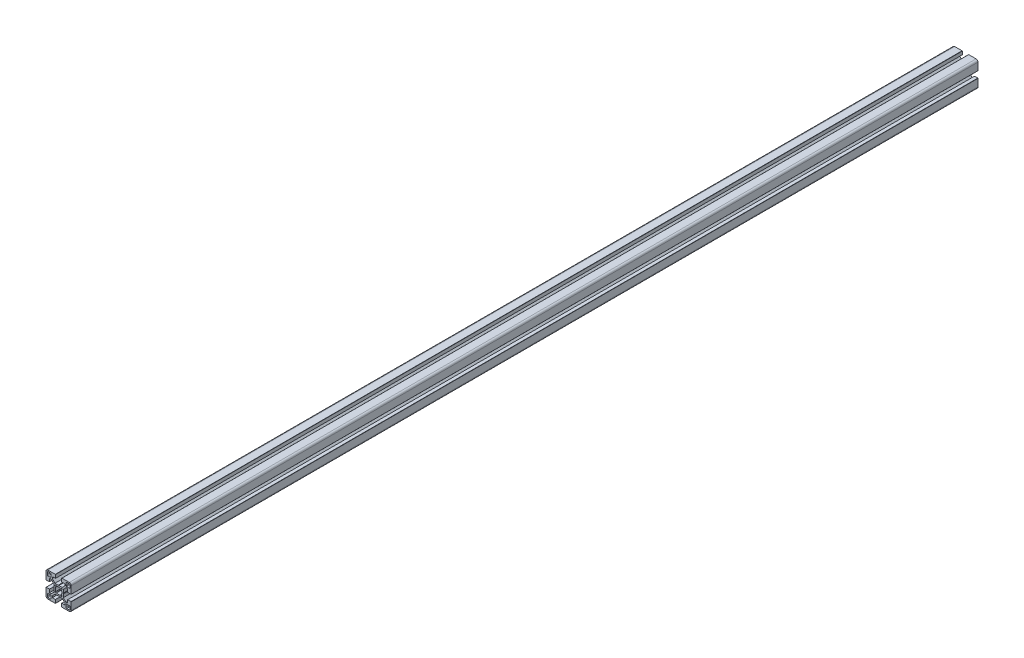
ISO-10303-21;
HEADER;
FILE_DESCRIPTION(('STEP AP214'),'2;1');
FILE_NAME('part.step','',(''),(''),'','','');
FILE_SCHEMA(('AUTOMOTIVE_DESIGN { 1 0 10303 214 1 1 1 1 }'));
ENDSEC;
DATA;
#1=APPLICATION_CONTEXT('core data for automotive mechanical design processes');
#2=APPLICATION_PROTOCOL_DEFINITION('international standard','automotive_design',2000,#1);
#3=PRODUCT_CONTEXT('',#1,'mechanical');
#4=PRODUCT('Part','Part','',(#3));
#5=PRODUCT_RELATED_PRODUCT_CATEGORY('part','',(#4));
#6=PRODUCT_DEFINITION_FORMATION('','',#4);
#7=PRODUCT_DEFINITION_CONTEXT('part definition',#1,'design');
#8=PRODUCT_DEFINITION('design','',#6,#7);
#9=PRODUCT_DEFINITION_SHAPE('','',#8);
#10=(LENGTH_UNIT() NAMED_UNIT(*) SI_UNIT(.MILLI.,.METRE.));
#11=(NAMED_UNIT(*) PLANE_ANGLE_UNIT() SI_UNIT($,.RADIAN.));
#12=(NAMED_UNIT(*) SI_UNIT($,.STERADIAN.) SOLID_ANGLE_UNIT());
#13=UNCERTAINTY_MEASURE_WITH_UNIT(LENGTH_MEASURE(1.E-05),#10,'distance_accuracy_value','');
#14=(GEOMETRIC_REPRESENTATION_CONTEXT(3) GLOBAL_UNCERTAINTY_ASSIGNED_CONTEXT((#13)) GLOBAL_UNIT_ASSIGNED_CONTEXT((#10,
#11,#12)) REPRESENTATION_CONTEXT('',''));
#15=CARTESIAN_POINT('',(0.,0.,0.));
#16=DIRECTION('',(0.,0.,1.));
#17=DIRECTION('',(1.,0.,0.));
#18=AXIS2_PLACEMENT_3D('',#15,#16,#17);
#19=CARTESIAN_POINT('',(-17.,17.,-1440.));
#20=DIRECTION('',(0.,0.,1.));
#21=DIRECTION('',(1.,0.,0.));
#22=AXIS2_PLACEMENT_3D('',#19,#20,#21);
#23=CYLINDRICAL_SURFACE('',#22,3.);
#24=CARTESIAN_POINT('',(-17.,17.,0.));
#25=DIRECTION('',(0.,0.,1.));
#26=DIRECTION('',(1.,0.,0.));
#27=AXIS2_PLACEMENT_3D('',#24,#25,#26);
#28=CIRCLE('',#27,3.);
#29=CARTESIAN_POINT('',(-17.,20.,0.));
#30=VERTEX_POINT('',#29);
#31=CARTESIAN_POINT('',(-20.,17.,0.));
#32=VERTEX_POINT('',#31);
#33=EDGE_CURVE('E1103',#30,#32,#28,.T.);
#34=ORIENTED_EDGE('',*,*,#33,.F.);
#35=DIRECTION('',(0.,0.,1.));
#36=VECTOR('',#35,1.);
#37=CARTESIAN_POINT('',(-17.,20.,-1440.));
#38=LINE('',#37,#36);
#39=CARTESIAN_POINT('',(-17.,20.,-1440.));
#40=VERTEX_POINT('',#39);
#41=EDGE_CURVE('E11',#40,#30,#38,.T.);
#42=ORIENTED_EDGE('',*,*,#41,.F.);
#43=CARTESIAN_POINT('',(-17.,17.,-1440.));
#44=DIRECTION('',(0.,0.,1.));
#45=DIRECTION('',(1.,0.,0.));
#46=AXIS2_PLACEMENT_3D('',#43,#44,#45);
#47=CIRCLE('',#46,3.);
#48=CARTESIAN_POINT('',(-20.,17.,-1440.));
#49=VERTEX_POINT('',#48);
#50=EDGE_CURVE('E1118',#40,#49,#47,.T.);
#51=ORIENTED_EDGE('',*,*,#50,.T.);
#52=DIRECTION('',(0.,0.,1.));
#53=VECTOR('',#52,1.);
#54=CARTESIAN_POINT('',(-20.,17.,-1440.));
#55=LINE('',#54,#53);
#56=EDGE_CURVE('E19',#49,#32,#55,.T.);
#57=ORIENTED_EDGE('',*,*,#56,.T.);
#58=EDGE_LOOP('',(#34,#42,#51,#57));
#59=FACE_BOUND('',#58,.T.);
#60=ADVANCED_FACE('F16',(#59),#23,.T.);
#61=CARTESIAN_POINT('',(-5.30000000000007,20.,-1440.));
#62=DIRECTION('',(0.,1.,0.));
#63=DIRECTION('',(0.,0.,1.));
#64=AXIS2_PLACEMENT_3D('',#61,#62,#63);
#65=PLANE('',#64);
#66=DIRECTION('',(-1.,0.,0.));
#67=VECTOR('',#66,1.);
#68=CARTESIAN_POINT('',(-5.30000000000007,20.,0.));
#69=LINE('',#68,#67);
#70=CARTESIAN_POINT('',(-5.30000000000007,20.,0.));
#71=VERTEX_POINT('',#70);
#72=EDGE_CURVE('E1122',#71,#30,#69,.T.);
#73=ORIENTED_EDGE('',*,*,#72,.F.);
#74=DIRECTION('',(0.,0.,1.));
#75=VECTOR('',#74,1.);
#76=CARTESIAN_POINT('',(-5.30000000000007,20.,-1440.));
#77=LINE('',#76,#75);
#78=CARTESIAN_POINT('',(-5.30000000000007,20.,-1440.));
#79=VERTEX_POINT('',#78);
#80=EDGE_CURVE('E24',#79,#71,#77,.T.);
#81=ORIENTED_EDGE('',*,*,#80,.F.);
#82=DIRECTION('',(-1.,0.,0.));
#83=VECTOR('',#82,1.);
#84=CARTESIAN_POINT('',(-5.30000000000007,20.,-1440.));
#85=LINE('',#84,#83);
#86=EDGE_CURVE('E1320',#79,#40,#85,.T.);
#87=ORIENTED_EDGE('',*,*,#86,.T.);
#88=ORIENTED_EDGE('',*,*,#41,.T.);
#89=EDGE_LOOP('',(#73,#81,#87,#88));
#90=FACE_BOUND('',#89,.T.);
#91=ADVANCED_FACE('F1667',(#90),#65,.T.);
#92=CARTESIAN_POINT('',(-5.30000000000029,19.6999999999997,-1440.));
#93=DIRECTION('',(0.,0.,1.));
#94=DIRECTION('',(1.,0.,0.));
#95=AXIS2_PLACEMENT_3D('',#92,#93,#94);
#96=CYLINDRICAL_SURFACE('',#95,0.300000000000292);
#97=CARTESIAN_POINT('',(-5.30000000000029,19.6999999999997,0.));
#98=DIRECTION('',(0.,0.,1.));
#99=DIRECTION('',(1.,0.,0.));
#100=AXIS2_PLACEMENT_3D('',#97,#98,#99);
#101=CIRCLE('',#100,0.300000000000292);
#102=CARTESIAN_POINT('',(-5.,19.7,0.));
#103=VERTEX_POINT('',#102);
#104=EDGE_CURVE('E1520',#103,#71,#101,.T.);
#105=ORIENTED_EDGE('',*,*,#104,.F.);
#106=DIRECTION('',(0.,0.,1.));
#107=VECTOR('',#106,1.);
#108=CARTESIAN_POINT('',(-5.,19.7,-1440.));
#109=LINE('',#108,#107);
#110=CARTESIAN_POINT('',(-5.,19.7,-1440.));
#111=VERTEX_POINT('',#110);
#112=EDGE_CURVE('E1526',#111,#103,#109,.T.);
#113=ORIENTED_EDGE('',*,*,#112,.F.);
#114=CARTESIAN_POINT('',(-5.30000000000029,19.6999999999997,-1440.));
#115=DIRECTION('',(0.,0.,1.));
#116=DIRECTION('',(1.,0.,0.));
#117=AXIS2_PLACEMENT_3D('',#114,#115,#116);
#118=CIRCLE('',#117,0.300000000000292);
#119=EDGE_CURVE('E1317',#111,#79,#118,.T.);
#120=ORIENTED_EDGE('',*,*,#119,.T.);
#121=ORIENTED_EDGE('',*,*,#80,.T.);
#122=EDGE_LOOP('',(#105,#113,#120,#121));
#123=FACE_BOUND('',#122,.T.);
#124=ADVANCED_FACE('F1927',(#123),#96,.T.);
#125=CARTESIAN_POINT('',(-5.,14.5,-1440.));
#126=DIRECTION('',(1.,0.,0.));
#127=DIRECTION('',(0.,0.,-1.));
#128=AXIS2_PLACEMENT_3D('',#125,#126,#127);
#129=PLANE('',#128);
#130=DIRECTION('',(0.,1.,0.));
#131=VECTOR('',#130,1.);
#132=CARTESIAN_POINT('',(-5.,14.5,0.));
#133=LINE('',#132,#131);
#134=CARTESIAN_POINT('',(-5.,14.5,0.));
#135=VERTEX_POINT('',#134);
#136=EDGE_CURVE('E1517',#135,#103,#133,.T.);
#137=ORIENTED_EDGE('',*,*,#136,.F.);
#138=DIRECTION('',(0.,0.,1.));
#139=VECTOR('',#138,1.);
#140=CARTESIAN_POINT('',(-5.,14.5,-1440.));
#141=LINE('',#140,#139);
#142=CARTESIAN_POINT('',(-5.,14.5,-1440.));
#143=VERTEX_POINT('',#142);
#144=EDGE_CURVE('E1528',#143,#135,#141,.T.);
#145=ORIENTED_EDGE('',*,*,#144,.F.);
#146=DIRECTION('',(0.,1.,0.));
#147=VECTOR('',#146,1.);
#148=CARTESIAN_POINT('',(-5.,14.5,-1440.));
#149=LINE('',#148,#147);
#150=EDGE_CURVE('E1314',#143,#111,#149,.T.);
#151=ORIENTED_EDGE('',*,*,#150,.T.);
#152=ORIENTED_EDGE('',*,*,#112,.T.);
#153=EDGE_LOOP('',(#137,#145,#151,#152));
#154=FACE_BOUND('',#153,.T.);
#155=ADVANCED_FACE('F1925',(#154),#129,.T.);
#156=CARTESIAN_POINT('',(-10.,14.5,-1440.));
#157=DIRECTION('',(0.,-1.,0.));
#158=DIRECTION('',(0.,0.,-1.));
#159=AXIS2_PLACEMENT_3D('',#156,#157,#158);
#160=PLANE('',#159);
#161=DIRECTION('',(1.,0.,0.));
#162=VECTOR('',#161,1.);
#163=CARTESIAN_POINT('',(-10.,14.5,0.));
#164=LINE('',#163,#162);
#165=CARTESIAN_POINT('',(-10.,14.5,0.));
#166=VERTEX_POINT('',#165);
#167=EDGE_CURVE('E1514',#166,#135,#164,.T.);
#168=ORIENTED_EDGE('',*,*,#167,.F.);
#169=DIRECTION('',(0.,0.,1.));
#170=VECTOR('',#169,1.);
#171=CARTESIAN_POINT('',(-10.,14.5,-1440.));
#172=LINE('',#171,#170);
#173=CARTESIAN_POINT('',(-10.,14.5,-1440.));
#174=VERTEX_POINT('',#173);
#175=EDGE_CURVE('E1530',#174,#166,#172,.T.);
#176=ORIENTED_EDGE('',*,*,#175,.F.);
#177=DIRECTION('',(1.,0.,0.));
#178=VECTOR('',#177,1.);
#179=CARTESIAN_POINT('',(-10.,14.5,-1440.));
#180=LINE('',#179,#178);
#181=EDGE_CURVE('E1311',#174,#143,#180,.T.);
#182=ORIENTED_EDGE('',*,*,#181,.T.);
#183=ORIENTED_EDGE('',*,*,#144,.T.);
#184=EDGE_LOOP('',(#168,#176,#182,#183));
#185=FACE_BOUND('',#184,.T.);
#186=ADVANCED_FACE('F1921',(#185),#160,.T.);
#187=CARTESIAN_POINT('',(-10.,11.7677860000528,-1440.));
#188=DIRECTION('',(1.,0.,0.));
#189=DIRECTION('',(0.,0.,-1.));
#190=AXIS2_PLACEMENT_3D('',#187,#188,#189);
#191=PLANE('',#190);
#192=DIRECTION('',(0.,1.,0.));
#193=VECTOR('',#192,1.);
#194=CARTESIAN_POINT('',(-10.,11.7677860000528,0.));
#195=LINE('',#194,#193);
#196=CARTESIAN_POINT('',(-10.,11.7677860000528,0.));
#197=VERTEX_POINT('',#196);
#198=EDGE_CURVE('E1511',#197,#166,#195,.T.);
#199=ORIENTED_EDGE('',*,*,#198,.F.);
#200=DIRECTION('',(0.,0.,1.));
#201=VECTOR('',#200,1.);
#202=CARTESIAN_POINT('',(-10.,11.7677860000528,-1440.));
#203=LINE('',#202,#201);
#204=CARTESIAN_POINT('',(-10.,11.7677860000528,-1440.));
#205=VERTEX_POINT('',#204);
#206=EDGE_CURVE('E1532',#205,#197,#203,.T.);
#207=ORIENTED_EDGE('',*,*,#206,.F.);
#208=DIRECTION('',(0.,1.,0.));
#209=VECTOR('',#208,1.);
#210=CARTESIAN_POINT('',(-10.,11.7677860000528,-1440.));
#211=LINE('',#210,#209);
#212=EDGE_CURVE('E1308',#205,#174,#211,.T.);
#213=ORIENTED_EDGE('',*,*,#212,.T.);
#214=ORIENTED_EDGE('',*,*,#175,.T.);
#215=EDGE_LOOP('',(#199,#207,#213,#214));
#216=FACE_BOUND('',#215,.T.);
#217=ADVANCED_FACE('F1917',(#216),#191,.T.);
#218=CARTESIAN_POINT('',(-5.73222900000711,7.5,-1440.));
#219=DIRECTION('',(0.707108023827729,0.707105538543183,0.));
#220=DIRECTION('',(-0.707105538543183,0.707108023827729,0.));
#221=AXIS2_PLACEMENT_3D('',#218,#219,#220);
#222=PLANE('',#221);
#223=DIRECTION('',(-0.707105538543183,0.707108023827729,0.));
#224=VECTOR('',#223,1.);
#225=CARTESIAN_POINT('',(-5.73222900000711,7.5,0.));
#226=LINE('',#225,#224);
#227=CARTESIAN_POINT('',(-5.73222900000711,7.5,0.));
#228=VERTEX_POINT('',#227);
#229=EDGE_CURVE('E1508',#228,#197,#226,.T.);
#230=ORIENTED_EDGE('',*,*,#229,.F.);
#231=DIRECTION('',(0.,0.,1.));
#232=VECTOR('',#231,1.);
#233=CARTESIAN_POINT('',(-5.73222900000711,7.5,-1440.));
#234=LINE('',#233,#232);
#235=CARTESIAN_POINT('',(-5.73222900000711,7.5,-1440.));
#236=VERTEX_POINT('',#235);
#237=EDGE_CURVE('E1534',#236,#228,#234,.T.);
#238=ORIENTED_EDGE('',*,*,#237,.F.);
#239=DIRECTION('',(-0.707105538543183,0.707108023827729,0.));
#240=VECTOR('',#239,1.);
#241=CARTESIAN_POINT('',(-5.73222900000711,7.5,-1440.));
#242=LINE('',#241,#240);
#243=EDGE_CURVE('E1305',#236,#205,#242,.T.);
#244=ORIENTED_EDGE('',*,*,#243,.T.);
#245=ORIENTED_EDGE('',*,*,#206,.T.);
#246=EDGE_LOOP('',(#230,#238,#244,#245));
#247=FACE_BOUND('',#246,.T.);
#248=ADVANCED_FACE('F1913',(#247),#222,.T.);
#249=CARTESIAN_POINT('',(-0.519615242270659,7.5,-1440.));
#250=DIRECTION('',(0.,1.,0.));
#251=DIRECTION('',(-1.,0.,0.));
#252=AXIS2_PLACEMENT_3D('',#249,#250,#251);
#253=PLANE('',#252);
#254=DIRECTION('',(-1.,0.,0.));
#255=VECTOR('',#254,1.);
#256=CARTESIAN_POINT('',(-0.519615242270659,7.5,0.));
#257=LINE('',#256,#255);
#258=CARTESIAN_POINT('',(-0.519615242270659,7.5,0.));
#259=VERTEX_POINT('',#258);
#260=EDGE_CURVE('E1505',#259,#228,#257,.T.);
#261=ORIENTED_EDGE('',*,*,#260,.F.);
#262=DIRECTION('',(0.,0.,1.));
#263=VECTOR('',#262,1.);
#264=CARTESIAN_POINT('',(-0.519615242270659,7.5,-1440.));
#265=LINE('',#264,#263);
#266=CARTESIAN_POINT('',(-0.519615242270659,7.5,-1440.));
#267=VERTEX_POINT('',#266);
#268=EDGE_CURVE('E1536',#267,#259,#265,.T.);
#269=ORIENTED_EDGE('',*,*,#268,.F.);
#270=DIRECTION('',(-1.,0.,0.));
#271=VECTOR('',#270,1.);
#272=CARTESIAN_POINT('',(-0.519615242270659,7.5,-1440.));
#273=LINE('',#272,#271);
#274=EDGE_CURVE('E1302',#267,#236,#273,.T.);
#275=ORIENTED_EDGE('',*,*,#274,.T.);
#276=ORIENTED_EDGE('',*,*,#237,.T.);
#277=EDGE_LOOP('',(#261,#269,#275,#276));
#278=FACE_BOUND('',#277,.T.);
#279=ADVANCED_FACE('F1909',(#278),#253,.T.);
#280=CARTESIAN_POINT('',(0.,7.2,-1440.));
#281=DIRECTION('',(0.499999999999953,0.866025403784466,0.));
#282=DIRECTION('',(-0.866025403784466,0.499999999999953,0.));
#283=AXIS2_PLACEMENT_3D('',#280,#281,#282);
#284=PLANE('',#283);
#285=DIRECTION('',(-0.866025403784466,0.499999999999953,0.));
#286=VECTOR('',#285,1.);
#287=CARTESIAN_POINT('',(0.,7.2,0.));
#288=LINE('',#287,#286);
#289=CARTESIAN_POINT('',(0.,7.2,0.));
#290=VERTEX_POINT('',#289);
#291=EDGE_CURVE('E1502',#290,#259,#288,.T.);
#292=ORIENTED_EDGE('',*,*,#291,.F.);
#293=DIRECTION('',(0.,0.,1.));
#294=VECTOR('',#293,1.);
#295=CARTESIAN_POINT('',(0.,7.2,-1440.));
#296=LINE('',#295,#294);
#297=CARTESIAN_POINT('',(0.,7.2,-1440.));
#298=VERTEX_POINT('',#297);
#299=EDGE_CURVE('E1538',#298,#290,#296,.T.);
#300=ORIENTED_EDGE('',*,*,#299,.F.);
#301=DIRECTION('',(-0.866025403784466,0.499999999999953,0.));
#302=VECTOR('',#301,1.);
#303=CARTESIAN_POINT('',(0.,7.2,-1440.));
#304=LINE('',#303,#302);
#305=EDGE_CURVE('E1299',#298,#267,#304,.T.);
#306=ORIENTED_EDGE('',*,*,#305,.T.);
#307=ORIENTED_EDGE('',*,*,#268,.T.);
#308=EDGE_LOOP('',(#292,#300,#306,#307));
#309=FACE_BOUND('',#308,.T.);
#310=ADVANCED_FACE('F1905',(#309),#284,.T.);
#311=CARTESIAN_POINT('',(0.51961524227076,7.5,-1440.));
#312=DIRECTION('',(-0.499999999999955,0.866025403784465,0.));
#313=DIRECTION('',(-0.866025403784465,-0.499999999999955,0.));
#314=AXIS2_PLACEMENT_3D('',#311,#312,#313);
#315=PLANE('',#314);
#316=DIRECTION('',(-0.866025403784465,-0.499999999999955,0.));
#317=VECTOR('',#316,1.);
#318=CARTESIAN_POINT('',(0.51961524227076,7.5,0.));
#319=LINE('',#318,#317);
#320=CARTESIAN_POINT('',(0.51961524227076,7.5,0.));
#321=VERTEX_POINT('',#320);
#322=EDGE_CURVE('E1499',#321,#290,#319,.T.);
#323=ORIENTED_EDGE('',*,*,#322,.F.);
#324=DIRECTION('',(0.,0.,1.));
#325=VECTOR('',#324,1.);
#326=CARTESIAN_POINT('',(0.51961524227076,7.5,-1440.));
#327=LINE('',#326,#325);
#328=CARTESIAN_POINT('',(0.51961524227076,7.5,-1440.));
#329=VERTEX_POINT('',#328);
#330=EDGE_CURVE('E1540',#329,#321,#327,.T.);
#331=ORIENTED_EDGE('',*,*,#330,.F.);
#332=DIRECTION('',(-0.866025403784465,-0.499999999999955,0.));
#333=VECTOR('',#332,1.);
#334=CARTESIAN_POINT('',(0.51961524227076,7.5,-1440.));
#335=LINE('',#334,#333);
#336=EDGE_CURVE('E1296',#329,#298,#335,.T.);
#337=ORIENTED_EDGE('',*,*,#336,.T.);
#338=ORIENTED_EDGE('',*,*,#299,.T.);
#339=EDGE_LOOP('',(#323,#331,#337,#338));
#340=FACE_BOUND('',#339,.T.);
#341=ADVANCED_FACE('F1901',(#340),#315,.T.);
#342=CARTESIAN_POINT('',(5.73223699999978,7.5,-1440.));
#343=DIRECTION('',(0.,1.,0.));
#344=DIRECTION('',(-1.,0.,0.));
#345=AXIS2_PLACEMENT_3D('',#342,#343,#344);
#346=PLANE('',#345);
#347=DIRECTION('',(-1.,0.,0.));
#348=VECTOR('',#347,1.);
#349=CARTESIAN_POINT('',(5.73223699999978,7.5,0.));
#350=LINE('',#349,#348);
#351=CARTESIAN_POINT('',(5.73223699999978,7.5,0.));
#352=VERTEX_POINT('',#351);
#353=EDGE_CURVE('E1496',#352,#321,#350,.T.);
#354=ORIENTED_EDGE('',*,*,#353,.F.);
#355=DIRECTION('',(0.,0.,1.));
#356=VECTOR('',#355,1.);
#357=CARTESIAN_POINT('',(5.73223699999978,7.5,-1440.));
#358=LINE('',#357,#356);
#359=CARTESIAN_POINT('',(5.73223699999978,7.5,-1440.));
#360=VERTEX_POINT('',#359);
#361=EDGE_CURVE('E1542',#360,#352,#358,.T.);
#362=ORIENTED_EDGE('',*,*,#361,.F.);
#363=DIRECTION('',(-1.,0.,0.));
#364=VECTOR('',#363,1.);
#365=CARTESIAN_POINT('',(5.73223699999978,7.5,-1440.));
#366=LINE('',#365,#364);
#367=EDGE_CURVE('E1293',#360,#329,#366,.T.);
#368=ORIENTED_EDGE('',*,*,#367,.T.);
#369=ORIENTED_EDGE('',*,*,#330,.T.);
#370=EDGE_LOOP('',(#354,#362,#368,#369));
#371=FACE_BOUND('',#370,.T.);
#372=ADVANCED_FACE('F1897',(#371),#346,.T.);
#373=CARTESIAN_POINT('',(9.99999999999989,11.7677629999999,-1440.));
#374=DIRECTION('',(-0.707106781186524,0.707106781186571,0.));
#375=DIRECTION('',(-0.707106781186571,-0.707106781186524,0.));
#376=AXIS2_PLACEMENT_3D('',#373,#374,#375);
#377=PLANE('',#376);
#378=DIRECTION('',(-0.707106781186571,-0.707106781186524,0.));
#379=VECTOR('',#378,1.);
#380=CARTESIAN_POINT('',(9.99999999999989,11.7677629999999,0.));
#381=LINE('',#380,#379);
#382=CARTESIAN_POINT('',(9.99999999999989,11.7677629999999,0.));
#383=VERTEX_POINT('',#382);
#384=EDGE_CURVE('E1493',#383,#352,#381,.T.);
#385=ORIENTED_EDGE('',*,*,#384,.F.);
#386=DIRECTION('',(0.,0.,1.));
#387=VECTOR('',#386,1.);
#388=CARTESIAN_POINT('',(9.99999999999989,11.7677629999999,-1440.));
#389=LINE('',#388,#387);
#390=CARTESIAN_POINT('',(9.99999999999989,11.7677629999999,-1440.));
#391=VERTEX_POINT('',#390);
#392=EDGE_CURVE('E1544',#391,#383,#389,.T.);
#393=ORIENTED_EDGE('',*,*,#392,.F.);
#394=DIRECTION('',(-0.707106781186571,-0.707106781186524,0.));
#395=VECTOR('',#394,1.);
#396=CARTESIAN_POINT('',(9.99999999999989,11.7677629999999,-1440.));
#397=LINE('',#396,#395);
#398=EDGE_CURVE('E1290',#391,#360,#397,.T.);
#399=ORIENTED_EDGE('',*,*,#398,.T.);
#400=ORIENTED_EDGE('',*,*,#361,.T.);
#401=EDGE_LOOP('',(#385,#393,#399,#400));
#402=FACE_BOUND('',#401,.T.);
#403=ADVANCED_FACE('F1893',(#402),#377,.T.);
#404=CARTESIAN_POINT('',(9.99999999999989,14.5,-1440.));
#405=DIRECTION('',(-1.,0.,0.));
#406=DIRECTION('',(0.,0.,1.));
#407=AXIS2_PLACEMENT_3D('',#404,#405,#406);
#408=PLANE('',#407);
#409=DIRECTION('',(0.,-1.,0.));
#410=VECTOR('',#409,1.);
#411=CARTESIAN_POINT('',(9.99999999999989,14.5,0.));
#412=LINE('',#411,#410);
#413=CARTESIAN_POINT('',(9.99999999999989,14.5,0.));
#414=VERTEX_POINT('',#413);
#415=EDGE_CURVE('E1490',#414,#383,#412,.T.);
#416=ORIENTED_EDGE('',*,*,#415,.F.);
#417=DIRECTION('',(0.,0.,1.));
#418=VECTOR('',#417,1.);
#419=CARTESIAN_POINT('',(9.99999999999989,14.5,-1440.));
#420=LINE('',#419,#418);
#421=CARTESIAN_POINT('',(9.99999999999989,14.5,-1440.));
#422=VERTEX_POINT('',#421);
#423=EDGE_CURVE('E1546',#422,#414,#420,.T.);
#424=ORIENTED_EDGE('',*,*,#423,.F.);
#425=DIRECTION('',(0.,-1.,0.));
#426=VECTOR('',#425,1.);
#427=CARTESIAN_POINT('',(9.99999999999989,14.5,-1440.));
#428=LINE('',#427,#426);
#429=EDGE_CURVE('E1287',#422,#391,#428,.T.);
#430=ORIENTED_EDGE('',*,*,#429,.T.);
#431=ORIENTED_EDGE('',*,*,#392,.T.);
#432=EDGE_LOOP('',(#416,#424,#430,#431));
#433=FACE_BOUND('',#432,.T.);
#434=ADVANCED_FACE('F1889',(#433),#408,.T.);
#435=CARTESIAN_POINT('',(5.,14.5,-1440.));
#436=DIRECTION('',(0.,-1.,0.));
#437=DIRECTION('',(0.,0.,-1.));
#438=AXIS2_PLACEMENT_3D('',#435,#436,#437);
#439=PLANE('',#438);
#440=DIRECTION('',(1.,0.,0.));
#441=VECTOR('',#440,1.);
#442=CARTESIAN_POINT('',(5.,14.5,0.));
#443=LINE('',#442,#441);
#444=CARTESIAN_POINT('',(5.,14.5,0.));
#445=VERTEX_POINT('',#444);
#446=EDGE_CURVE('E1487',#445,#414,#443,.T.);
#447=ORIENTED_EDGE('',*,*,#446,.F.);
#448=DIRECTION('',(0.,0.,1.));
#449=VECTOR('',#448,1.);
#450=CARTESIAN_POINT('',(5.,14.5,-1440.));
#451=LINE('',#450,#449);
#452=CARTESIAN_POINT('',(5.,14.5,-1440.));
#453=VERTEX_POINT('',#452);
#454=EDGE_CURVE('E1548',#453,#445,#451,.T.);
#455=ORIENTED_EDGE('',*,*,#454,.F.);
#456=DIRECTION('',(1.,0.,0.));
#457=VECTOR('',#456,1.);
#458=CARTESIAN_POINT('',(5.,14.5,-1440.));
#459=LINE('',#458,#457);
#460=EDGE_CURVE('E1284',#453,#422,#459,.T.);
#461=ORIENTED_EDGE('',*,*,#460,.T.);
#462=ORIENTED_EDGE('',*,*,#423,.T.);
#463=EDGE_LOOP('',(#447,#455,#461,#462));
#464=FACE_BOUND('',#463,.T.);
#465=ADVANCED_FACE('F1885',(#464),#439,.T.);
#466=CARTESIAN_POINT('',(5.,19.7,-1440.));
#467=DIRECTION('',(-1.,0.,0.));
#468=DIRECTION('',(0.,0.,1.));
#469=AXIS2_PLACEMENT_3D('',#466,#467,#468);
#470=PLANE('',#469);
#471=DIRECTION('',(0.,-1.,0.));
#472=VECTOR('',#471,1.);
#473=CARTESIAN_POINT('',(5.,19.7,0.));
#474=LINE('',#473,#472);
#475=CARTESIAN_POINT('',(5.,19.7,0.));
#476=VERTEX_POINT('',#475);
#477=EDGE_CURVE('E1484',#476,#445,#474,.T.);
#478=ORIENTED_EDGE('',*,*,#477,.F.);
#479=DIRECTION('',(0.,0.,1.));
#480=VECTOR('',#479,1.);
#481=CARTESIAN_POINT('',(5.,19.7,-1440.));
#482=LINE('',#481,#480);
#483=CARTESIAN_POINT('',(5.,19.7,-1440.));
#484=VERTEX_POINT('',#483);
#485=EDGE_CURVE('E1550',#484,#476,#482,.T.);
#486=ORIENTED_EDGE('',*,*,#485,.F.);
#487=DIRECTION('',(0.,-1.,0.));
#488=VECTOR('',#487,1.);
#489=CARTESIAN_POINT('',(5.,19.7,-1440.));
#490=LINE('',#489,#488);
#491=EDGE_CURVE('E1281',#484,#453,#490,.T.);
#492=ORIENTED_EDGE('',*,*,#491,.T.);
#493=ORIENTED_EDGE('',*,*,#454,.T.);
#494=EDGE_LOOP('',(#478,#486,#492,#493));
#495=FACE_BOUND('',#494,.T.);
#496=ADVANCED_FACE('F1881',(#495),#470,.T.);
#497=CARTESIAN_POINT('',(5.30000000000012,19.7,-1440.));
#498=DIRECTION('',(0.,0.,1.));
#499=DIRECTION('',(1.,0.,0.));
#500=AXIS2_PLACEMENT_3D('',#497,#498,#499);
#501=CYLINDRICAL_SURFACE('',#500,0.300000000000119);
#502=CARTESIAN_POINT('',(5.30000000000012,19.7,0.));
#503=DIRECTION('',(0.,0.,1.));
#504=DIRECTION('',(1.,0.,0.));
#505=AXIS2_PLACEMENT_3D('',#502,#503,#504);
#506=CIRCLE('',#505,0.300000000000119);
#507=CARTESIAN_POINT('',(5.3,20.,0.));
#508=VERTEX_POINT('',#507);
#509=EDGE_CURVE('E1481',#508,#476,#506,.T.);
#510=ORIENTED_EDGE('',*,*,#509,.F.);
#511=DIRECTION('',(0.,0.,1.));
#512=VECTOR('',#511,1.);
#513=CARTESIAN_POINT('',(5.3,20.,-1440.));
#514=LINE('',#513,#512);
#515=CARTESIAN_POINT('',(5.3,20.,-1440.));
#516=VERTEX_POINT('',#515);
#517=EDGE_CURVE('E1552',#516,#508,#514,.T.);
#518=ORIENTED_EDGE('',*,*,#517,.F.);
#519=CARTESIAN_POINT('',(5.30000000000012,19.7,-1440.));
#520=DIRECTION('',(0.,0.,1.));
#521=DIRECTION('',(1.,0.,0.));
#522=AXIS2_PLACEMENT_3D('',#519,#520,#521);
#523=CIRCLE('',#522,0.300000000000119);
#524=EDGE_CURVE('E1278',#516,#484,#523,.T.);
#525=ORIENTED_EDGE('',*,*,#524,.T.);
#526=ORIENTED_EDGE('',*,*,#485,.T.);
#527=EDGE_LOOP('',(#510,#518,#525,#526));
#528=FACE_BOUND('',#527,.T.);
#529=ADVANCED_FACE('F1877',(#528),#501,.T.);
#530=CARTESIAN_POINT('',(17.,20.,-1440.));
#531=DIRECTION('',(0.,1.,0.));
#532=DIRECTION('',(0.,0.,1.));
#533=AXIS2_PLACEMENT_3D('',#530,#531,#532);
#534=PLANE('',#533);
#535=DIRECTION('',(-1.,0.,0.));
#536=VECTOR('',#535,1.);
#537=CARTESIAN_POINT('',(17.,20.,0.));
#538=LINE('',#537,#536);
#539=CARTESIAN_POINT('',(17.,20.,0.));
#540=VERTEX_POINT('',#539);
#541=EDGE_CURVE('E1478',#540,#508,#538,.T.);
#542=ORIENTED_EDGE('',*,*,#541,.F.);
#543=DIRECTION('',(0.,0.,1.));
#544=VECTOR('',#543,1.);
#545=CARTESIAN_POINT('',(17.,20.,-1440.));
#546=LINE('',#545,#544);
#547=CARTESIAN_POINT('',(17.,20.,-1440.));
#548=VERTEX_POINT('',#547);
#549=EDGE_CURVE('E1554',#548,#540,#546,.T.);
#550=ORIENTED_EDGE('',*,*,#549,.F.);
#551=DIRECTION('',(-1.,0.,0.));
#552=VECTOR('',#551,1.);
#553=CARTESIAN_POINT('',(17.,20.,-1440.));
#554=LINE('',#553,#552);
#555=EDGE_CURVE('E1275',#548,#516,#554,.T.);
#556=ORIENTED_EDGE('',*,*,#555,.T.);
#557=ORIENTED_EDGE('',*,*,#517,.T.);
#558=EDGE_LOOP('',(#542,#550,#556,#557));
#559=FACE_BOUND('',#558,.T.);
#560=ADVANCED_FACE('F1873',(#559),#534,.T.);
#561=CARTESIAN_POINT('',(17.,17.,-1440.));
#562=DIRECTION('',(0.,0.,1.));
#563=DIRECTION('',(1.,0.,0.));
#564=AXIS2_PLACEMENT_3D('',#561,#562,#563);
#565=CYLINDRICAL_SURFACE('',#564,2.99999999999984);
#566=CARTESIAN_POINT('',(17.,17.,0.));
#567=DIRECTION('',(0.,0.,1.));
#568=DIRECTION('',(1.,0.,0.));
#569=AXIS2_PLACEMENT_3D('',#566,#567,#568);
#570=CIRCLE('',#569,2.99999999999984);
#571=CARTESIAN_POINT('',(20.,17.,0.));
#572=VERTEX_POINT('',#571);
#573=EDGE_CURVE('E1475',#572,#540,#570,.T.);
#574=ORIENTED_EDGE('',*,*,#573,.F.);
#575=DIRECTION('',(0.,0.,1.));
#576=VECTOR('',#575,1.);
#577=CARTESIAN_POINT('',(20.,17.,-1440.));
#578=LINE('',#577,#576);
#579=CARTESIAN_POINT('',(20.,17.,-1440.));
#580=VERTEX_POINT('',#579);
#581=EDGE_CURVE('E1556',#580,#572,#578,.T.);
#582=ORIENTED_EDGE('',*,*,#581,.F.);
#583=CARTESIAN_POINT('',(17.,17.,-1440.));
#584=DIRECTION('',(0.,0.,1.));
#585=DIRECTION('',(1.,0.,0.));
#586=AXIS2_PLACEMENT_3D('',#583,#584,#585);
#587=CIRCLE('',#586,2.99999999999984);
#588=EDGE_CURVE('E1272',#580,#548,#587,.T.);
#589=ORIENTED_EDGE('',*,*,#588,.T.);
#590=ORIENTED_EDGE('',*,*,#549,.T.);
#591=EDGE_LOOP('',(#574,#582,#589,#590));
#592=FACE_BOUND('',#591,.T.);
#593=ADVANCED_FACE('F1869',(#592),#565,.T.);
#594=CARTESIAN_POINT('',(20.,5.30000300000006,-1440.));
#595=DIRECTION('',(1.,0.,0.));
#596=DIRECTION('',(0.,0.,-1.));
#597=AXIS2_PLACEMENT_3D('',#594,#595,#596);
#598=PLANE('',#597);
#599=DIRECTION('',(0.,1.,0.));
#600=VECTOR('',#599,1.);
#601=CARTESIAN_POINT('',(20.,5.30000300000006,0.));
#602=LINE('',#601,#600);
#603=CARTESIAN_POINT('',(20.,5.30000300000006,0.));
#604=VERTEX_POINT('',#603);
#605=EDGE_CURVE('E1472',#604,#572,#602,.T.);
#606=ORIENTED_EDGE('',*,*,#605,.F.);
#607=DIRECTION('',(0.,0.,1.));
#608=VECTOR('',#607,1.);
#609=CARTESIAN_POINT('',(20.,5.30000300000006,-1440.));
#610=LINE('',#609,#608);
#611=CARTESIAN_POINT('',(20.,5.30000300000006,-1440.));
#612=VERTEX_POINT('',#611);
#613=EDGE_CURVE('E1558',#612,#604,#610,.T.);
#614=ORIENTED_EDGE('',*,*,#613,.F.);
#615=DIRECTION('',(0.,1.,0.));
#616=VECTOR('',#615,1.);
#617=CARTESIAN_POINT('',(20.,5.30000300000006,-1440.));
#618=LINE('',#617,#616);
#619=EDGE_CURVE('E1269',#612,#580,#618,.T.);
#620=ORIENTED_EDGE('',*,*,#619,.T.);
#621=ORIENTED_EDGE('',*,*,#581,.T.);
#622=EDGE_LOOP('',(#606,#614,#620,#621));
#623=FACE_BOUND('',#622,.T.);
#624=ADVANCED_FACE('F1865',(#623),#598,.T.);
#625=CARTESIAN_POINT('',(19.699989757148,5.30001024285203,-1440.));
#626=DIRECTION('',(0.,0.,1.));
#627=DIRECTION('',(1.,0.,0.));
#628=AXIS2_PLACEMENT_3D('',#625,#626,#627);
#629=CYLINDRICAL_SURFACE('',#628,0.300010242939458);
#630=CARTESIAN_POINT('',(19.699989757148,5.30001024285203,0.));
#631=DIRECTION('',(0.,0.,1.));
#632=DIRECTION('',(1.,0.,0.));
#633=AXIS2_PLACEMENT_3D('',#630,#631,#632);
#634=CIRCLE('',#633,0.300010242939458);
#635=CARTESIAN_POINT('',(19.6999969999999,5.,0.));
#636=VERTEX_POINT('',#635);
#637=EDGE_CURVE('E1469',#636,#604,#634,.T.);
#638=ORIENTED_EDGE('',*,*,#637,.F.);
#639=DIRECTION('',(0.,0.,1.));
#640=VECTOR('',#639,1.);
#641=CARTESIAN_POINT('',(19.6999969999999,5.,-1440.));
#642=LINE('',#641,#640);
#643=CARTESIAN_POINT('',(19.6999969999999,5.,-1440.));
#644=VERTEX_POINT('',#643);
#645=EDGE_CURVE('E1560',#644,#636,#642,.T.);
#646=ORIENTED_EDGE('',*,*,#645,.F.);
#647=CARTESIAN_POINT('',(19.699989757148,5.30001024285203,-1440.));
#648=DIRECTION('',(0.,0.,1.));
#649=DIRECTION('',(1.,0.,0.));
#650=AXIS2_PLACEMENT_3D('',#647,#648,#649);
#651=CIRCLE('',#650,0.300010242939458);
#652=EDGE_CURVE('E1266',#644,#612,#651,.T.);
#653=ORIENTED_EDGE('',*,*,#652,.T.);
#654=ORIENTED_EDGE('',*,*,#613,.T.);
#655=EDGE_LOOP('',(#638,#646,#653,#654));
#656=FACE_BOUND('',#655,.T.);
#657=ADVANCED_FACE('F1861',(#656),#629,.T.);
#658=CARTESIAN_POINT('',(14.5,5.,-1440.));
#659=DIRECTION('',(0.,-1.,0.));
#660=DIRECTION('',(0.,0.,-1.));
#661=AXIS2_PLACEMENT_3D('',#658,#659,#660);
#662=PLANE('',#661);
#663=DIRECTION('',(1.,0.,0.));
#664=VECTOR('',#663,1.);
#665=CARTESIAN_POINT('',(14.5,5.,0.));
#666=LINE('',#665,#664);
#667=CARTESIAN_POINT('',(14.5,5.,0.));
#668=VERTEX_POINT('',#667);
#669=EDGE_CURVE('E1466',#668,#636,#666,.T.);
#670=ORIENTED_EDGE('',*,*,#669,.F.);
#671=DIRECTION('',(0.,0.,1.));
#672=VECTOR('',#671,1.);
#673=CARTESIAN_POINT('',(14.5,5.,-1440.));
#674=LINE('',#673,#672);
#675=CARTESIAN_POINT('',(14.5,5.,-1440.));
#676=VERTEX_POINT('',#675);
#677=EDGE_CURVE('E1562',#676,#668,#674,.T.);
#678=ORIENTED_EDGE('',*,*,#677,.F.);
#679=DIRECTION('',(1.,0.,0.));
#680=VECTOR('',#679,1.);
#681=CARTESIAN_POINT('',(14.5,5.,-1440.));
#682=LINE('',#681,#680);
#683=EDGE_CURVE('E1263',#676,#644,#682,.T.);
#684=ORIENTED_EDGE('',*,*,#683,.T.);
#685=ORIENTED_EDGE('',*,*,#645,.T.);
#686=EDGE_LOOP('',(#670,#678,#684,#685));
#687=FACE_BOUND('',#686,.T.);
#688=ADVANCED_FACE('F1857',(#687),#662,.T.);
#689=CARTESIAN_POINT('',(14.5,10.,-1440.));
#690=DIRECTION('',(-1.,0.,0.));
#691=DIRECTION('',(0.,0.,1.));
#692=AXIS2_PLACEMENT_3D('',#689,#690,#691);
#693=PLANE('',#692);
#694=DIRECTION('',(0.,-1.,0.));
#695=VECTOR('',#694,1.);
#696=CARTESIAN_POINT('',(14.5,10.,0.));
#697=LINE('',#696,#695);
#698=CARTESIAN_POINT('',(14.5,10.,0.));
#699=VERTEX_POINT('',#698);
#700=EDGE_CURVE('E1463',#699,#668,#697,.T.);
#701=ORIENTED_EDGE('',*,*,#700,.F.);
#702=DIRECTION('',(0.,0.,1.));
#703=VECTOR('',#702,1.);
#704=CARTESIAN_POINT('',(14.5,10.,-1440.));
#705=LINE('',#704,#703);
#706=CARTESIAN_POINT('',(14.5,10.,-1440.));
#707=VERTEX_POINT('',#706);
#708=EDGE_CURVE('E1564',#707,#699,#705,.T.);
#709=ORIENTED_EDGE('',*,*,#708,.F.);
#710=DIRECTION('',(0.,-1.,0.));
#711=VECTOR('',#710,1.);
#712=CARTESIAN_POINT('',(14.5,10.,-1440.));
#713=LINE('',#712,#711);
#714=EDGE_CURVE('E1260',#707,#676,#713,.T.);
#715=ORIENTED_EDGE('',*,*,#714,.T.);
#716=ORIENTED_EDGE('',*,*,#677,.T.);
#717=EDGE_LOOP('',(#701,#709,#715,#716));
#718=FACE_BOUND('',#717,.T.);
#719=ADVANCED_FACE('F1853',(#718),#693,.T.);
#720=CARTESIAN_POINT('',(11.7677769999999,10.,-1440.));
#721=DIRECTION('',(0.,-1.,0.));
#722=DIRECTION('',(0.,0.,-1.));
#723=AXIS2_PLACEMENT_3D('',#720,#721,#722);
#724=PLANE('',#723);
#725=DIRECTION('',(1.,0.,0.));
#726=VECTOR('',#725,1.);
#727=CARTESIAN_POINT('',(11.7677769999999,10.,0.));
#728=LINE('',#727,#726);
#729=CARTESIAN_POINT('',(11.7677769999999,10.,0.));
#730=VERTEX_POINT('',#729);
#731=EDGE_CURVE('E1460',#730,#699,#728,.T.);
#732=ORIENTED_EDGE('',*,*,#731,.F.);
#733=DIRECTION('',(0.,0.,1.));
#734=VECTOR('',#733,1.);
#735=CARTESIAN_POINT('',(11.7677769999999,10.,-1440.));
#736=LINE('',#735,#734);
#737=CARTESIAN_POINT('',(11.7677769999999,10.,-1440.));
#738=VERTEX_POINT('',#737);
#739=EDGE_CURVE('E1566',#738,#730,#736,.T.);
#740=ORIENTED_EDGE('',*,*,#739,.F.);
#741=DIRECTION('',(1.,0.,0.));
#742=VECTOR('',#741,1.);
#743=CARTESIAN_POINT('',(11.7677769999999,10.,-1440.));
#744=LINE('',#743,#742);
#745=EDGE_CURVE('E1257',#738,#707,#744,.T.);
#746=ORIENTED_EDGE('',*,*,#745,.T.);
#747=ORIENTED_EDGE('',*,*,#708,.T.);
#748=EDGE_LOOP('',(#732,#740,#746,#747));
#749=FACE_BOUND('',#748,.T.);
#750=ADVANCED_FACE('F1849',(#749),#724,.T.);
#751=CARTESIAN_POINT('',(7.49999999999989,5.7322310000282,-1440.));
#752=DIRECTION('',(0.707106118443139,-0.707107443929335,0.));
#753=DIRECTION('',(0.707107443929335,0.707106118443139,0.));
#754=AXIS2_PLACEMENT_3D('',#751,#752,#753);
#755=PLANE('',#754);
#756=DIRECTION('',(0.707107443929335,0.707106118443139,0.));
#757=VECTOR('',#756,1.);
#758=CARTESIAN_POINT('',(7.49999999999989,5.7322310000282,0.));
#759=LINE('',#758,#757);
#760=CARTESIAN_POINT('',(7.49999999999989,5.7322310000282,0.));
#761=VERTEX_POINT('',#760);
#762=EDGE_CURVE('E1457',#761,#730,#759,.T.);
#763=ORIENTED_EDGE('',*,*,#762,.F.);
#764=DIRECTION('',(0.,0.,1.));
#765=VECTOR('',#764,1.);
#766=CARTESIAN_POINT('',(7.49999999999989,5.7322310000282,-1440.));
#767=LINE('',#766,#765);
#768=CARTESIAN_POINT('',(7.49999999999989,5.7322310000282,-1440.));
#769=VERTEX_POINT('',#768);
#770=EDGE_CURVE('E1568',#769,#761,#767,.T.);
#771=ORIENTED_EDGE('',*,*,#770,.F.);
#772=DIRECTION('',(0.707107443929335,0.707106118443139,0.));
#773=VECTOR('',#772,1.);
#774=CARTESIAN_POINT('',(7.49999999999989,5.7322310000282,-1440.));
#775=LINE('',#774,#773);
#776=EDGE_CURVE('E1254',#769,#738,#775,.T.);
#777=ORIENTED_EDGE('',*,*,#776,.T.);
#778=ORIENTED_EDGE('',*,*,#739,.T.);
#779=EDGE_LOOP('',(#763,#771,#777,#778));
#780=FACE_BOUND('',#779,.T.);
#781=ADVANCED_FACE('F1845',(#780),#755,.T.);
#782=CARTESIAN_POINT('',(7.49999999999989,0.519615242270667,-1440.));
#783=DIRECTION('',(1.,0.,0.));
#784=DIRECTION('',(0.,0.,-1.));
#785=AXIS2_PLACEMENT_3D('',#782,#783,#784);
#786=PLANE('',#785);
#787=DIRECTION('',(0.,1.,0.));
#788=VECTOR('',#787,1.);
#789=CARTESIAN_POINT('',(7.49999999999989,0.519615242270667,0.));
#790=LINE('',#789,#788);
#791=CARTESIAN_POINT('',(7.49999999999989,0.519615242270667,0.));
#792=VERTEX_POINT('',#791);
#793=EDGE_CURVE('E1454',#792,#761,#790,.T.);
#794=ORIENTED_EDGE('',*,*,#793,.F.);
#795=DIRECTION('',(0.,0.,1.));
#796=VECTOR('',#795,1.);
#797=CARTESIAN_POINT('',(7.49999999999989,0.519615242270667,-1440.));
#798=LINE('',#797,#796);
#799=CARTESIAN_POINT('',(7.49999999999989,0.519615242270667,-1440.));
#800=VERTEX_POINT('',#799);
#801=EDGE_CURVE('E1570',#800,#792,#798,.T.);
#802=ORIENTED_EDGE('',*,*,#801,.F.);
#803=DIRECTION('',(0.,1.,0.));
#804=VECTOR('',#803,1.);
#805=CARTESIAN_POINT('',(7.49999999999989,0.519615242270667,-1440.));
#806=LINE('',#805,#804);
#807=EDGE_CURVE('E1251',#800,#769,#806,.T.);
#808=ORIENTED_EDGE('',*,*,#807,.T.);
#809=ORIENTED_EDGE('',*,*,#770,.T.);
#810=EDGE_LOOP('',(#794,#802,#808,#809));
#811=FACE_BOUND('',#810,.T.);
#812=ADVANCED_FACE('F1841',(#811),#786,.T.);
#813=CARTESIAN_POINT('',(7.19999999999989,0.,-1440.));
#814=DIRECTION('',(0.86602540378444,-0.5,0.));
#815=DIRECTION('',(0.5,0.86602540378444,0.));
#816=AXIS2_PLACEMENT_3D('',#813,#814,#815);
#817=PLANE('',#816);
#818=DIRECTION('',(0.5,0.86602540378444,0.));
#819=VECTOR('',#818,1.);
#820=CARTESIAN_POINT('',(7.19999999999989,0.,0.));
#821=LINE('',#820,#819);
#822=CARTESIAN_POINT('',(7.19999999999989,0.,0.));
#823=VERTEX_POINT('',#822);
#824=EDGE_CURVE('E1451',#823,#792,#821,.T.);
#825=ORIENTED_EDGE('',*,*,#824,.F.);
#826=DIRECTION('',(0.,0.,1.));
#827=VECTOR('',#826,1.);
#828=CARTESIAN_POINT('',(7.19999999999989,0.,-1440.));
#829=LINE('',#828,#827);
#830=CARTESIAN_POINT('',(7.19999999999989,0.,-1440.));
#831=VERTEX_POINT('',#830);
#832=EDGE_CURVE('E1572',#831,#823,#829,.T.);
#833=ORIENTED_EDGE('',*,*,#832,.F.);
#834=DIRECTION('',(0.5,0.86602540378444,0.));
#835=VECTOR('',#834,1.);
#836=CARTESIAN_POINT('',(7.19999999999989,0.,-1440.));
#837=LINE('',#836,#835);
#838=EDGE_CURVE('E1248',#831,#800,#837,.T.);
#839=ORIENTED_EDGE('',*,*,#838,.T.);
#840=ORIENTED_EDGE('',*,*,#801,.T.);
#841=EDGE_LOOP('',(#825,#833,#839,#840));
#842=FACE_BOUND('',#841,.T.);
#843=ADVANCED_FACE('F1837',(#842),#817,.T.);
#844=CARTESIAN_POINT('',(7.49999999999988,-0.519615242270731,-1440.));
#845=DIRECTION('',(0.866025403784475,0.499999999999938,0.));
#846=DIRECTION('',(-0.499999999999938,0.866025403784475,0.));
#847=AXIS2_PLACEMENT_3D('',#844,#845,#846);
#848=PLANE('',#847);
#849=DIRECTION('',(-0.499999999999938,0.866025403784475,0.));
#850=VECTOR('',#849,1.);
#851=CARTESIAN_POINT('',(7.49999999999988,-0.519615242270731,0.));
#852=LINE('',#851,#850);
#853=CARTESIAN_POINT('',(7.49999999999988,-0.519615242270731,0.));
#854=VERTEX_POINT('',#853);
#855=EDGE_CURVE('E1448',#854,#823,#852,.T.);
#856=ORIENTED_EDGE('',*,*,#855,.F.);
#857=DIRECTION('',(0.,0.,1.));
#858=VECTOR('',#857,1.);
#859=CARTESIAN_POINT('',(7.49999999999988,-0.519615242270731,-1440.));
#860=LINE('',#859,#858);
#861=CARTESIAN_POINT('',(7.49999999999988,-0.519615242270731,-1440.));
#862=VERTEX_POINT('',#861);
#863=EDGE_CURVE('E1574',#862,#854,#860,.T.);
#864=ORIENTED_EDGE('',*,*,#863,.F.);
#865=DIRECTION('',(-0.499999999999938,0.866025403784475,0.));
#866=VECTOR('',#865,1.);
#867=CARTESIAN_POINT('',(7.49999999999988,-0.519615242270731,-1440.));
#868=LINE('',#867,#866);
#869=EDGE_CURVE('E1245',#862,#831,#868,.T.);
#870=ORIENTED_EDGE('',*,*,#869,.T.);
#871=ORIENTED_EDGE('',*,*,#832,.T.);
#872=EDGE_LOOP('',(#856,#864,#870,#871));
#873=FACE_BOUND('',#872,.T.);
#874=ADVANCED_FACE('F1833',(#873),#848,.T.);
#875=CARTESIAN_POINT('',(7.49999999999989,-5.73223000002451,-1440.));
#876=DIRECTION('',(1.,0.,0.));
#877=DIRECTION('',(0.,1.,0.));
#878=AXIS2_PLACEMENT_3D('',#875,#876,#877);
#879=PLANE('',#878);
#880=DIRECTION('',(0.,1.,0.));
#881=VECTOR('',#880,1.);
#882=CARTESIAN_POINT('',(7.49999999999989,-5.73223000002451,0.));
#883=LINE('',#882,#881);
#884=CARTESIAN_POINT('',(7.49999999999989,-5.73223000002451,0.));
#885=VERTEX_POINT('',#884);
#886=EDGE_CURVE('E1445',#885,#854,#883,.T.);
#887=ORIENTED_EDGE('',*,*,#886,.F.);
#888=DIRECTION('',(0.,0.,1.));
#889=VECTOR('',#888,1.);
#890=CARTESIAN_POINT('',(7.49999999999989,-5.73223000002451,-1440.));
#891=LINE('',#890,#889);
#892=CARTESIAN_POINT('',(7.49999999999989,-5.73223000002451,-1440.));
#893=VERTEX_POINT('',#892);
#894=EDGE_CURVE('E1576',#893,#885,#891,.T.);
#895=ORIENTED_EDGE('',*,*,#894,.F.);
#896=DIRECTION('',(0.,1.,0.));
#897=VECTOR('',#896,1.);
#898=CARTESIAN_POINT('',(7.49999999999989,-5.73223000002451,-1440.));
#899=LINE('',#898,#897);
#900=EDGE_CURVE('E1242',#893,#862,#899,.T.);
#901=ORIENTED_EDGE('',*,*,#900,.T.);
#902=ORIENTED_EDGE('',*,*,#863,.T.);
#903=EDGE_LOOP('',(#887,#895,#901,#902));
#904=FACE_BOUND('',#903,.T.);
#905=ADVANCED_FACE('F1829',(#904),#879,.T.);
#906=CARTESIAN_POINT('',(11.7677780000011,-10.0000009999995,-1440.));
#907=DIRECTION('',(0.707106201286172,0.707107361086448,0.));
#908=DIRECTION('',(-0.707107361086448,0.707106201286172,0.));
#909=AXIS2_PLACEMENT_3D('',#906,#907,#908);
#910=PLANE('',#909);
#911=DIRECTION('',(-0.707107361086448,0.707106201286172,0.));
#912=VECTOR('',#911,1.);
#913=CARTESIAN_POINT('',(11.7677780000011,-10.0000009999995,0.));
#914=LINE('',#913,#912);
#915=CARTESIAN_POINT('',(11.7677780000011,-10.0000009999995,0.));
#916=VERTEX_POINT('',#915);
#917=EDGE_CURVE('E1442',#916,#885,#914,.T.);
#918=ORIENTED_EDGE('',*,*,#917,.F.);
#919=DIRECTION('',(0.,0.,1.));
#920=VECTOR('',#919,1.);
#921=CARTESIAN_POINT('',(11.7677780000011,-10.0000009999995,-1440.));
#922=LINE('',#921,#920);
#923=CARTESIAN_POINT('',(11.7677780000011,-10.0000009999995,-1440.));
#924=VERTEX_POINT('',#923);
#925=EDGE_CURVE('E1578',#924,#916,#922,.T.);
#926=ORIENTED_EDGE('',*,*,#925,.F.);
#927=DIRECTION('',(-0.707107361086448,0.707106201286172,0.));
#928=VECTOR('',#927,1.);
#929=CARTESIAN_POINT('',(11.7677780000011,-10.0000009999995,-1440.));
#930=LINE('',#929,#928);
#931=EDGE_CURVE('E1239',#924,#893,#930,.T.);
#932=ORIENTED_EDGE('',*,*,#931,.T.);
#933=ORIENTED_EDGE('',*,*,#894,.T.);
#934=EDGE_LOOP('',(#918,#926,#932,#933));
#935=FACE_BOUND('',#934,.T.);
#936=ADVANCED_FACE('F1825',(#935),#910,.T.);
#937=CARTESIAN_POINT('',(14.5,-9.99999999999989,-1440.));
#938=DIRECTION('',(-3.66002326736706E-07,0.999999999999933,0.));
#939=DIRECTION('',(-0.999999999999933,-3.66002326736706E-07,0.));
#940=AXIS2_PLACEMENT_3D('',#937,#938,#939);
#941=PLANE('',#940);
#942=DIRECTION('',(-0.999999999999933,-3.66002326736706E-07,0.));
#943=VECTOR('',#942,1.);
#944=CARTESIAN_POINT('',(14.5,-9.99999999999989,0.));
#945=LINE('',#944,#943);
#946=CARTESIAN_POINT('',(14.5,-9.99999999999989,0.));
#947=VERTEX_POINT('',#946);
#948=EDGE_CURVE('E1439',#947,#916,#945,.T.);
#949=ORIENTED_EDGE('',*,*,#948,.F.);
#950=DIRECTION('',(0.,0.,1.));
#951=VECTOR('',#950,1.);
#952=CARTESIAN_POINT('',(14.5,-9.99999999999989,-1440.));
#953=LINE('',#952,#951);
#954=CARTESIAN_POINT('',(14.5,-9.99999999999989,-1440.));
#955=VERTEX_POINT('',#954);
#956=EDGE_CURVE('E1580',#955,#947,#953,.T.);
#957=ORIENTED_EDGE('',*,*,#956,.F.);
#958=DIRECTION('',(-0.999999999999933,-3.66002326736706E-07,0.));
#959=VECTOR('',#958,1.);
#960=CARTESIAN_POINT('',(14.5,-9.99999999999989,-1440.));
#961=LINE('',#960,#959);
#962=EDGE_CURVE('E1236',#955,#924,#961,.T.);
#963=ORIENTED_EDGE('',*,*,#962,.T.);
#964=ORIENTED_EDGE('',*,*,#925,.T.);
#965=EDGE_LOOP('',(#949,#957,#963,#964));
#966=FACE_BOUND('',#965,.T.);
#967=ADVANCED_FACE('F1821',(#966),#941,.T.);
#968=CARTESIAN_POINT('',(14.5,-5.,-1440.));
#969=DIRECTION('',(-1.,0.,0.));
#970=DIRECTION('',(0.,0.,1.));
#971=AXIS2_PLACEMENT_3D('',#968,#969,#970);
#972=PLANE('',#971);
#973=DIRECTION('',(0.,-1.,0.));
#974=VECTOR('',#973,1.);
#975=CARTESIAN_POINT('',(14.5,-5.,0.));
#976=LINE('',#975,#974);
#977=CARTESIAN_POINT('',(14.5,-5.,0.));
#978=VERTEX_POINT('',#977);
#979=EDGE_CURVE('E1436',#978,#947,#976,.T.);
#980=ORIENTED_EDGE('',*,*,#979,.F.);
#981=DIRECTION('',(0.,0.,1.));
#982=VECTOR('',#981,1.);
#983=CARTESIAN_POINT('',(14.5,-5.,-1440.));
#984=LINE('',#983,#982);
#985=CARTESIAN_POINT('',(14.5,-5.,-1440.));
#986=VERTEX_POINT('',#985);
#987=EDGE_CURVE('E1582',#986,#978,#984,.T.);
#988=ORIENTED_EDGE('',*,*,#987,.F.);
#989=DIRECTION('',(0.,-1.,0.));
#990=VECTOR('',#989,1.);
#991=CARTESIAN_POINT('',(14.5,-5.,-1440.));
#992=LINE('',#991,#990);
#993=EDGE_CURVE('E1233',#986,#955,#992,.T.);
#994=ORIENTED_EDGE('',*,*,#993,.T.);
#995=ORIENTED_EDGE('',*,*,#956,.T.);
#996=EDGE_LOOP('',(#980,#988,#994,#995));
#997=FACE_BOUND('',#996,.T.);
#998=ADVANCED_FACE('F1817',(#997),#972,.T.);
#999=CARTESIAN_POINT('',(19.6999969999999,-5.,-1440.));
#1000=DIRECTION('',(0.,1.,0.));
#1001=DIRECTION('',(0.,0.,1.));
#1002=AXIS2_PLACEMENT_3D('',#999,#1000,#1001);
#1003=PLANE('',#1002);
#1004=DIRECTION('',(-1.,0.,0.));
#1005=VECTOR('',#1004,1.);
#1006=CARTESIAN_POINT('',(19.6999969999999,-5.,0.));
#1007=LINE('',#1006,#1005);
#1008=CARTESIAN_POINT('',(19.6999969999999,-5.,0.));
#1009=VERTEX_POINT('',#1008);
#1010=EDGE_CURVE('E1433',#1009,#978,#1007,.T.);
#1011=ORIENTED_EDGE('',*,*,#1010,.F.);
#1012=DIRECTION('',(0.,0.,1.));
#1013=VECTOR('',#1012,1.);
#1014=CARTESIAN_POINT('',(19.6999969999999,-5.,-1440.));
#1015=LINE('',#1014,#1013);
#1016=CARTESIAN_POINT('',(19.6999969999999,-5.,-1440.));
#1017=VERTEX_POINT('',#1016);
#1018=EDGE_CURVE('E1584',#1017,#1009,#1015,.T.);
#1019=ORIENTED_EDGE('',*,*,#1018,.F.);
#1020=DIRECTION('',(-1.,0.,0.));
#1021=VECTOR('',#1020,1.);
#1022=CARTESIAN_POINT('',(19.6999969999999,-5.,-1440.));
#1023=LINE('',#1022,#1021);
#1024=EDGE_CURVE('E1230',#1017,#986,#1023,.T.);
#1025=ORIENTED_EDGE('',*,*,#1024,.T.);
#1026=ORIENTED_EDGE('',*,*,#987,.T.);
#1027=EDGE_LOOP('',(#1011,#1019,#1025,#1026));
#1028=FACE_BOUND('',#1027,.T.);
#1029=ADVANCED_FACE('F1813',(#1028),#1003,.T.);
#1030=CARTESIAN_POINT('',(19.6999897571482,-5.30001024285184,-1440.));
#1031=DIRECTION('',(0.,0.,1.));
#1032=DIRECTION('',(1.,0.,0.));
#1033=AXIS2_PLACEMENT_3D('',#1030,#1031,#1032);
#1034=CYLINDRICAL_SURFACE('',#1033,0.300010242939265);
#1035=CARTESIAN_POINT('',(19.6999897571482,-5.30001024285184,0.));
#1036=DIRECTION('',(0.,0.,1.));
#1037=DIRECTION('',(1.,0.,0.));
#1038=AXIS2_PLACEMENT_3D('',#1035,#1036,#1037);
#1039=CIRCLE('',#1038,0.300010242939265);
#1040=CARTESIAN_POINT('',(20.,-5.300003,0.));
#1041=VERTEX_POINT('',#1040);
#1042=EDGE_CURVE('E1430',#1041,#1009,#1039,.T.);
#1043=ORIENTED_EDGE('',*,*,#1042,.F.);
#1044=DIRECTION('',(0.,0.,1.));
#1045=VECTOR('',#1044,1.);
#1046=CARTESIAN_POINT('',(20.,-5.300003,-1440.));
#1047=LINE('',#1046,#1045);
#1048=CARTESIAN_POINT('',(20.,-5.300003,-1440.));
#1049=VERTEX_POINT('',#1048);
#1050=EDGE_CURVE('E1586',#1049,#1041,#1047,.T.);
#1051=ORIENTED_EDGE('',*,*,#1050,.F.);
#1052=CARTESIAN_POINT('',(19.6999897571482,-5.30001024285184,-1440.));
#1053=DIRECTION('',(0.,0.,1.));
#1054=DIRECTION('',(1.,0.,0.));
#1055=AXIS2_PLACEMENT_3D('',#1052,#1053,#1054);
#1056=CIRCLE('',#1055,0.300010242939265);
#1057=EDGE_CURVE('E1227',#1049,#1017,#1056,.T.);
#1058=ORIENTED_EDGE('',*,*,#1057,.T.);
#1059=ORIENTED_EDGE('',*,*,#1018,.T.);
#1060=EDGE_LOOP('',(#1043,#1051,#1058,#1059));
#1061=FACE_BOUND('',#1060,.T.);
#1062=ADVANCED_FACE('F1809',(#1061),#1034,.T.);
#1063=CARTESIAN_POINT('',(20.,-17.,-1440.));
#1064=DIRECTION('',(1.,0.,0.));
#1065=DIRECTION('',(0.,0.,-1.));
#1066=AXIS2_PLACEMENT_3D('',#1063,#1064,#1065);
#1067=PLANE('',#1066);
#1068=DIRECTION('',(0.,1.,0.));
#1069=VECTOR('',#1068,1.);
#1070=CARTESIAN_POINT('',(20.,-17.,0.));
#1071=LINE('',#1070,#1069);
#1072=CARTESIAN_POINT('',(20.,-17.,0.));
#1073=VERTEX_POINT('',#1072);
#1074=EDGE_CURVE('E1427',#1073,#1041,#1071,.T.);
#1075=ORIENTED_EDGE('',*,*,#1074,.F.);
#1076=DIRECTION('',(0.,0.,1.));
#1077=VECTOR('',#1076,1.);
#1078=CARTESIAN_POINT('',(20.,-17.,-1440.));
#1079=LINE('',#1078,#1077);
#1080=CARTESIAN_POINT('',(20.,-17.,-1440.));
#1081=VERTEX_POINT('',#1080);
#1082=EDGE_CURVE('E1588',#1081,#1073,#1079,.T.);
#1083=ORIENTED_EDGE('',*,*,#1082,.F.);
#1084=DIRECTION('',(0.,1.,0.));
#1085=VECTOR('',#1084,1.);
#1086=CARTESIAN_POINT('',(20.,-17.,-1440.));
#1087=LINE('',#1086,#1085);
#1088=EDGE_CURVE('E1224',#1081,#1049,#1087,.T.);
#1089=ORIENTED_EDGE('',*,*,#1088,.T.);
#1090=ORIENTED_EDGE('',*,*,#1050,.T.);
#1091=EDGE_LOOP('',(#1075,#1083,#1089,#1090));
#1092=FACE_BOUND('',#1091,.T.);
#1093=ADVANCED_FACE('F1805',(#1092),#1067,.T.);
#1094=CARTESIAN_POINT('',(17.,-17.,-1440.));
#1095=DIRECTION('',(0.,0.,1.));
#1096=DIRECTION('',(1.,0.,0.));
#1097=AXIS2_PLACEMENT_3D('',#1094,#1095,#1096);
#1098=CYLINDRICAL_SURFACE('',#1097,3.);
#1099=CARTESIAN_POINT('',(17.,-17.,0.));
#1100=DIRECTION('',(0.,0.,1.));
#1101=DIRECTION('',(1.,0.,0.));
#1102=AXIS2_PLACEMENT_3D('',#1099,#1100,#1101);
#1103=CIRCLE('',#1102,3.);
#1104=CARTESIAN_POINT('',(17.,-20.,0.));
#1105=VERTEX_POINT('',#1104);
#1106=EDGE_CURVE('E1424',#1105,#1073,#1103,.T.);
#1107=ORIENTED_EDGE('',*,*,#1106,.F.);
#1108=DIRECTION('',(0.,0.,1.));
#1109=VECTOR('',#1108,1.);
#1110=CARTESIAN_POINT('',(17.,-20.,-1440.));
#1111=LINE('',#1110,#1109);
#1112=CARTESIAN_POINT('',(17.,-20.,-1440.));
#1113=VERTEX_POINT('',#1112);
#1114=EDGE_CURVE('E1590',#1113,#1105,#1111,.T.);
#1115=ORIENTED_EDGE('',*,*,#1114,.F.);
#1116=CARTESIAN_POINT('',(17.,-17.,-1440.));
#1117=DIRECTION('',(0.,0.,1.));
#1118=DIRECTION('',(1.,0.,0.));
#1119=AXIS2_PLACEMENT_3D('',#1116,#1117,#1118);
#1120=CIRCLE('',#1119,3.);
#1121=EDGE_CURVE('E1221',#1113,#1081,#1120,.T.);
#1122=ORIENTED_EDGE('',*,*,#1121,.T.);
#1123=ORIENTED_EDGE('',*,*,#1082,.T.);
#1124=EDGE_LOOP('',(#1107,#1115,#1122,#1123));
#1125=FACE_BOUND('',#1124,.T.);
#1126=ADVANCED_FACE('F1801',(#1125),#1098,.T.);
#1127=CARTESIAN_POINT('',(5.3,-20.,-1440.));
#1128=DIRECTION('',(0.,-1.,0.));
#1129=DIRECTION('',(0.,0.,-1.));
#1130=AXIS2_PLACEMENT_3D('',#1127,#1128,#1129);
#1131=PLANE('',#1130);
#1132=DIRECTION('',(1.,0.,0.));
#1133=VECTOR('',#1132,1.);
#1134=CARTESIAN_POINT('',(5.3,-20.,0.));
#1135=LINE('',#1134,#1133);
#1136=CARTESIAN_POINT('',(5.3,-20.,0.));
#1137=VERTEX_POINT('',#1136);
#1138=EDGE_CURVE('E1421',#1137,#1105,#1135,.T.);
#1139=ORIENTED_EDGE('',*,*,#1138,.F.);
#1140=DIRECTION('',(0.,0.,1.));
#1141=VECTOR('',#1140,1.);
#1142=CARTESIAN_POINT('',(5.3,-20.,-1440.));
#1143=LINE('',#1142,#1141);
#1144=CARTESIAN_POINT('',(5.3,-20.,-1440.));
#1145=VERTEX_POINT('',#1144);
#1146=EDGE_CURVE('E1592',#1145,#1137,#1143,.T.);
#1147=ORIENTED_EDGE('',*,*,#1146,.F.);
#1148=DIRECTION('',(1.,0.,0.));
#1149=VECTOR('',#1148,1.);
#1150=CARTESIAN_POINT('',(5.3,-20.,-1440.));
#1151=LINE('',#1150,#1149);
#1152=EDGE_CURVE('E1218',#1145,#1113,#1151,.T.);
#1153=ORIENTED_EDGE('',*,*,#1152,.T.);
#1154=ORIENTED_EDGE('',*,*,#1114,.T.);
#1155=EDGE_LOOP('',(#1139,#1147,#1153,#1154));
#1156=FACE_BOUND('',#1155,.T.);
#1157=ADVANCED_FACE('F1797',(#1156),#1131,.T.);
#1158=CARTESIAN_POINT('',(5.3,-19.7,-1440.));
#1159=DIRECTION('',(0.,0.,1.));
#1160=DIRECTION('',(1.,0.,0.));
#1161=AXIS2_PLACEMENT_3D('',#1158,#1159,#1160);
#1162=CYLINDRICAL_SURFACE('',#1161,0.299999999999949);
#1163=CARTESIAN_POINT('',(5.3,-19.7,0.));
#1164=DIRECTION('',(0.,0.,1.));
#1165=DIRECTION('',(1.,0.,0.));
#1166=AXIS2_PLACEMENT_3D('',#1163,#1164,#1165);
#1167=CIRCLE('',#1166,0.299999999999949);
#1168=CARTESIAN_POINT('',(5.,-19.7,0.));
#1169=VERTEX_POINT('',#1168);
#1170=EDGE_CURVE('E1418',#1169,#1137,#1167,.T.);
#1171=ORIENTED_EDGE('',*,*,#1170,.F.);
#1172=DIRECTION('',(0.,0.,1.));
#1173=VECTOR('',#1172,1.);
#1174=CARTESIAN_POINT('',(5.,-19.7,-1440.));
#1175=LINE('',#1174,#1173);
#1176=CARTESIAN_POINT('',(5.,-19.7,-1440.));
#1177=VERTEX_POINT('',#1176);
#1178=EDGE_CURVE('E1594',#1177,#1169,#1175,.T.);
#1179=ORIENTED_EDGE('',*,*,#1178,.F.);
#1180=CARTESIAN_POINT('',(5.3,-19.7,-1440.));
#1181=DIRECTION('',(0.,0.,1.));
#1182=DIRECTION('',(1.,0.,0.));
#1183=AXIS2_PLACEMENT_3D('',#1180,#1181,#1182);
#1184=CIRCLE('',#1183,0.299999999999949);
#1185=EDGE_CURVE('E1215',#1177,#1145,#1184,.T.);
#1186=ORIENTED_EDGE('',*,*,#1185,.T.);
#1187=ORIENTED_EDGE('',*,*,#1146,.T.);
#1188=EDGE_LOOP('',(#1171,#1179,#1186,#1187));
#1189=FACE_BOUND('',#1188,.T.);
#1190=ADVANCED_FACE('F1793',(#1189),#1162,.T.);
#1191=CARTESIAN_POINT('',(5.,-14.5,-1440.));
#1192=DIRECTION('',(-1.,0.,0.));
#1193=DIRECTION('',(0.,0.,1.));
#1194=AXIS2_PLACEMENT_3D('',#1191,#1192,#1193);
#1195=PLANE('',#1194);
#1196=DIRECTION('',(0.,-1.,0.));
#1197=VECTOR('',#1196,1.);
#1198=CARTESIAN_POINT('',(5.,-14.5,0.));
#1199=LINE('',#1198,#1197);
#1200=CARTESIAN_POINT('',(5.,-14.5,0.));
#1201=VERTEX_POINT('',#1200);
#1202=EDGE_CURVE('E1415',#1201,#1169,#1199,.T.);
#1203=ORIENTED_EDGE('',*,*,#1202,.F.);
#1204=DIRECTION('',(0.,0.,1.));
#1205=VECTOR('',#1204,1.);
#1206=CARTESIAN_POINT('',(5.,-14.5,-1440.));
#1207=LINE('',#1206,#1205);
#1208=CARTESIAN_POINT('',(5.,-14.5,-1440.));
#1209=VERTEX_POINT('',#1208);
#1210=EDGE_CURVE('E1596',#1209,#1201,#1207,.T.);
#1211=ORIENTED_EDGE('',*,*,#1210,.F.);
#1212=DIRECTION('',(0.,-1.,0.));
#1213=VECTOR('',#1212,1.);
#1214=CARTESIAN_POINT('',(5.,-14.5,-1440.));
#1215=LINE('',#1214,#1213);
#1216=EDGE_CURVE('E1212',#1209,#1177,#1215,.T.);
#1217=ORIENTED_EDGE('',*,*,#1216,.T.);
#1218=ORIENTED_EDGE('',*,*,#1178,.T.);
#1219=EDGE_LOOP('',(#1203,#1211,#1217,#1218));
#1220=FACE_BOUND('',#1219,.T.);
#1221=ADVANCED_FACE('F1789',(#1220),#1195,.T.);
#1222=CARTESIAN_POINT('',(9.99999999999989,-14.5,-1440.));
#1223=DIRECTION('',(0.,1.,0.));
#1224=DIRECTION('',(0.,0.,1.));
#1225=AXIS2_PLACEMENT_3D('',#1222,#1223,#1224);
#1226=PLANE('',#1225);
#1227=DIRECTION('',(-1.,0.,0.));
#1228=VECTOR('',#1227,1.);
#1229=CARTESIAN_POINT('',(9.99999999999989,-14.5,0.));
#1230=LINE('',#1229,#1228);
#1231=CARTESIAN_POINT('',(9.99999999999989,-14.5,0.));
#1232=VERTEX_POINT('',#1231);
#1233=EDGE_CURVE('E1412',#1232,#1201,#1230,.T.);
#1234=ORIENTED_EDGE('',*,*,#1233,.F.);
#1235=DIRECTION('',(0.,0.,1.));
#1236=VECTOR('',#1235,1.);
#1237=CARTESIAN_POINT('',(9.99999999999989,-14.5,-1440.));
#1238=LINE('',#1237,#1236);
#1239=CARTESIAN_POINT('',(9.99999999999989,-14.5,-1440.));
#1240=VERTEX_POINT('',#1239);
#1241=EDGE_CURVE('E1598',#1240,#1232,#1238,.T.);
#1242=ORIENTED_EDGE('',*,*,#1241,.F.);
#1243=DIRECTION('',(-1.,0.,0.));
#1244=VECTOR('',#1243,1.);
#1245=CARTESIAN_POINT('',(9.99999999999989,-14.5,-1440.));
#1246=LINE('',#1245,#1244);
#1247=EDGE_CURVE('E1209',#1240,#1209,#1246,.T.);
#1248=ORIENTED_EDGE('',*,*,#1247,.T.);
#1249=ORIENTED_EDGE('',*,*,#1210,.T.);
#1250=EDGE_LOOP('',(#1234,#1242,#1248,#1249));
#1251=FACE_BOUND('',#1250,.T.);
#1252=ADVANCED_FACE('F1785',(#1251),#1226,.T.);
#1253=CARTESIAN_POINT('',(9.99999999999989,-11.7677669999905,-1440.));
#1254=DIRECTION('',(-1.,0.,0.));
#1255=DIRECTION('',(0.,0.,1.));
#1256=AXIS2_PLACEMENT_3D('',#1253,#1254,#1255);
#1257=PLANE('',#1256);
#1258=DIRECTION('',(0.,-1.,0.));
#1259=VECTOR('',#1258,1.);
#1260=CARTESIAN_POINT('',(9.99999999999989,-11.7677669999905,0.));
#1261=LINE('',#1260,#1259);
#1262=CARTESIAN_POINT('',(9.99999999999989,-11.7677669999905,0.));
#1263=VERTEX_POINT('',#1262);
#1264=EDGE_CURVE('E1409',#1263,#1232,#1261,.T.);
#1265=ORIENTED_EDGE('',*,*,#1264,.F.);
#1266=DIRECTION('',(0.,0.,1.));
#1267=VECTOR('',#1266,1.);
#1268=CARTESIAN_POINT('',(9.99999999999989,-11.7677669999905,-1440.));
#1269=LINE('',#1268,#1267);
#1270=CARTESIAN_POINT('',(9.99999999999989,-11.7677669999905,-1440.));
#1271=VERTEX_POINT('',#1270);
#1272=EDGE_CURVE('E1600',#1271,#1263,#1269,.T.);
#1273=ORIENTED_EDGE('',*,*,#1272,.F.);
#1274=DIRECTION('',(0.,-1.,0.));
#1275=VECTOR('',#1274,1.);
#1276=CARTESIAN_POINT('',(9.99999999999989,-11.7677669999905,-1440.));
#1277=LINE('',#1276,#1275);
#1278=EDGE_CURVE('E1206',#1271,#1240,#1277,.T.);
#1279=ORIENTED_EDGE('',*,*,#1278,.T.);
#1280=ORIENTED_EDGE('',*,*,#1241,.T.);
#1281=EDGE_LOOP('',(#1265,#1273,#1279,#1280));
#1282=FACE_BOUND('',#1281,.T.);
#1283=ADVANCED_FACE('F1781',(#1282),#1257,.T.);
#1284=CARTESIAN_POINT('',(5.73223800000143,-7.50000000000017,-1440.));
#1285=DIRECTION('',(-0.707107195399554,-0.707106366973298,0.));
#1286=DIRECTION('',(0.707106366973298,-0.707107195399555,0.));
#1287=AXIS2_PLACEMENT_3D('',#1284,#1285,#1286);
#1288=PLANE('',#1287);
#1289=DIRECTION('',(0.707106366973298,-0.707107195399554,0.));
#1290=VECTOR('',#1289,1.);
#1291=CARTESIAN_POINT('',(5.73223800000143,-7.50000000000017,0.));
#1292=LINE('',#1291,#1290);
#1293=CARTESIAN_POINT('',(5.73223800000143,-7.50000000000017,0.));
#1294=VERTEX_POINT('',#1293);
#1295=EDGE_CURVE('E1406',#1294,#1263,#1292,.T.);
#1296=ORIENTED_EDGE('',*,*,#1295,.F.);
#1297=DIRECTION('',(0.,0.,1.));
#1298=VECTOR('',#1297,1.);
#1299=CARTESIAN_POINT('',(5.73223800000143,-7.50000000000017,-1440.));
#1300=LINE('',#1299,#1298);
#1301=CARTESIAN_POINT('',(5.73223800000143,-7.50000000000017,-1440.));
#1302=VERTEX_POINT('',#1301);
#1303=EDGE_CURVE('E1602',#1302,#1294,#1300,.T.);
#1304=ORIENTED_EDGE('',*,*,#1303,.F.);
#1305=DIRECTION('',(0.707106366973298,-0.707107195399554,0.));
#1306=VECTOR('',#1305,1.);
#1307=CARTESIAN_POINT('',(5.73223800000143,-7.50000000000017,-1440.));
#1308=LINE('',#1307,#1306);
#1309=EDGE_CURVE('E1203',#1302,#1271,#1308,.T.);
#1310=ORIENTED_EDGE('',*,*,#1309,.T.);
#1311=ORIENTED_EDGE('',*,*,#1272,.T.);
#1312=EDGE_LOOP('',(#1296,#1304,#1310,#1311));
#1313=FACE_BOUND('',#1312,.T.);
#1314=ADVANCED_FACE('F1777',(#1313),#1288,.T.);
#1315=CARTESIAN_POINT('',(0.519615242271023,-7.5,-1440.));
#1316=DIRECTION('',(0.,-1.,0.));
#1317=DIRECTION('',(1.,0.,0.));
#1318=AXIS2_PLACEMENT_3D('',#1315,#1316,#1317);
#1319=PLANE('',#1318);
#1320=DIRECTION('',(1.,0.,0.));
#1321=VECTOR('',#1320,1.);
#1322=CARTESIAN_POINT('',(0.519615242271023,-7.5,0.));
#1323=LINE('',#1322,#1321);
#1324=CARTESIAN_POINT('',(0.519615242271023,-7.5,0.));
#1325=VERTEX_POINT('',#1324);
#1326=EDGE_CURVE('E1403',#1325,#1294,#1323,.T.);
#1327=ORIENTED_EDGE('',*,*,#1326,.F.);
#1328=DIRECTION('',(0.,0.,1.));
#1329=VECTOR('',#1328,1.);
#1330=CARTESIAN_POINT('',(0.519615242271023,-7.5,-1440.));
#1331=LINE('',#1330,#1329);
#1332=CARTESIAN_POINT('',(0.519615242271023,-7.5,-1440.));
#1333=VERTEX_POINT('',#1332);
#1334=EDGE_CURVE('E1604',#1333,#1325,#1331,.T.);
#1335=ORIENTED_EDGE('',*,*,#1334,.F.);
#1336=DIRECTION('',(1.,0.,0.));
#1337=VECTOR('',#1336,1.);
#1338=CARTESIAN_POINT('',(0.519615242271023,-7.5,-1440.));
#1339=LINE('',#1338,#1337);
#1340=EDGE_CURVE('E1200',#1333,#1302,#1339,.T.);
#1341=ORIENTED_EDGE('',*,*,#1340,.T.);
#1342=ORIENTED_EDGE('',*,*,#1303,.T.);
#1343=EDGE_LOOP('',(#1327,#1335,#1341,#1342));
#1344=FACE_BOUND('',#1343,.T.);
#1345=ADVANCED_FACE('F1773',(#1344),#1319,.T.);
#1346=CARTESIAN_POINT('',(0.,-7.19999999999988,-1440.));
#1347=DIRECTION('',(-0.499999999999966,-0.866025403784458,0.));
#1348=DIRECTION('',(0.866025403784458,-0.499999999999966,0.));
#1349=AXIS2_PLACEMENT_3D('',#1346,#1347,#1348);
#1350=PLANE('',#1349);
#1351=DIRECTION('',(0.866025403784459,-0.499999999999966,0.));
#1352=VECTOR('',#1351,1.);
#1353=CARTESIAN_POINT('',(0.,-7.19999999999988,0.));
#1354=LINE('',#1353,#1352);
#1355=CARTESIAN_POINT('',(0.,-7.19999999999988,0.));
#1356=VERTEX_POINT('',#1355);
#1357=EDGE_CURVE('E1400',#1356,#1325,#1354,.T.);
#1358=ORIENTED_EDGE('',*,*,#1357,.F.);
#1359=DIRECTION('',(0.,0.,1.));
#1360=VECTOR('',#1359,1.);
#1361=CARTESIAN_POINT('',(0.,-7.19999999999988,-1440.));
#1362=LINE('',#1361,#1360);
#1363=CARTESIAN_POINT('',(0.,-7.19999999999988,-1440.));
#1364=VERTEX_POINT('',#1363);
#1365=EDGE_CURVE('E1606',#1364,#1356,#1362,.T.);
#1366=ORIENTED_EDGE('',*,*,#1365,.F.);
#1367=DIRECTION('',(0.866025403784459,-0.499999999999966,0.));
#1368=VECTOR('',#1367,1.);
#1369=CARTESIAN_POINT('',(0.,-7.19999999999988,-1440.));
#1370=LINE('',#1369,#1368);
#1371=EDGE_CURVE('E1197',#1364,#1333,#1370,.T.);
#1372=ORIENTED_EDGE('',*,*,#1371,.T.);
#1373=ORIENTED_EDGE('',*,*,#1334,.T.);
#1374=EDGE_LOOP('',(#1358,#1366,#1372,#1373));
#1375=FACE_BOUND('',#1374,.T.);
#1376=ADVANCED_FACE('F1769',(#1375),#1350,.T.);
#1377=CARTESIAN_POINT('',(-0.519615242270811,-7.49999999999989,-1440.));
#1378=DIRECTION('',(0.499999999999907,-0.866025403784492,0.));
#1379=DIRECTION('',(0.866025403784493,0.499999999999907,0.));
#1380=AXIS2_PLACEMENT_3D('',#1377,#1378,#1379);
#1381=PLANE('',#1380);
#1382=DIRECTION('',(0.866025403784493,0.499999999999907,0.));
#1383=VECTOR('',#1382,1.);
#1384=CARTESIAN_POINT('',(-0.519615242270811,-7.49999999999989,0.));
#1385=LINE('',#1384,#1383);
#1386=CARTESIAN_POINT('',(-0.519615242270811,-7.49999999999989,0.));
#1387=VERTEX_POINT('',#1386);
#1388=EDGE_CURVE('E1397',#1387,#1356,#1385,.T.);
#1389=ORIENTED_EDGE('',*,*,#1388,.F.);
#1390=DIRECTION('',(0.,0.,1.));
#1391=VECTOR('',#1390,1.);
#1392=CARTESIAN_POINT('',(-0.519615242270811,-7.49999999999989,-1440.));
#1393=LINE('',#1392,#1391);
#1394=CARTESIAN_POINT('',(-0.519615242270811,-7.49999999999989,-1440.));
#1395=VERTEX_POINT('',#1394);
#1396=EDGE_CURVE('E1608',#1395,#1387,#1393,.T.);
#1397=ORIENTED_EDGE('',*,*,#1396,.F.);
#1398=DIRECTION('',(0.866025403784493,0.499999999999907,0.));
#1399=VECTOR('',#1398,1.);
#1400=CARTESIAN_POINT('',(-0.519615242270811,-7.49999999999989,-1440.));
#1401=LINE('',#1400,#1399);
#1402=EDGE_CURVE('E1194',#1395,#1364,#1401,.T.);
#1403=ORIENTED_EDGE('',*,*,#1402,.T.);
#1404=ORIENTED_EDGE('',*,*,#1365,.T.);
#1405=EDGE_LOOP('',(#1389,#1397,#1403,#1404));
#1406=FACE_BOUND('',#1405,.T.);
#1407=ADVANCED_FACE('F1765',(#1406),#1381,.T.);
#1408=CARTESIAN_POINT('',(-5.73223000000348,-7.49999999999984,-1440.));
#1409=DIRECTION('',(0.,-1.,0.));
#1410=DIRECTION('',(1.,0.,0.));
#1411=AXIS2_PLACEMENT_3D('',#1408,#1409,#1410);
#1412=PLANE('',#1411);
#1413=DIRECTION('',(1.,0.,0.));
#1414=VECTOR('',#1413,1.);
#1415=CARTESIAN_POINT('',(-5.73223000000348,-7.49999999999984,0.));
#1416=LINE('',#1415,#1414);
#1417=CARTESIAN_POINT('',(-5.73223000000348,-7.49999999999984,0.));
#1418=VERTEX_POINT('',#1417);
#1419=EDGE_CURVE('E1394',#1418,#1387,#1416,.T.);
#1420=ORIENTED_EDGE('',*,*,#1419,.F.);
#1421=DIRECTION('',(0.,0.,1.));
#1422=VECTOR('',#1421,1.);
#1423=CARTESIAN_POINT('',(-5.73223000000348,-7.49999999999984,-1440.));
#1424=LINE('',#1423,#1422);
#1425=CARTESIAN_POINT('',(-5.73223000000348,-7.49999999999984,-1440.));
#1426=VERTEX_POINT('',#1425);
#1427=EDGE_CURVE('E1610',#1426,#1418,#1424,.T.);
#1428=ORIENTED_EDGE('',*,*,#1427,.F.);
#1429=DIRECTION('',(1.,0.,0.));
#1430=VECTOR('',#1429,1.);
#1431=CARTESIAN_POINT('',(-5.73223000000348,-7.49999999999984,-1440.));
#1432=LINE('',#1431,#1430);
#1433=EDGE_CURVE('E1191',#1426,#1395,#1432,.T.);
#1434=ORIENTED_EDGE('',*,*,#1433,.T.);
#1435=ORIENTED_EDGE('',*,*,#1396,.T.);
#1436=EDGE_LOOP('',(#1420,#1428,#1434,#1435));
#1437=FACE_BOUND('',#1436,.T.);
#1438=ADVANCED_FACE('F1761',(#1437),#1412,.T.);
#1439=CARTESIAN_POINT('',(-10.,-11.7677850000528,-1440.));
#1440=DIRECTION('',(0.707108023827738,-0.707105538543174,0.));
#1441=DIRECTION('',(0.707105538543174,0.707108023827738,0.));
#1442=AXIS2_PLACEMENT_3D('',#1439,#1440,#1441);
#1443=PLANE('',#1442);
#1444=DIRECTION('',(0.707105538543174,0.707108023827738,0.));
#1445=VECTOR('',#1444,1.);
#1446=CARTESIAN_POINT('',(-10.,-11.7677850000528,0.));
#1447=LINE('',#1446,#1445);
#1448=CARTESIAN_POINT('',(-10.,-11.7677850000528,0.));
#1449=VERTEX_POINT('',#1448);
#1450=EDGE_CURVE('E1391',#1449,#1418,#1447,.T.);
#1451=ORIENTED_EDGE('',*,*,#1450,.F.);
#1452=DIRECTION('',(0.,0.,1.));
#1453=VECTOR('',#1452,1.);
#1454=CARTESIAN_POINT('',(-10.,-11.7677850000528,-1440.));
#1455=LINE('',#1454,#1453);
#1456=CARTESIAN_POINT('',(-10.,-11.7677850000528,-1440.));
#1457=VERTEX_POINT('',#1456);
#1458=EDGE_CURVE('E1612',#1457,#1449,#1455,.T.);
#1459=ORIENTED_EDGE('',*,*,#1458,.F.);
#1460=DIRECTION('',(0.707105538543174,0.707108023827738,0.));
#1461=VECTOR('',#1460,1.);
#1462=CARTESIAN_POINT('',(-10.,-11.7677850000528,-1440.));
#1463=LINE('',#1462,#1461);
#1464=EDGE_CURVE('E1188',#1457,#1426,#1463,.T.);
#1465=ORIENTED_EDGE('',*,*,#1464,.T.);
#1466=ORIENTED_EDGE('',*,*,#1427,.T.);
#1467=EDGE_LOOP('',(#1451,#1459,#1465,#1466));
#1468=FACE_BOUND('',#1467,.T.);
#1469=ADVANCED_FACE('F1757',(#1468),#1443,.T.);
#1470=CARTESIAN_POINT('',(-10.,-14.5,-1440.));
#1471=DIRECTION('',(1.,0.,0.));
#1472=DIRECTION('',(0.,0.,-1.));
#1473=AXIS2_PLACEMENT_3D('',#1470,#1471,#1472);
#1474=PLANE('',#1473);
#1475=DIRECTION('',(0.,1.,0.));
#1476=VECTOR('',#1475,1.);
#1477=CARTESIAN_POINT('',(-10.,-14.5,0.));
#1478=LINE('',#1477,#1476);
#1479=CARTESIAN_POINT('',(-10.,-14.5,0.));
#1480=VERTEX_POINT('',#1479);
#1481=EDGE_CURVE('E1388',#1480,#1449,#1478,.T.);
#1482=ORIENTED_EDGE('',*,*,#1481,.F.);
#1483=DIRECTION('',(0.,0.,1.));
#1484=VECTOR('',#1483,1.);
#1485=CARTESIAN_POINT('',(-10.,-14.5,-1440.));
#1486=LINE('',#1485,#1484);
#1487=CARTESIAN_POINT('',(-10.,-14.5,-1440.));
#1488=VERTEX_POINT('',#1487);
#1489=EDGE_CURVE('E1614',#1488,#1480,#1486,.T.);
#1490=ORIENTED_EDGE('',*,*,#1489,.F.);
#1491=DIRECTION('',(0.,1.,0.));
#1492=VECTOR('',#1491,1.);
#1493=CARTESIAN_POINT('',(-10.,-14.5,-1440.));
#1494=LINE('',#1493,#1492);
#1495=EDGE_CURVE('E1185',#1488,#1457,#1494,.T.);
#1496=ORIENTED_EDGE('',*,*,#1495,.T.);
#1497=ORIENTED_EDGE('',*,*,#1458,.T.);
#1498=EDGE_LOOP('',(#1482,#1490,#1496,#1497));
#1499=FACE_BOUND('',#1498,.T.);
#1500=ADVANCED_FACE('F1753',(#1499),#1474,.T.);
#1501=CARTESIAN_POINT('',(-5.,-14.5,-1440.));
#1502=DIRECTION('',(0.,1.,0.));
#1503=DIRECTION('',(0.,0.,1.));
#1504=AXIS2_PLACEMENT_3D('',#1501,#1502,#1503);
#1505=PLANE('',#1504);
#1506=DIRECTION('',(-1.,0.,0.));
#1507=VECTOR('',#1506,1.);
#1508=CARTESIAN_POINT('',(-5.,-14.5,0.));
#1509=LINE('',#1508,#1507);
#1510=CARTESIAN_POINT('',(-5.,-14.5,0.));
#1511=VERTEX_POINT('',#1510);
#1512=EDGE_CURVE('E1385',#1511,#1480,#1509,.T.);
#1513=ORIENTED_EDGE('',*,*,#1512,.F.);
#1514=DIRECTION('',(0.,0.,1.));
#1515=VECTOR('',#1514,1.);
#1516=CARTESIAN_POINT('',(-5.,-14.5,-1440.));
#1517=LINE('',#1516,#1515);
#1518=CARTESIAN_POINT('',(-5.,-14.5,-1440.));
#1519=VERTEX_POINT('',#1518);
#1520=EDGE_CURVE('E1616',#1519,#1511,#1517,.T.);
#1521=ORIENTED_EDGE('',*,*,#1520,.F.);
#1522=DIRECTION('',(-1.,0.,0.));
#1523=VECTOR('',#1522,1.);
#1524=CARTESIAN_POINT('',(-5.,-14.5,-1440.));
#1525=LINE('',#1524,#1523);
#1526=EDGE_CURVE('E1182',#1519,#1488,#1525,.T.);
#1527=ORIENTED_EDGE('',*,*,#1526,.T.);
#1528=ORIENTED_EDGE('',*,*,#1489,.T.);
#1529=EDGE_LOOP('',(#1513,#1521,#1527,#1528));
#1530=FACE_BOUND('',#1529,.T.);
#1531=ADVANCED_FACE('F1749',(#1530),#1505,.T.);
#1532=CARTESIAN_POINT('',(-5.,-19.7,-1440.));
#1533=DIRECTION('',(1.,0.,0.));
#1534=DIRECTION('',(0.,0.,-1.));
#1535=AXIS2_PLACEMENT_3D('',#1532,#1533,#1534);
#1536=PLANE('',#1535);
#1537=DIRECTION('',(0.,1.,0.));
#1538=VECTOR('',#1537,1.);
#1539=CARTESIAN_POINT('',(-5.,-19.7,0.));
#1540=LINE('',#1539,#1538);
#1541=CARTESIAN_POINT('',(-5.,-19.7,0.));
#1542=VERTEX_POINT('',#1541);
#1543=EDGE_CURVE('E1382',#1542,#1511,#1540,.T.);
#1544=ORIENTED_EDGE('',*,*,#1543,.F.);
#1545=DIRECTION('',(0.,0.,1.));
#1546=VECTOR('',#1545,1.);
#1547=CARTESIAN_POINT('',(-5.,-19.7,-1440.));
#1548=LINE('',#1547,#1546);
#1549=CARTESIAN_POINT('',(-5.,-19.7,-1440.));
#1550=VERTEX_POINT('',#1549);
#1551=EDGE_CURVE('E1618',#1550,#1542,#1548,.T.);
#1552=ORIENTED_EDGE('',*,*,#1551,.F.);
#1553=DIRECTION('',(0.,1.,0.));
#1554=VECTOR('',#1553,1.);
#1555=CARTESIAN_POINT('',(-5.,-19.7,-1440.));
#1556=LINE('',#1555,#1554);
#1557=EDGE_CURVE('E1179',#1550,#1519,#1556,.T.);
#1558=ORIENTED_EDGE('',*,*,#1557,.T.);
#1559=ORIENTED_EDGE('',*,*,#1520,.T.);
#1560=EDGE_LOOP('',(#1544,#1552,#1558,#1559));
#1561=FACE_BOUND('',#1560,.T.);
#1562=ADVANCED_FACE('F1745',(#1561),#1536,.T.);
#1563=CARTESIAN_POINT('',(-5.30000000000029,-19.6999999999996,-1440.));
#1564=DIRECTION('',(0.,0.,1.));
#1565=DIRECTION('',(1.,0.,0.));
#1566=AXIS2_PLACEMENT_3D('',#1563,#1564,#1565);
#1567=CYLINDRICAL_SURFACE('',#1566,0.300000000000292);
#1568=CARTESIAN_POINT('',(-5.30000000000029,-19.6999999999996,0.));
#1569=DIRECTION('',(0.,0.,1.));
#1570=DIRECTION('',(1.,0.,0.));
#1571=AXIS2_PLACEMENT_3D('',#1568,#1569,#1570);
#1572=CIRCLE('',#1571,0.300000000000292);
#1573=CARTESIAN_POINT('',(-5.30000000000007,-20.,0.));
#1574=VERTEX_POINT('',#1573);
#1575=EDGE_CURVE('E1379',#1574,#1542,#1572,.T.);
#1576=ORIENTED_EDGE('',*,*,#1575,.F.);
#1577=DIRECTION('',(0.,0.,1.));
#1578=VECTOR('',#1577,1.);
#1579=CARTESIAN_POINT('',(-5.30000000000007,-20.,-1440.));
#1580=LINE('',#1579,#1578);
#1581=CARTESIAN_POINT('',(-5.30000000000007,-20.,-1440.));
#1582=VERTEX_POINT('',#1581);
#1583=EDGE_CURVE('E1620',#1582,#1574,#1580,.T.);
#1584=ORIENTED_EDGE('',*,*,#1583,.F.);
#1585=CARTESIAN_POINT('',(-5.30000000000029,-19.6999999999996,-1440.));
#1586=DIRECTION('',(0.,0.,1.));
#1587=DIRECTION('',(1.,0.,0.));
#1588=AXIS2_PLACEMENT_3D('',#1585,#1586,#1587);
#1589=CIRCLE('',#1588,0.300000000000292);
#1590=EDGE_CURVE('E1176',#1582,#1550,#1589,.T.);
#1591=ORIENTED_EDGE('',*,*,#1590,.T.);
#1592=ORIENTED_EDGE('',*,*,#1551,.T.);
#1593=EDGE_LOOP('',(#1576,#1584,#1591,#1592));
#1594=FACE_BOUND('',#1593,.T.);
#1595=ADVANCED_FACE('F1741',(#1594),#1567,.T.);
#1596=CARTESIAN_POINT('',(-17.,-20.,-1440.));
#1597=DIRECTION('',(0.,-1.,0.));
#1598=DIRECTION('',(0.,0.,-1.));
#1599=AXIS2_PLACEMENT_3D('',#1596,#1597,#1598);
#1600=PLANE('',#1599);
#1601=DIRECTION('',(1.,0.,0.));
#1602=VECTOR('',#1601,1.);
#1603=CARTESIAN_POINT('',(-17.,-20.,0.));
#1604=LINE('',#1603,#1602);
#1605=CARTESIAN_POINT('',(-17.,-20.,0.));
#1606=VERTEX_POINT('',#1605);
#1607=EDGE_CURVE('E1376',#1606,#1574,#1604,.T.);
#1608=ORIENTED_EDGE('',*,*,#1607,.F.);
#1609=DIRECTION('',(0.,0.,1.));
#1610=VECTOR('',#1609,1.);
#1611=CARTESIAN_POINT('',(-17.,-20.,-1440.));
#1612=LINE('',#1611,#1610);
#1613=CARTESIAN_POINT('',(-17.,-20.,-1440.));
#1614=VERTEX_POINT('',#1613);
#1615=EDGE_CURVE('E1622',#1614,#1606,#1612,.T.);
#1616=ORIENTED_EDGE('',*,*,#1615,.F.);
#1617=DIRECTION('',(1.,0.,0.));
#1618=VECTOR('',#1617,1.);
#1619=CARTESIAN_POINT('',(-17.,-20.,-1440.));
#1620=LINE('',#1619,#1618);
#1621=EDGE_CURVE('E1173',#1614,#1582,#1620,.T.);
#1622=ORIENTED_EDGE('',*,*,#1621,.T.);
#1623=ORIENTED_EDGE('',*,*,#1583,.T.);
#1624=EDGE_LOOP('',(#1608,#1616,#1622,#1623));
#1625=FACE_BOUND('',#1624,.T.);
#1626=ADVANCED_FACE('F1737',(#1625),#1600,.T.);
#1627=CARTESIAN_POINT('',(-17.0000000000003,-17.,-1440.));
#1628=DIRECTION('',(0.,0.,1.));
#1629=DIRECTION('',(1.,0.,0.));
#1630=AXIS2_PLACEMENT_3D('',#1627,#1628,#1629);
#1631=CYLINDRICAL_SURFACE('',#1630,2.99999999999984);
#1632=CARTESIAN_POINT('',(-17.0000000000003,-17.,0.));
#1633=DIRECTION('',(0.,0.,1.));
#1634=DIRECTION('',(1.,0.,0.));
#1635=AXIS2_PLACEMENT_3D('',#1632,#1633,#1634);
#1636=CIRCLE('',#1635,2.99999999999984);
#1637=CARTESIAN_POINT('',(-20.,-17.,0.));
#1638=VERTEX_POINT('',#1637);
#1639=EDGE_CURVE('E1373',#1638,#1606,#1636,.T.);
#1640=ORIENTED_EDGE('',*,*,#1639,.F.);
#1641=DIRECTION('',(0.,0.,1.));
#1642=VECTOR('',#1641,1.);
#1643=CARTESIAN_POINT('',(-20.,-17.,-1440.));
#1644=LINE('',#1643,#1642);
#1645=CARTESIAN_POINT('',(-20.,-17.,-1440.));
#1646=VERTEX_POINT('',#1645);
#1647=EDGE_CURVE('E1624',#1646,#1638,#1644,.T.);
#1648=ORIENTED_EDGE('',*,*,#1647,.F.);
#1649=CARTESIAN_POINT('',(-17.0000000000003,-17.,-1440.));
#1650=DIRECTION('',(0.,0.,1.));
#1651=DIRECTION('',(1.,0.,0.));
#1652=AXIS2_PLACEMENT_3D('',#1649,#1650,#1651);
#1653=CIRCLE('',#1652,2.99999999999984);
#1654=EDGE_CURVE('E1170',#1646,#1614,#1653,.T.);
#1655=ORIENTED_EDGE('',*,*,#1654,.T.);
#1656=ORIENTED_EDGE('',*,*,#1615,.T.);
#1657=EDGE_LOOP('',(#1640,#1648,#1655,#1656));
#1658=FACE_BOUND('',#1657,.T.);
#1659=ADVANCED_FACE('F1733',(#1658),#1631,.T.);
#1660=CARTESIAN_POINT('',(-20.,-5.300003,-1440.));
#1661=DIRECTION('',(-1.,0.,0.));
#1662=DIRECTION('',(0.,0.,1.));
#1663=AXIS2_PLACEMENT_3D('',#1660,#1661,#1662);
#1664=PLANE('',#1663);
#1665=DIRECTION('',(0.,-1.,0.));
#1666=VECTOR('',#1665,1.);
#1667=CARTESIAN_POINT('',(-20.,-5.300003,0.));
#1668=LINE('',#1667,#1666);
#1669=CARTESIAN_POINT('',(-20.,-5.300003,0.));
#1670=VERTEX_POINT('',#1669);
#1671=EDGE_CURVE('E1370',#1670,#1638,#1668,.T.);
#1672=ORIENTED_EDGE('',*,*,#1671,.F.);
#1673=DIRECTION('',(0.,0.,1.));
#1674=VECTOR('',#1673,1.);
#1675=CARTESIAN_POINT('',(-20.,-5.300003,-1440.));
#1676=LINE('',#1675,#1674);
#1677=CARTESIAN_POINT('',(-20.,-5.300003,-1440.));
#1678=VERTEX_POINT('',#1677);
#1679=EDGE_CURVE('E1626',#1678,#1670,#1676,.T.);
#1680=ORIENTED_EDGE('',*,*,#1679,.F.);
#1681=DIRECTION('',(0.,-1.,0.));
#1682=VECTOR('',#1681,1.);
#1683=CARTESIAN_POINT('',(-20.,-5.300003,-1440.));
#1684=LINE('',#1683,#1682);
#1685=EDGE_CURVE('E1167',#1678,#1646,#1684,.T.);
#1686=ORIENTED_EDGE('',*,*,#1685,.T.);
#1687=ORIENTED_EDGE('',*,*,#1647,.T.);
#1688=EDGE_LOOP('',(#1672,#1680,#1686,#1687));
#1689=FACE_BOUND('',#1688,.T.);
#1690=ADVANCED_FACE('F1729',(#1689),#1664,.T.);
#1691=CARTESIAN_POINT('',(-19.6999897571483,-5.30001024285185,-1440.));
#1692=DIRECTION('',(0.,0.,1.));
#1693=DIRECTION('',(1.,0.,0.));
#1694=AXIS2_PLACEMENT_3D('',#1691,#1692,#1693);
#1695=CYLINDRICAL_SURFACE('',#1694,0.300010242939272);
#1696=CARTESIAN_POINT('',(-19.6999897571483,-5.30001024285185,0.));
#1697=DIRECTION('',(0.,0.,1.));
#1698=DIRECTION('',(1.,0.,0.));
#1699=AXIS2_PLACEMENT_3D('',#1696,#1697,#1698);
#1700=CIRCLE('',#1699,0.300010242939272);
#1701=CARTESIAN_POINT('',(-19.699997,-5.,0.));
#1702=VERTEX_POINT('',#1701);
#1703=EDGE_CURVE('E1367',#1702,#1670,#1700,.T.);
#1704=ORIENTED_EDGE('',*,*,#1703,.F.);
#1705=DIRECTION('',(0.,0.,1.));
#1706=VECTOR('',#1705,1.);
#1707=CARTESIAN_POINT('',(-19.699997,-5.,-1440.));
#1708=LINE('',#1707,#1706);
#1709=CARTESIAN_POINT('',(-19.699997,-5.,-1440.));
#1710=VERTEX_POINT('',#1709);
#1711=EDGE_CURVE('E1628',#1710,#1702,#1708,.T.);
#1712=ORIENTED_EDGE('',*,*,#1711,.F.);
#1713=CARTESIAN_POINT('',(-19.6999897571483,-5.30001024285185,-1440.));
#1714=DIRECTION('',(0.,0.,1.));
#1715=DIRECTION('',(1.,0.,0.));
#1716=AXIS2_PLACEMENT_3D('',#1713,#1714,#1715);
#1717=CIRCLE('',#1716,0.300010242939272);
#1718=EDGE_CURVE('E1164',#1710,#1678,#1717,.T.);
#1719=ORIENTED_EDGE('',*,*,#1718,.T.);
#1720=ORIENTED_EDGE('',*,*,#1679,.T.);
#1721=EDGE_LOOP('',(#1704,#1712,#1719,#1720));
#1722=FACE_BOUND('',#1721,.T.);
#1723=ADVANCED_FACE('F1725',(#1722),#1695,.T.);
#1724=CARTESIAN_POINT('',(-14.5,-5.,-1440.));
#1725=DIRECTION('',(0.,1.,0.));
#1726=DIRECTION('',(0.,0.,1.));
#1727=AXIS2_PLACEMENT_3D('',#1724,#1725,#1726);
#1728=PLANE('',#1727);
#1729=DIRECTION('',(-1.,0.,0.));
#1730=VECTOR('',#1729,1.);
#1731=CARTESIAN_POINT('',(-14.5,-5.,0.));
#1732=LINE('',#1731,#1730);
#1733=CARTESIAN_POINT('',(-14.5,-5.,0.));
#1734=VERTEX_POINT('',#1733);
#1735=EDGE_CURVE('E1364',#1734,#1702,#1732,.T.);
#1736=ORIENTED_EDGE('',*,*,#1735,.F.);
#1737=DIRECTION('',(0.,0.,1.));
#1738=VECTOR('',#1737,1.);
#1739=CARTESIAN_POINT('',(-14.5,-5.,-1440.));
#1740=LINE('',#1739,#1738);
#1741=CARTESIAN_POINT('',(-14.5,-5.,-1440.));
#1742=VERTEX_POINT('',#1741);
#1743=EDGE_CURVE('E1630',#1742,#1734,#1740,.T.);
#1744=ORIENTED_EDGE('',*,*,#1743,.F.);
#1745=DIRECTION('',(-1.,0.,0.));
#1746=VECTOR('',#1745,1.);
#1747=CARTESIAN_POINT('',(-14.5,-5.,-1440.));
#1748=LINE('',#1747,#1746);
#1749=EDGE_CURVE('E1161',#1742,#1710,#1748,.T.);
#1750=ORIENTED_EDGE('',*,*,#1749,.T.);
#1751=ORIENTED_EDGE('',*,*,#1711,.T.);
#1752=EDGE_LOOP('',(#1736,#1744,#1750,#1751));
#1753=FACE_BOUND('',#1752,.T.);
#1754=ADVANCED_FACE('F1721',(#1753),#1728,.T.);
#1755=CARTESIAN_POINT('',(-14.5,-9.99999400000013,-1440.));
#1756=DIRECTION('',(1.,0.,0.));
#1757=DIRECTION('',(0.,0.,-1.));
#1758=AXIS2_PLACEMENT_3D('',#1755,#1756,#1757);
#1759=PLANE('',#1758);
#1760=DIRECTION('',(0.,1.,0.));
#1761=VECTOR('',#1760,1.);
#1762=CARTESIAN_POINT('',(-14.5,-9.99999400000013,0.));
#1763=LINE('',#1762,#1761);
#1764=CARTESIAN_POINT('',(-14.5,-9.99999400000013,0.));
#1765=VERTEX_POINT('',#1764);
#1766=EDGE_CURVE('E1361',#1765,#1734,#1763,.T.);
#1767=ORIENTED_EDGE('',*,*,#1766,.F.);
#1768=DIRECTION('',(0.,0.,1.));
#1769=VECTOR('',#1768,1.);
#1770=CARTESIAN_POINT('',(-14.5,-9.99999400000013,-1440.));
#1771=LINE('',#1770,#1769);
#1772=CARTESIAN_POINT('',(-14.5,-9.99999400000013,-1440.));
#1773=VERTEX_POINT('',#1772);
#1774=EDGE_CURVE('E1632',#1773,#1765,#1771,.T.);
#1775=ORIENTED_EDGE('',*,*,#1774,.F.);
#1776=DIRECTION('',(0.,1.,0.));
#1777=VECTOR('',#1776,1.);
#1778=CARTESIAN_POINT('',(-14.5,-9.99999400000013,-1440.));
#1779=LINE('',#1778,#1777);
#1780=EDGE_CURVE('E1158',#1773,#1742,#1779,.T.);
#1781=ORIENTED_EDGE('',*,*,#1780,.T.);
#1782=ORIENTED_EDGE('',*,*,#1743,.T.);
#1783=EDGE_LOOP('',(#1767,#1775,#1781,#1782));
#1784=FACE_BOUND('',#1783,.T.);
#1785=ADVANCED_FACE('F1717',(#1784),#1759,.T.);
#1786=CARTESIAN_POINT('',(-11.767756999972,-9.99999400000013,-1440.));
#1787=DIRECTION('',(0.,1.,0.));
#1788=DIRECTION('',(0.,0.,1.));
#1789=AXIS2_PLACEMENT_3D('',#1786,#1787,#1788);
#1790=PLANE('',#1789);
#1791=DIRECTION('',(-1.,0.,0.));
#1792=VECTOR('',#1791,1.);
#1793=CARTESIAN_POINT('',(-11.767756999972,-9.99999400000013,0.));
#1794=LINE('',#1793,#1792);
#1795=CARTESIAN_POINT('',(-11.767756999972,-9.99999400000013,0.));
#1796=VERTEX_POINT('',#1795);
#1797=EDGE_CURVE('E1358',#1796,#1765,#1794,.T.);
#1798=ORIENTED_EDGE('',*,*,#1797,.F.);
#1799=DIRECTION('',(0.,0.,1.));
#1800=VECTOR('',#1799,1.);
#1801=CARTESIAN_POINT('',(-11.767756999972,-9.99999400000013,-1440.));
#1802=LINE('',#1801,#1800);
#1803=CARTESIAN_POINT('',(-11.767756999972,-9.99999400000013,-1440.));
#1804=VERTEX_POINT('',#1803);
#1805=EDGE_CURVE('E1634',#1804,#1796,#1802,.T.);
#1806=ORIENTED_EDGE('',*,*,#1805,.F.);
#1807=DIRECTION('',(-1.,0.,0.));
#1808=VECTOR('',#1807,1.);
#1809=CARTESIAN_POINT('',(-11.767756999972,-9.99999400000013,-1440.));
#1810=LINE('',#1809,#1808);
#1811=EDGE_CURVE('E1155',#1804,#1773,#1810,.T.);
#1812=ORIENTED_EDGE('',*,*,#1811,.T.);
#1813=ORIENTED_EDGE('',*,*,#1774,.T.);
#1814=EDGE_LOOP('',(#1798,#1806,#1812,#1813));
#1815=FACE_BOUND('',#1814,.T.);
#1816=ADVANCED_FACE('F1713',(#1815),#1790,.T.);
#1817=CARTESIAN_POINT('',(-7.50000000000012,-5.732247,-1440.));
#1818=DIRECTION('',(-0.707105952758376,0.707107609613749,0.));
#1819=DIRECTION('',(-0.707107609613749,-0.707105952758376,0.));
#1820=AXIS2_PLACEMENT_3D('',#1817,#1818,#1819);
#1821=PLANE('',#1820);
#1822=DIRECTION('',(-0.707107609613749,-0.707105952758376,0.));
#1823=VECTOR('',#1822,1.);
#1824=CARTESIAN_POINT('',(-7.50000000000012,-5.732247,0.));
#1825=LINE('',#1824,#1823);
#1826=CARTESIAN_POINT('',(-7.50000000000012,-5.732247,0.));
#1827=VERTEX_POINT('',#1826);
#1828=EDGE_CURVE('E1355',#1827,#1796,#1825,.T.);
#1829=ORIENTED_EDGE('',*,*,#1828,.F.);
#1830=DIRECTION('',(0.,0.,1.));
#1831=VECTOR('',#1830,1.);
#1832=CARTESIAN_POINT('',(-7.50000000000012,-5.732247,-1440.));
#1833=LINE('',#1832,#1831);
#1834=CARTESIAN_POINT('',(-7.50000000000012,-5.732247,-1440.));
#1835=VERTEX_POINT('',#1834);
#1836=EDGE_CURVE('E1636',#1835,#1827,#1833,.T.);
#1837=ORIENTED_EDGE('',*,*,#1836,.F.);
#1838=DIRECTION('',(-0.707107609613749,-0.707105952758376,0.));
#1839=VECTOR('',#1838,1.);
#1840=CARTESIAN_POINT('',(-7.50000000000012,-5.732247,-1440.));
#1841=LINE('',#1840,#1839);
#1842=EDGE_CURVE('E1152',#1835,#1804,#1841,.T.);
#1843=ORIENTED_EDGE('',*,*,#1842,.T.);
#1844=ORIENTED_EDGE('',*,*,#1805,.T.);
#1845=EDGE_LOOP('',(#1829,#1837,#1843,#1844));
#1846=FACE_BOUND('',#1845,.T.);
#1847=ADVANCED_FACE('F1709',(#1846),#1821,.T.);
#1848=CARTESIAN_POINT('',(-7.50000000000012,-0.519615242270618,-1440.));
#1849=DIRECTION('',(-1.,0.,0.));
#1850=DIRECTION('',(0.,0.,1.));
#1851=AXIS2_PLACEMENT_3D('',#1848,#1849,#1850);
#1852=PLANE('',#1851);
#1853=DIRECTION('',(0.,-1.,0.));
#1854=VECTOR('',#1853,1.);
#1855=CARTESIAN_POINT('',(-7.50000000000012,-0.519615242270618,0.));
#1856=LINE('',#1855,#1854);
#1857=CARTESIAN_POINT('',(-7.50000000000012,-0.519615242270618,0.));
#1858=VERTEX_POINT('',#1857);
#1859=EDGE_CURVE('E1352',#1858,#1827,#1856,.T.);
#1860=ORIENTED_EDGE('',*,*,#1859,.F.);
#1861=DIRECTION('',(0.,0.,1.));
#1862=VECTOR('',#1861,1.);
#1863=CARTESIAN_POINT('',(-7.50000000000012,-0.519615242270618,-1440.));
#1864=LINE('',#1863,#1862);
#1865=CARTESIAN_POINT('',(-7.50000000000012,-0.519615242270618,-1440.));
#1866=VERTEX_POINT('',#1865);
#1867=EDGE_CURVE('E1638',#1866,#1858,#1864,.T.);
#1868=ORIENTED_EDGE('',*,*,#1867,.F.);
#1869=DIRECTION('',(0.,-1.,0.));
#1870=VECTOR('',#1869,1.);
#1871=CARTESIAN_POINT('',(-7.50000000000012,-0.519615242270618,-1440.));
#1872=LINE('',#1871,#1870);
#1873=EDGE_CURVE('E1149',#1866,#1835,#1872,.T.);
#1874=ORIENTED_EDGE('',*,*,#1873,.T.);
#1875=ORIENTED_EDGE('',*,*,#1836,.T.);
#1876=EDGE_LOOP('',(#1860,#1868,#1874,#1875));
#1877=FACE_BOUND('',#1876,.T.);
#1878=ADVANCED_FACE('F1705',(#1877),#1852,.T.);
#1879=CARTESIAN_POINT('',(-7.20000000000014,0.,-1440.));
#1880=DIRECTION('',(-0.866025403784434,0.500000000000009,0.));
#1881=DIRECTION('',(-0.500000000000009,-0.866025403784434,0.));
#1882=AXIS2_PLACEMENT_3D('',#1879,#1880,#1881);
#1883=PLANE('',#1882);
#1884=DIRECTION('',(-0.500000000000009,-0.866025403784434,0.));
#1885=VECTOR('',#1884,1.);
#1886=CARTESIAN_POINT('',(-7.20000000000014,0.,0.));
#1887=LINE('',#1886,#1885);
#1888=CARTESIAN_POINT('',(-7.20000000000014,0.,0.));
#1889=VERTEX_POINT('',#1888);
#1890=EDGE_CURVE('E1349',#1889,#1858,#1887,.T.);
#1891=ORIENTED_EDGE('',*,*,#1890,.F.);
#1892=DIRECTION('',(0.,0.,1.));
#1893=VECTOR('',#1892,1.);
#1894=CARTESIAN_POINT('',(-7.20000000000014,0.,-1440.));
#1895=LINE('',#1894,#1893);
#1896=CARTESIAN_POINT('',(-7.20000000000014,0.,-1440.));
#1897=VERTEX_POINT('',#1896);
#1898=EDGE_CURVE('E1640',#1897,#1889,#1895,.T.);
#1899=ORIENTED_EDGE('',*,*,#1898,.F.);
#1900=DIRECTION('',(-0.500000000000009,-0.866025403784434,0.));
#1901=VECTOR('',#1900,1.);
#1902=CARTESIAN_POINT('',(-7.20000000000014,0.,-1440.));
#1903=LINE('',#1902,#1901);
#1904=EDGE_CURVE('E1146',#1897,#1866,#1903,.T.);
#1905=ORIENTED_EDGE('',*,*,#1904,.T.);
#1906=ORIENTED_EDGE('',*,*,#1867,.T.);
#1907=EDGE_LOOP('',(#1891,#1899,#1905,#1906));
#1908=FACE_BOUND('',#1907,.T.);
#1909=ADVANCED_FACE('F1701',(#1908),#1883,.T.);
#1910=CARTESIAN_POINT('',(-7.50000000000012,0.519615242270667,-1440.));
#1911=DIRECTION('',(-0.866025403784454,-0.499999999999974,0.));
#1912=DIRECTION('',(0.499999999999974,-0.866025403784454,0.));
#1913=AXIS2_PLACEMENT_3D('',#1910,#1911,#1912);
#1914=PLANE('',#1913);
#1915=DIRECTION('',(0.499999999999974,-0.866025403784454,0.));
#1916=VECTOR('',#1915,1.);
#1917=CARTESIAN_POINT('',(-7.50000000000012,0.519615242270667,0.));
#1918=LINE('',#1917,#1916);
#1919=CARTESIAN_POINT('',(-7.50000000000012,0.519615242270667,0.));
#1920=VERTEX_POINT('',#1919);
#1921=EDGE_CURVE('E1346',#1920,#1889,#1918,.T.);
#1922=ORIENTED_EDGE('',*,*,#1921,.F.);
#1923=DIRECTION('',(0.,0.,1.));
#1924=VECTOR('',#1923,1.);
#1925=CARTESIAN_POINT('',(-7.50000000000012,0.519615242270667,-1440.));
#1926=LINE('',#1925,#1924);
#1927=CARTESIAN_POINT('',(-7.50000000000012,0.519615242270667,-1440.));
#1928=VERTEX_POINT('',#1927);
#1929=EDGE_CURVE('E1642',#1928,#1920,#1926,.T.);
#1930=ORIENTED_EDGE('',*,*,#1929,.F.);
#1931=DIRECTION('',(0.499999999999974,-0.866025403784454,0.));
#1932=VECTOR('',#1931,1.);
#1933=CARTESIAN_POINT('',(-7.50000000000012,0.519615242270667,-1440.));
#1934=LINE('',#1933,#1932);
#1935=EDGE_CURVE('E1143',#1928,#1897,#1934,.T.);
#1936=ORIENTED_EDGE('',*,*,#1935,.T.);
#1937=ORIENTED_EDGE('',*,*,#1898,.T.);
#1938=EDGE_LOOP('',(#1922,#1930,#1936,#1937));
#1939=FACE_BOUND('',#1938,.T.);
#1940=ADVANCED_FACE('F1697',(#1939),#1914,.T.);
#1941=CARTESIAN_POINT('',(-7.5,5.7322479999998,-1440.));
#1942=DIRECTION('',(-1.,0.,0.));
#1943=DIRECTION('',(0.,-1.,0.));
#1944=AXIS2_PLACEMENT_3D('',#1941,#1942,#1943);
#1945=PLANE('',#1944);
#1946=DIRECTION('',(0.,-1.,0.));
#1947=VECTOR('',#1946,1.);
#1948=CARTESIAN_POINT('',(-7.5,5.7322479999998,0.));
#1949=LINE('',#1948,#1947);
#1950=CARTESIAN_POINT('',(-7.5,5.7322479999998,0.));
#1951=VERTEX_POINT('',#1950);
#1952=EDGE_CURVE('E1343',#1951,#1920,#1949,.T.);
#1953=ORIENTED_EDGE('',*,*,#1952,.F.);
#1954=DIRECTION('',(0.,0.,1.));
#1955=VECTOR('',#1954,1.);
#1956=CARTESIAN_POINT('',(-7.5,5.7322479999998,-1440.));
#1957=LINE('',#1956,#1955);
#1958=CARTESIAN_POINT('',(-7.5,5.7322479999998,-1440.));
#1959=VERTEX_POINT('',#1958);
#1960=EDGE_CURVE('E1644',#1959,#1951,#1957,.T.);
#1961=ORIENTED_EDGE('',*,*,#1960,.F.);
#1962=DIRECTION('',(0.,-1.,0.));
#1963=VECTOR('',#1962,1.);
#1964=CARTESIAN_POINT('',(-7.5,5.7322479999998,-1440.));
#1965=LINE('',#1964,#1963);
#1966=EDGE_CURVE('E1140',#1959,#1928,#1965,.T.);
#1967=ORIENTED_EDGE('',*,*,#1966,.T.);
#1968=ORIENTED_EDGE('',*,*,#1929,.T.);
#1969=EDGE_LOOP('',(#1953,#1961,#1967,#1968));
#1970=FACE_BOUND('',#1969,.T.);
#1971=ADVANCED_FACE('F1693',(#1970),#1945,.T.);
#1972=CARTESIAN_POINT('',(-11.7677569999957,10.0000010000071,-1440.));
#1973=DIRECTION('',(-0.707106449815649,-0.707107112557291,0.));
#1974=DIRECTION('',(0.707107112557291,-0.707106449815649,0.));
#1975=AXIS2_PLACEMENT_3D('',#1972,#1973,#1974);
#1976=PLANE('',#1975);
#1977=DIRECTION('',(0.707107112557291,-0.707106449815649,0.));
#1978=VECTOR('',#1977,1.);
#1979=CARTESIAN_POINT('',(-11.7677569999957,10.0000010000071,0.));
#1980=LINE('',#1979,#1978);
#1981=CARTESIAN_POINT('',(-11.7677569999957,10.0000010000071,0.));
#1982=VERTEX_POINT('',#1981);
#1983=EDGE_CURVE('E1340',#1982,#1951,#1980,.T.);
#1984=ORIENTED_EDGE('',*,*,#1983,.F.);
#1985=DIRECTION('',(0.,0.,1.));
#1986=VECTOR('',#1985,1.);
#1987=CARTESIAN_POINT('',(-11.7677569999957,10.0000010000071,-1440.));
#1988=LINE('',#1987,#1986);
#1989=CARTESIAN_POINT('',(-11.7677569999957,10.0000010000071,-1440.));
#1990=VERTEX_POINT('',#1989);
#1991=EDGE_CURVE('E1646',#1990,#1982,#1988,.T.);
#1992=ORIENTED_EDGE('',*,*,#1991,.F.);
#1993=DIRECTION('',(0.707107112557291,-0.707106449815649,0.));
#1994=VECTOR('',#1993,1.);
#1995=CARTESIAN_POINT('',(-11.7677569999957,10.0000010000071,-1440.));
#1996=LINE('',#1995,#1994);
#1997=EDGE_CURVE('E1137',#1990,#1959,#1996,.T.);
#1998=ORIENTED_EDGE('',*,*,#1997,.T.);
#1999=ORIENTED_EDGE('',*,*,#1960,.T.);
#2000=EDGE_LOOP('',(#1984,#1992,#1998,#1999));
#2001=FACE_BOUND('',#2000,.T.);
#2002=ADVANCED_FACE('F1689',(#2001),#1976,.T.);
#2003=CARTESIAN_POINT('',(-14.5,9.99999999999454,-1440.));
#2004=DIRECTION('',(3.66004237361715E-07,-0.999999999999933,0.));
#2005=DIRECTION('',(0.999999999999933,3.66004237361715E-07,0.));
#2006=AXIS2_PLACEMENT_3D('',#2003,#2004,#2005);
#2007=PLANE('',#2006);
#2008=DIRECTION('',(0.999999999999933,3.66004237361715E-07,0.));
#2009=VECTOR('',#2008,1.);
#2010=CARTESIAN_POINT('',(-14.5,9.99999999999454,0.));
#2011=LINE('',#2010,#2009);
#2012=CARTESIAN_POINT('',(-14.5,9.99999999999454,0.));
#2013=VERTEX_POINT('',#2012);
#2014=EDGE_CURVE('E1337',#2013,#1982,#2011,.T.);
#2015=ORIENTED_EDGE('',*,*,#2014,.F.);
#2016=DIRECTION('',(0.,0.,1.));
#2017=VECTOR('',#2016,1.);
#2018=CARTESIAN_POINT('',(-14.5,9.99999999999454,-1440.));
#2019=LINE('',#2018,#2017);
#2020=CARTESIAN_POINT('',(-14.5,9.99999999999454,-1440.));
#2021=VERTEX_POINT('',#2020);
#2022=EDGE_CURVE('E1648',#2021,#2013,#2019,.T.);
#2023=ORIENTED_EDGE('',*,*,#2022,.F.);
#2024=DIRECTION('',(0.999999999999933,3.66004237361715E-07,0.));
#2025=VECTOR('',#2024,1.);
#2026=CARTESIAN_POINT('',(-14.5,9.99999999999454,-1440.));
#2027=LINE('',#2026,#2025);
#2028=EDGE_CURVE('E1134',#2021,#1990,#2027,.T.);
#2029=ORIENTED_EDGE('',*,*,#2028,.T.);
#2030=ORIENTED_EDGE('',*,*,#1991,.T.);
#2031=EDGE_LOOP('',(#2015,#2023,#2029,#2030));
#2032=FACE_BOUND('',#2031,.T.);
#2033=ADVANCED_FACE('F1685',(#2032),#2007,.T.);
#2034=CARTESIAN_POINT('',(-14.5,5.,-1440.));
#2035=DIRECTION('',(1.,0.,0.));
#2036=DIRECTION('',(0.,0.,-1.));
#2037=AXIS2_PLACEMENT_3D('',#2034,#2035,#2036);
#2038=PLANE('',#2037);
#2039=DIRECTION('',(0.,1.,0.));
#2040=VECTOR('',#2039,1.);
#2041=CARTESIAN_POINT('',(-14.5,5.,0.));
#2042=LINE('',#2041,#2040);
#2043=CARTESIAN_POINT('',(-14.5,5.,0.));
#2044=VERTEX_POINT('',#2043);
#2045=EDGE_CURVE('E1334',#2044,#2013,#2042,.T.);
#2046=ORIENTED_EDGE('',*,*,#2045,.F.);
#2047=DIRECTION('',(0.,0.,1.));
#2048=VECTOR('',#2047,1.);
#2049=CARTESIAN_POINT('',(-14.5,5.,-1440.));
#2050=LINE('',#2049,#2048);
#2051=CARTESIAN_POINT('',(-14.5,5.,-1440.));
#2052=VERTEX_POINT('',#2051);
#2053=EDGE_CURVE('E1650',#2052,#2044,#2050,.T.);
#2054=ORIENTED_EDGE('',*,*,#2053,.F.);
#2055=DIRECTION('',(0.,1.,0.));
#2056=VECTOR('',#2055,1.);
#2057=CARTESIAN_POINT('',(-14.5,5.,-1440.));
#2058=LINE('',#2057,#2056);
#2059=EDGE_CURVE('E1131',#2052,#2021,#2058,.T.);
#2060=ORIENTED_EDGE('',*,*,#2059,.T.);
#2061=ORIENTED_EDGE('',*,*,#2022,.T.);
#2062=EDGE_LOOP('',(#2046,#2054,#2060,#2061));
#2063=FACE_BOUND('',#2062,.T.);
#2064=ADVANCED_FACE('F1681',(#2063),#2038,.T.);
#2065=CARTESIAN_POINT('',(-19.699997,5.,-1440.));
#2066=DIRECTION('',(0.,-1.,0.));
#2067=DIRECTION('',(0.,0.,-1.));
#2068=AXIS2_PLACEMENT_3D('',#2065,#2066,#2067);
#2069=PLANE('',#2068);
#2070=DIRECTION('',(1.,0.,0.));
#2071=VECTOR('',#2070,1.);
#2072=CARTESIAN_POINT('',(-19.699997,5.,0.));
#2073=LINE('',#2072,#2071);
#2074=CARTESIAN_POINT('',(-19.699997,5.,0.));
#2075=VERTEX_POINT('',#2074);
#2076=EDGE_CURVE('E1331',#2075,#2044,#2073,.T.);
#2077=ORIENTED_EDGE('',*,*,#2076,.F.);
#2078=DIRECTION('',(0.,0.,1.));
#2079=VECTOR('',#2078,1.);
#2080=CARTESIAN_POINT('',(-19.699997,5.,-1440.));
#2081=LINE('',#2080,#2079);
#2082=CARTESIAN_POINT('',(-19.699997,5.,-1440.));
#2083=VERTEX_POINT('',#2082);
#2084=EDGE_CURVE('E1652',#2083,#2075,#2081,.T.);
#2085=ORIENTED_EDGE('',*,*,#2084,.F.);
#2086=DIRECTION('',(1.,0.,0.));
#2087=VECTOR('',#2086,1.);
#2088=CARTESIAN_POINT('',(-19.699997,5.,-1440.));
#2089=LINE('',#2088,#2087);
#2090=EDGE_CURVE('E1128',#2083,#2052,#2089,.T.);
#2091=ORIENTED_EDGE('',*,*,#2090,.T.);
#2092=ORIENTED_EDGE('',*,*,#2053,.T.);
#2093=EDGE_LOOP('',(#2077,#2085,#2091,#2092));
#2094=FACE_BOUND('',#2093,.T.);
#2095=ADVANCED_FACE('F1679',(#2094),#2069,.T.);
#2096=CARTESIAN_POINT('',(-19.699989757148,5.30001024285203,-1440.));
#2097=DIRECTION('',(0.,0.,1.));
#2098=DIRECTION('',(1.,0.,0.));
#2099=AXIS2_PLACEMENT_3D('',#2096,#2097,#2098);
#2100=CYLINDRICAL_SURFACE('',#2099,0.300010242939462);
#2101=CARTESIAN_POINT('',(-19.699989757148,5.30001024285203,0.));
#2102=DIRECTION('',(0.,0.,1.));
#2103=DIRECTION('',(1.,0.,0.));
#2104=AXIS2_PLACEMENT_3D('',#2101,#2102,#2103);
#2105=CIRCLE('',#2104,0.300010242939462);
#2106=CARTESIAN_POINT('',(-20.,5.30000300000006,0.));
#2107=VERTEX_POINT('',#2106);
#2108=EDGE_CURVE('E1328',#2107,#2075,#2105,.T.);
#2109=ORIENTED_EDGE('',*,*,#2108,.F.);
#2110=DIRECTION('',(0.,0.,1.));
#2111=VECTOR('',#2110,1.);
#2112=CARTESIAN_POINT('',(-20.,5.30000300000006,-1440.));
#2113=LINE('',#2112,#2111);
#2114=CARTESIAN_POINT('',(-20.,5.30000300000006,-1440.));
#2115=VERTEX_POINT('',#2114);
#2116=EDGE_CURVE('E1653',#2115,#2107,#2113,.T.);
#2117=ORIENTED_EDGE('',*,*,#2116,.F.);
#2118=CARTESIAN_POINT('',(-19.699989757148,5.30001024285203,-1440.));
#2119=DIRECTION('',(0.,0.,1.));
#2120=DIRECTION('',(1.,0.,0.));
#2121=AXIS2_PLACEMENT_3D('',#2118,#2119,#2120);
#2122=CIRCLE('',#2121,0.300010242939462);
#2123=EDGE_CURVE('E1125',#2115,#2083,#2122,.T.);
#2124=ORIENTED_EDGE('',*,*,#2123,.T.);
#2125=ORIENTED_EDGE('',*,*,#2084,.T.);
#2126=EDGE_LOOP('',(#2109,#2117,#2124,#2125));
#2127=FACE_BOUND('',#2126,.T.);
#2128=ADVANCED_FACE('F1675',(#2127),#2100,.T.);
#2129=CARTESIAN_POINT('',(-20.,17.,-1440.));
#2130=DIRECTION('',(-1.,0.,0.));
#2131=DIRECTION('',(0.,0.,1.));
#2132=AXIS2_PLACEMENT_3D('',#2129,#2130,#2131);
#2133=PLANE('',#2132);
#2134=DIRECTION('',(0.,-1.,0.));
#2135=VECTOR('',#2134,1.);
#2136=CARTESIAN_POINT('',(-20.,17.,0.));
#2137=LINE('',#2136,#2135);
#2138=EDGE_CURVE('E1325',#32,#2107,#2137,.T.);
#2139=ORIENTED_EDGE('',*,*,#2138,.F.);
#2140=ORIENTED_EDGE('',*,*,#56,.F.);
#2141=DIRECTION('',(0.,-1.,0.));
#2142=VECTOR('',#2141,1.);
#2143=CARTESIAN_POINT('',(-20.,17.,-1440.));
#2144=LINE('',#2143,#2142);
#2145=EDGE_CURVE('E1121',#49,#2115,#2144,.T.);
#2146=ORIENTED_EDGE('',*,*,#2145,.T.);
#2147=ORIENTED_EDGE('',*,*,#2116,.T.);
#2148=EDGE_LOOP('',(#2139,#2140,#2146,#2147));
#2149=FACE_BOUND('',#2148,.T.);
#2150=ADVANCED_FACE('F1661',(#2149),#2133,.T.);
#2151=CARTESIAN_POINT('',(-17.,17.,-1440.));
#2152=DIRECTION('',(0.,0.,1.));
#2153=DIRECTION('',(1.,0.,0.));
#2154=AXIS2_PLACEMENT_3D('',#2151,#2152,#2153);
#2155=PLANE('',#2154);
#2156=DIRECTION('',(-1.,0.,0.));
#2157=VECTOR('',#2156,1.);
#2158=CARTESIAN_POINT('',(-13.,18.,-1440.));
#2159=LINE('',#2158,#2157);
#2160=CARTESIAN_POINT('',(-13.,18.,-1440.));
#2161=VERTEX_POINT('',#2160);
#2162=CARTESIAN_POINT('',(-17.,18.,-1440.));
#2163=VERTEX_POINT('',#2162);
#2164=EDGE_CURVE('E737',#2161,#2163,#2159,.T.);
#2165=ORIENTED_EDGE('',*,*,#2164,.T.);
#2166=CARTESIAN_POINT('',(-17.,17.,-1440.));
#2167=DIRECTION('',(0.,0.,1.));
#2168=DIRECTION('',(1.,0.,0.));
#2169=AXIS2_PLACEMENT_3D('',#2166,#2167,#2168);
#2170=CIRCLE('',#2169,1.);
#2171=CARTESIAN_POINT('',(-18.,17.,-1440.));
#2172=VERTEX_POINT('',#2171);
#2173=EDGE_CURVE('E731',#2163,#2172,#2170,.T.);
#2174=ORIENTED_EDGE('',*,*,#2173,.T.);
#2175=DIRECTION('',(0.,-1.,0.));
#2176=VECTOR('',#2175,1.);
#2177=CARTESIAN_POINT('',(-18.,17.,-1440.));
#2178=LINE('',#2177,#2176);
#2179=CARTESIAN_POINT('',(-18.,13.,-1440.));
#2180=VERTEX_POINT('',#2179);
#2181=EDGE_CURVE('E740',#2172,#2180,#2178,.T.);
#2182=ORIENTED_EDGE('',*,*,#2181,.T.);
#2183=CARTESIAN_POINT('',(-17.,13.,-1440.));
#2184=DIRECTION('',(0.,0.,1.));
#2185=DIRECTION('',(1.,0.,0.));
#2186=AXIS2_PLACEMENT_3D('',#2183,#2184,#2185);
#2187=CIRCLE('',#2186,1.);
#2188=CARTESIAN_POINT('',(-17.,12.,-1440.));
#2189=VERTEX_POINT('',#2188);
#2190=EDGE_CURVE('E32',#2180,#2189,#2187,.T.);
#2191=ORIENTED_EDGE('',*,*,#2190,.T.);
#2192=DIRECTION('',(1.,0.,0.));
#2193=VECTOR('',#2192,1.);
#2194=CARTESIAN_POINT('',(-17.,12.,-1440.));
#2195=LINE('',#2194,#2193);
#2196=CARTESIAN_POINT('',(-13.,12.,-1440.));
#2197=VERTEX_POINT('',#2196);
#2198=EDGE_CURVE('E755',#2189,#2197,#2195,.T.);
#2199=ORIENTED_EDGE('',*,*,#2198,.T.);
#2200=CARTESIAN_POINT('',(-13.,13.,-1440.));
#2201=DIRECTION('',(0.,0.,1.));
#2202=DIRECTION('',(1.,0.,0.));
#2203=AXIS2_PLACEMENT_3D('',#2200,#2201,#2202);
#2204=CIRCLE('',#2203,1.);
#2205=CARTESIAN_POINT('',(-12.,13.,-1440.));
#2206=VERTEX_POINT('',#2205);
#2207=EDGE_CURVE('E758',#2197,#2206,#2204,.T.);
#2208=ORIENTED_EDGE('',*,*,#2207,.T.);
#2209=DIRECTION('',(0.,1.,0.));
#2210=VECTOR('',#2209,1.);
#2211=CARTESIAN_POINT('',(-12.,13.,-1440.));
#2212=LINE('',#2211,#2210);
#2213=CARTESIAN_POINT('',(-12.,17.,-1440.));
#2214=VERTEX_POINT('',#2213);
#2215=EDGE_CURVE('E761',#2206,#2214,#2212,.T.);
#2216=ORIENTED_EDGE('',*,*,#2215,.T.);
#2217=CARTESIAN_POINT('',(-13.,17.,-1440.));
#2218=DIRECTION('',(0.,0.,1.));
#2219=DIRECTION('',(1.,0.,0.));
#2220=AXIS2_PLACEMENT_3D('',#2217,#2218,#2219);
#2221=CIRCLE('',#2220,1.);
#2222=EDGE_CURVE('E764',#2214,#2161,#2221,.T.);
#2223=ORIENTED_EDGE('',*,*,#2222,.T.);
#2224=EDGE_LOOP('',(#2165,#2174,#2182,#2191,#2199,#2208,#2216,#2223));
#2225=FACE_BOUND('',#2224,.T.);
#2226=DIRECTION('',(0.,-1.,0.));
#2227=VECTOR('',#2226,1.);
#2228=CARTESIAN_POINT('',(-18.,-13.0000000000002,-1440.));
#2229=LINE('',#2228,#2227);
#2230=CARTESIAN_POINT('',(-18.,-13.0000000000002,-1440.));
#2231=VERTEX_POINT('',#2230);
#2232=CARTESIAN_POINT('',(-18.,-17.,-1440.));
#2233=VERTEX_POINT('',#2232);
#2234=EDGE_CURVE('E820',#2231,#2233,#2229,.T.);
#2235=ORIENTED_EDGE('',*,*,#2234,.T.);
#2236=CARTESIAN_POINT('',(-17.0000000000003,-17.,-1440.));
#2237=DIRECTION('',(0.,0.,1.));
#2238=DIRECTION('',(1.,0.,0.));
#2239=AXIS2_PLACEMENT_3D('',#2236,#2237,#2238);
#2240=CIRCLE('',#2239,0.999999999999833);
#2241=CARTESIAN_POINT('',(-17.,-18.,-1440.));
#2242=VERTEX_POINT('',#2241);
#2243=EDGE_CURVE('E798',#2233,#2242,#2240,.T.);
#2244=ORIENTED_EDGE('',*,*,#2243,.T.);
#2245=DIRECTION('',(1.,0.,0.));
#2246=VECTOR('',#2245,1.);
#2247=CARTESIAN_POINT('',(-17.,-18.,-1440.));
#2248=LINE('',#2247,#2246);
#2249=CARTESIAN_POINT('',(-13.,-18.,-1440.));
#2250=VERTEX_POINT('',#2249);
#2251=EDGE_CURVE('E801',#2242,#2250,#2248,.T.);
#2252=ORIENTED_EDGE('',*,*,#2251,.T.);
#2253=CARTESIAN_POINT('',(-13.0000000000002,-16.9999999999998,-1440.));
#2254=DIRECTION('',(0.,0.,1.));
#2255=DIRECTION('',(1.,0.,0.));
#2256=AXIS2_PLACEMENT_3D('',#2253,#2254,#2255);
#2257=CIRCLE('',#2256,1.00000000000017);
#2258=CARTESIAN_POINT('',(-12.,-17.,-1440.));
#2259=VERTEX_POINT('',#2258);
#2260=EDGE_CURVE('E805',#2250,#2259,#2257,.T.);
#2261=ORIENTED_EDGE('',*,*,#2260,.T.);
#2262=DIRECTION('',(0.,1.,0.));
#2263=VECTOR('',#2262,1.);
#2264=CARTESIAN_POINT('',(-12.,-17.,-1440.));
#2265=LINE('',#2264,#2263);
#2266=CARTESIAN_POINT('',(-12.,-13.000006,-1440.));
#2267=VERTEX_POINT('',#2266);
#2268=EDGE_CURVE('E808',#2259,#2267,#2265,.T.);
#2269=ORIENTED_EDGE('',*,*,#2268,.T.);
#2270=CARTESIAN_POINT('',(-13.0000102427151,-13.0000102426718,-1440.));
#2271=DIRECTION('',(0.,0.,1.));
#2272=DIRECTION('',(1.,0.,0.));
#2273=AXIS2_PLACEMENT_3D('',#2270,#2271,#2272);
#2274=CIRCLE('',#2273,1.00001024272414);
#2275=CARTESIAN_POINT('',(-13.0000000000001,-12.,-1440.));
#2276=VERTEX_POINT('',#2275);
#2277=EDGE_CURVE('E811',#2267,#2276,#2274,.T.);
#2278=ORIENTED_EDGE('',*,*,#2277,.T.);
#2279=DIRECTION('',(-1.,0.,0.));
#2280=VECTOR('',#2279,1.);
#2281=CARTESIAN_POINT('',(-13.0000000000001,-12.,-1440.));
#2282=LINE('',#2281,#2280);
#2283=CARTESIAN_POINT('',(-17.,-12.0000000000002,-1440.));
#2284=VERTEX_POINT('',#2283);
#2285=EDGE_CURVE('E814',#2276,#2284,#2282,.T.);
#2286=ORIENTED_EDGE('',*,*,#2285,.T.);
#2287=CARTESIAN_POINT('',(-17.,-13.0000000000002,-1440.));
#2288=DIRECTION('',(0.,0.,1.));
#2289=DIRECTION('',(1.,0.,0.));
#2290=AXIS2_PLACEMENT_3D('',#2287,#2288,#2289);
#2291=CIRCLE('',#2290,1.);
#2292=EDGE_CURVE('E817',#2284,#2231,#2291,.T.);
#2293=ORIENTED_EDGE('',*,*,#2292,.T.);
#2294=EDGE_LOOP('',(#2235,#2244,#2252,#2261,#2269,#2278,#2286,#2293));
#2295=FACE_BOUND('',#2294,.T.);
#2296=CARTESIAN_POINT('',(0.,0.,-1440.));
#2297=DIRECTION('',(0.,0.,1.));
#2298=DIRECTION('',(1.,0.,0.));
#2299=AXIS2_PLACEMENT_3D('',#2296,#2297,#2298);
#2300=CIRCLE('',#2299,5.25);
#2301=CARTESIAN_POINT('',(-4.3060163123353,3.00345193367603,-1440.));
#2302=VERTEX_POINT('',#2301);
#2303=CARTESIAN_POINT('',(-4.30602365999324,-3.00344139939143,-1440.));
#2304=VERTEX_POINT('',#2303);
#2305=EDGE_CURVE('E908',#2302,#2304,#2300,.T.);
#2306=ORIENTED_EDGE('',*,*,#2305,.T.);
#2307=CARTESIAN_POINT('',(-4.62215698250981,-3.21576432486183,-1440.));
#2308=DIRECTION('',(0.,0.,-1.));
#2309=DIRECTION('',(-1.,0.,0.));
#2310=AXIS2_PLACEMENT_3D('',#2307,#2308,#2309);
#2311=CIRCLE('',#2310,0.38081662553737);
#2312=CARTESIAN_POINT('',(-4.60606212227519,-3.59624068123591,-1440.));
#2313=VERTEX_POINT('',#2312);
#2314=EDGE_CURVE('E862',#2304,#2313,#2311,.T.);
#2315=ORIENTED_EDGE('',*,*,#2314,.T.);
#2316=CARTESIAN_POINT('',(-4.596195,-4.596192,-1440.));
#2317=DIRECTION('',(0.,0.,1.));
#2318=DIRECTION('',(1.,0.,0.));
#2319=AXIS2_PLACEMENT_3D('',#2316,#2317,#2318);
#2320=CIRCLE('',#2319,1.);
#2321=CARTESIAN_POINT('',(-3.59624093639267,-4.60577691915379,-1440.));
#2322=VERTEX_POINT('',#2321);
#2323=EDGE_CURVE('E865',#2313,#2322,#2320,.T.);
#2324=ORIENTED_EDGE('',*,*,#2323,.T.);
#2325=CARTESIAN_POINT('',(-3.21580556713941,-4.62212566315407,-1440.));
#2326=DIRECTION('',(0.,0.,-1.));
#2327=DIRECTION('',(-1.,0.,0.));
#2328=AXIS2_PLACEMENT_3D('',#2325,#2326,#2327);
#2329=CIRCLE('',#2328,0.380786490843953);
#2330=CARTESIAN_POINT('',(-3.0019496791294,-4.30706374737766,-1440.));
#2331=VERTEX_POINT('',#2330);
#2332=EDGE_CURVE('E869',#2322,#2331,#2329,.T.);
#2333=ORIENTED_EDGE('',*,*,#2332,.T.);
#2334=CARTESIAN_POINT('',(0.,0.,-1440.));
#2335=DIRECTION('',(0.,0.,1.));
#2336=DIRECTION('',(1.,0.,0.));
#2337=AXIS2_PLACEMENT_3D('',#2334,#2335,#2336);
#2338=CIRCLE('',#2337,5.25);
#2339=CARTESIAN_POINT('',(3.00387464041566,-4.30572144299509,-1440.));
#2340=VERTEX_POINT('',#2339);
#2341=EDGE_CURVE('E872',#2331,#2340,#2338,.T.);
#2342=ORIENTED_EDGE('',*,*,#2341,.T.);
#2343=CARTESIAN_POINT('',(3.21576625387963,-4.62215009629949,-1440.));
#2344=DIRECTION('',(0.,0.,-1.));
#2345=DIRECTION('',(-1.,0.,0.));
#2346=AXIS2_PLACEMENT_3D('',#2343,#2344,#2345);
#2347=CIRCLE('',#2346,0.380821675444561);
#2348=CARTESIAN_POINT('',(3.59623726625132,-4.60581127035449,-1440.));
#2349=VERTEX_POINT('',#2348);
#2350=EDGE_CURVE('E875',#2340,#2349,#2347,.T.);
#2351=ORIENTED_EDGE('',*,*,#2350,.T.);
#2352=CARTESIAN_POINT('',(4.596191,-4.596192,-1440.));
#2353=DIRECTION('',(0.,0.,1.));
#2354=DIRECTION('',(1.,0.,0.));
#2355=AXIS2_PLACEMENT_3D('',#2352,#2353,#2354);
#2356=CIRCLE('',#2355,1.);
#2357=CARTESIAN_POINT('',(4.60606185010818,-3.59624071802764,-1440.));
#2358=VERTEX_POINT('',#2357);
#2359=EDGE_CURVE('E878',#2349,#2358,#2356,.T.);
#2360=ORIENTED_EDGE('',*,*,#2359,.T.);
#2361=CARTESIAN_POINT('',(4.62215549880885,-3.21576712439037,-1440.));
#2362=DIRECTION('',(0.,0.,-1.));
#2363=DIRECTION('',(-1.,0.,0.));
#2364=AXIS2_PLACEMENT_3D('',#2361,#2362,#2363);
#2365=CIRCLE('',#2364,0.380813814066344);
#2366=CARTESIAN_POINT('',(4.30612719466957,-3.0032929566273,-1440.));
#2367=VERTEX_POINT('',#2366);
#2368=EDGE_CURVE('E881',#2358,#2367,#2365,.T.);
#2369=ORIENTED_EDGE('',*,*,#2368,.T.);
#2370=CARTESIAN_POINT('',(0.,0.,-1440.));
#2371=DIRECTION('',(0.,0.,1.));
#2372=DIRECTION('',(1.,0.,0.));
#2373=AXIS2_PLACEMENT_3D('',#2370,#2371,#2372);
#2374=CIRCLE('',#2373,5.25);
#2375=CARTESIAN_POINT('',(4.30608412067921,3.00335471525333,-1440.));
#2376=VERTEX_POINT('',#2375);
#2377=EDGE_CURVE('E884',#2367,#2376,#2374,.T.);
#2378=ORIENTED_EDGE('',*,*,#2377,.T.);
#2379=CARTESIAN_POINT('',(4.6220927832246,3.21576282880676,-1440.));
#2380=DIRECTION('',(0.,0.,-1.));
#2381=DIRECTION('',(-1.,0.,0.));
#2382=AXIS2_PLACEMENT_3D('',#2379,#2380,#2381);
#2383=CIRCLE('',#2382,0.380760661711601);
#2384=CARTESIAN_POINT('',(4.60795377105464,3.59626088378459,-1440.));
#2385=VERTEX_POINT('',#2384);
#2386=EDGE_CURVE('E887',#2376,#2385,#2383,.T.);
#2387=ORIENTED_EDGE('',*,*,#2386,.T.);
#2388=CARTESIAN_POINT('',(4.596191,4.59619169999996,-1440.));
#2389=DIRECTION('',(0.,0.,1.));
#2390=DIRECTION('',(1.,0.,0.));
#2391=AXIS2_PLACEMENT_3D('',#2388,#2389,#2390);
#2392=CIRCLE('',#2391,1.);
#2393=CARTESIAN_POINT('',(3.59624422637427,4.60650915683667,-1440.));
#2394=VERTEX_POINT('',#2393);
#2395=EDGE_CURVE('E890',#2385,#2394,#2392,.T.);
#2396=ORIENTED_EDGE('',*,*,#2395,.T.);
#2397=CARTESIAN_POINT('',(3.215763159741,4.62214345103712,-1440.));
#2398=DIRECTION('',(0.,0.,-1.));
#2399=DIRECTION('',(-1.,0.,0.));
#2400=AXIS2_PLACEMENT_3D('',#2397,#2398,#2399);
#2401=CIRCLE('',#2400,0.380802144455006);
#2402=CARTESIAN_POINT('',(3.00331883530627,4.30610914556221,-1440.));
#2403=VERTEX_POINT('',#2402);
#2404=EDGE_CURVE('E893',#2394,#2403,#2401,.T.);
#2405=ORIENTED_EDGE('',*,*,#2404,.T.);
#2406=CARTESIAN_POINT('',(0.,0.,-1440.));
#2407=DIRECTION('',(0.,0.,1.));
#2408=DIRECTION('',(1.,0.,0.));
#2409=AXIS2_PLACEMENT_3D('',#2406,#2407,#2408);
#2410=CIRCLE('',#2409,5.25);
#2411=CARTESIAN_POINT('',(-3.00319504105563,4.30619548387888,-1440.));
#2412=VERTEX_POINT('',#2411);
#2413=EDGE_CURVE('E896',#2403,#2412,#2410,.T.);
#2414=ORIENTED_EDGE('',*,*,#2413,.T.);
#2415=CARTESIAN_POINT('',(-3.21577014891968,4.62216550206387,-1440.));
#2416=DIRECTION('',(0.,0.,-1.));
#2417=DIRECTION('',(-1.,0.,0.));
#2418=AXIS2_PLACEMENT_3D('',#2415,#2416,#2417);
#2419=CIRCLE('',#2418,0.380821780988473);
#2420=CARTESIAN_POINT('',(-3.59624146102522,4.60583119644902,-1440.));
#2421=VERTEX_POINT('',#2420);
#2422=EDGE_CURVE('E899',#2412,#2421,#2419,.T.);
#2423=ORIENTED_EDGE('',*,*,#2422,.T.);
#2424=CARTESIAN_POINT('',(-4.596195,4.59619169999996,-1440.));
#2425=DIRECTION('',(0.,0.,1.));
#2426=DIRECTION('',(1.,0.,0.));
#2427=AXIS2_PLACEMENT_3D('',#2424,#2425,#2426);
#2428=CIRCLE('',#2427,0.999999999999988);
#2429=CARTESIAN_POINT('',(-4.60561041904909,3.5962360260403,-1440.));
#2430=VERTEX_POINT('',#2429);
#2431=EDGE_CURVE('E902',#2421,#2430,#2428,.T.);
#2432=ORIENTED_EDGE('',*,*,#2431,.T.);
#2433=CARTESIAN_POINT('',(-4.62216495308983,3.21576959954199,-1440.));
#2434=DIRECTION('',(0.,0.,-1.));
#2435=DIRECTION('',(-1.,0.,0.));
#2436=AXIS2_PLACEMENT_3D('',#2433,#2434,#2435);
#2437=CIRCLE('',#2436,0.38082640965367);
#2438=EDGE_CURVE('E905',#2430,#2302,#2437,.T.);
#2439=ORIENTED_EDGE('',*,*,#2438,.T.);
#2440=EDGE_LOOP('',(#2306,#2315,#2324,#2333,#2342,#2351,#2360,#2369,#2378,#2387,#2396,#2405,
#2414,#2423,#2432,#2439));
#2441=FACE_BOUND('',#2440,.T.);
#2442=DIRECTION('',(-1.,0.,0.));
#2443=VECTOR('',#2442,1.);
#2444=CARTESIAN_POINT('',(17.,18.,-1440.));
#2445=LINE('',#2444,#2443);
#2446=CARTESIAN_POINT('',(17.,18.,-1440.));
#2447=VERTEX_POINT('',#2446);
#2448=CARTESIAN_POINT('',(13.,18.,-1440.));
#2449=VERTEX_POINT('',#2448);
#2450=EDGE_CURVE('E1012',#2447,#2449,#2445,.T.);
#2451=ORIENTED_EDGE('',*,*,#2450,.T.);
#2452=CARTESIAN_POINT('',(13.,17.,-1440.));
#2453=DIRECTION('',(0.,0.,1.));
#2454=DIRECTION('',(1.,0.,0.));
#2455=AXIS2_PLACEMENT_3D('',#2452,#2453,#2454);
#2456=CIRCLE('',#2455,1.);
#2457=CARTESIAN_POINT('',(12.,17.,-1440.));
#2458=VERTEX_POINT('',#2457);
#2459=EDGE_CURVE('E990',#2449,#2458,#2456,.T.);
#2460=ORIENTED_EDGE('',*,*,#2459,.T.);
#2461=DIRECTION('',(0.,-1.,0.));
#2462=VECTOR('',#2461,1.);
#2463=CARTESIAN_POINT('',(12.,17.,-1440.));
#2464=LINE('',#2463,#2462);
#2465=CARTESIAN_POINT('',(12.,12.999996,-1440.));
#2466=VERTEX_POINT('',#2465);
#2467=EDGE_CURVE('E993',#2458,#2466,#2464,.T.);
#2468=ORIENTED_EDGE('',*,*,#2467,.T.);
#2469=CARTESIAN_POINT('',(12.9999931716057,12.9999931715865,-1440.));
#2470=DIRECTION('',(0.,0.,1.));
#2471=DIRECTION('',(1.,0.,0.));
#2472=AXIS2_PLACEMENT_3D('',#2469,#2470,#2471);
#2473=CIRCLE('',#2472,0.999993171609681);
#2474=CARTESIAN_POINT('',(13.,12.,-1440.));
#2475=VERTEX_POINT('',#2474);
#2476=EDGE_CURVE('E997',#2466,#2475,#2473,.T.);
#2477=ORIENTED_EDGE('',*,*,#2476,.T.);
#2478=DIRECTION('',(1.,0.,0.));
#2479=VECTOR('',#2478,1.);
#2480=CARTESIAN_POINT('',(13.,12.,-1440.));
#2481=LINE('',#2480,#2479);
#2482=CARTESIAN_POINT('',(17.,12.0000000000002,-1440.));
#2483=VERTEX_POINT('',#2482);
#2484=EDGE_CURVE('E1000',#2475,#2483,#2481,.T.);
#2485=ORIENTED_EDGE('',*,*,#2484,.T.);
#2486=CARTESIAN_POINT('',(17.,13.0000000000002,-1440.));
#2487=DIRECTION('',(0.,0.,1.));
#2488=DIRECTION('',(1.,0.,0.));
#2489=AXIS2_PLACEMENT_3D('',#2486,#2487,#2488);
#2490=CIRCLE('',#2489,1.);
#2491=CARTESIAN_POINT('',(18.,13.0000000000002,-1440.));
#2492=VERTEX_POINT('',#2491);
#2493=EDGE_CURVE('E1003',#2483,#2492,#2490,.T.);
#2494=ORIENTED_EDGE('',*,*,#2493,.T.);
#2495=DIRECTION('',(0.,1.,0.));
#2496=VECTOR('',#2495,1.);
#2497=CARTESIAN_POINT('',(18.,13.0000000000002,-1440.));
#2498=LINE('',#2497,#2496);
#2499=CARTESIAN_POINT('',(18.,17.,-1440.));
#2500=VERTEX_POINT('',#2499);
#2501=EDGE_CURVE('E1006',#2492,#2500,#2498,.T.);
#2502=ORIENTED_EDGE('',*,*,#2501,.T.);
#2503=CARTESIAN_POINT('',(17.,17.,-1440.));
#2504=DIRECTION('',(0.,0.,1.));
#2505=DIRECTION('',(1.,0.,0.));
#2506=AXIS2_PLACEMENT_3D('',#2503,#2504,#2505);
#2507=CIRCLE('',#2506,0.999999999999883);
#2508=EDGE_CURVE('E1009',#2500,#2447,#2507,.T.);
#2509=ORIENTED_EDGE('',*,*,#2508,.T.);
#2510=EDGE_LOOP('',(#2451,#2460,#2468,#2477,#2485,#2494,#2502,#2509));
#2511=FACE_BOUND('',#2510,.T.);
#2512=DIRECTION('',(0.,-1.,0.));
#2513=VECTOR('',#2512,1.);
#2514=CARTESIAN_POINT('',(12.,-12.9999989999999,-1440.));
#2515=LINE('',#2514,#2513);
#2516=CARTESIAN_POINT('',(12.,-12.9999989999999,-1440.));
#2517=VERTEX_POINT('',#2516);
#2518=CARTESIAN_POINT('',(12.,-17.,-1440.));
#2519=VERTEX_POINT('',#2518);
#2520=EDGE_CURVE('E1076',#2517,#2519,#2515,.T.);
#2521=ORIENTED_EDGE('',*,*,#2520,.T.);
#2522=CARTESIAN_POINT('',(13.,-17.,-1440.));
#2523=DIRECTION('',(0.,0.,1.));
#2524=DIRECTION('',(1.,0.,0.));
#2525=AXIS2_PLACEMENT_3D('',#2522,#2523,#2524);
#2526=CIRCLE('',#2525,1.);
#2527=CARTESIAN_POINT('',(13.,-18.,-1440.));
#2528=VERTEX_POINT('',#2527);
#2529=EDGE_CURVE('E1054',#2519,#2528,#2526,.T.);
#2530=ORIENTED_EDGE('',*,*,#2529,.T.);
#2531=DIRECTION('',(1.,0.,0.));
#2532=VECTOR('',#2531,1.);
#2533=CARTESIAN_POINT('',(13.,-18.,-1440.));
#2534=LINE('',#2533,#2532);
#2535=CARTESIAN_POINT('',(17.,-18.,-1440.));
#2536=VERTEX_POINT('',#2535);
#2537=EDGE_CURVE('E1057',#2528,#2536,#2534,.T.);
#2538=ORIENTED_EDGE('',*,*,#2537,.T.);
#2539=CARTESIAN_POINT('',(17.,-17.,-1440.));
#2540=DIRECTION('',(0.,0.,1.));
#2541=DIRECTION('',(1.,0.,0.));
#2542=AXIS2_PLACEMENT_3D('',#2539,#2540,#2541);
#2543=CIRCLE('',#2542,0.999999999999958);
#2544=CARTESIAN_POINT('',(18.,-17.,-1440.));
#2545=VERTEX_POINT('',#2544);
#2546=EDGE_CURVE('E1061',#2536,#2545,#2543,.T.);
#2547=ORIENTED_EDGE('',*,*,#2546,.T.);
#2548=DIRECTION('',(0.,1.,0.));
#2549=VECTOR('',#2548,1.);
#2550=CARTESIAN_POINT('',(18.,-17.,-1440.));
#2551=LINE('',#2550,#2549);
#2552=CARTESIAN_POINT('',(18.,-12.9999989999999,-1440.));
#2553=VERTEX_POINT('',#2552);
#2554=EDGE_CURVE('E1064',#2545,#2553,#2551,.T.);
#2555=ORIENTED_EDGE('',*,*,#2554,.T.);
#2556=CARTESIAN_POINT('',(17.,-12.9999989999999,-1440.));
#2557=DIRECTION('',(0.,0.,1.));
#2558=DIRECTION('',(1.,0.,0.));
#2559=AXIS2_PLACEMENT_3D('',#2556,#2557,#2558);
#2560=CIRCLE('',#2559,1.);
#2561=CARTESIAN_POINT('',(17.,-11.9999989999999,-1440.));
#2562=VERTEX_POINT('',#2561);
#2563=EDGE_CURVE('E1067',#2553,#2562,#2560,.T.);
#2564=ORIENTED_EDGE('',*,*,#2563,.T.);
#2565=DIRECTION('',(-1.,0.,0.));
#2566=VECTOR('',#2565,1.);
#2567=CARTESIAN_POINT('',(17.,-11.9999989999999,-1440.));
#2568=LINE('',#2567,#2566);
#2569=CARTESIAN_POINT('',(13.,-11.9999989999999,-1440.));
#2570=VERTEX_POINT('',#2569);
#2571=EDGE_CURVE('E1070',#2562,#2570,#2568,.T.);
#2572=ORIENTED_EDGE('',*,*,#2571,.T.);
#2573=CARTESIAN_POINT('',(13.,-12.9999989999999,-1440.));
#2574=DIRECTION('',(0.,0.,1.));
#2575=DIRECTION('',(1.,0.,0.));
#2576=AXIS2_PLACEMENT_3D('',#2573,#2574,#2575);
#2577=CIRCLE('',#2576,1.);
#2578=EDGE_CURVE('E1073',#2570,#2517,#2577,.T.);
#2579=ORIENTED_EDGE('',*,*,#2578,.T.);
#2580=EDGE_LOOP('',(#2521,#2530,#2538,#2547,#2555,#2564,#2572,#2579));
#2581=FACE_BOUND('',#2580,.T.);
#2582=ORIENTED_EDGE('',*,*,#50,.F.);
#2583=ORIENTED_EDGE('',*,*,#86,.F.);
#2584=ORIENTED_EDGE('',*,*,#119,.F.);
#2585=ORIENTED_EDGE('',*,*,#150,.F.);
#2586=ORIENTED_EDGE('',*,*,#181,.F.);
#2587=ORIENTED_EDGE('',*,*,#212,.F.);
#2588=ORIENTED_EDGE('',*,*,#243,.F.);
#2589=ORIENTED_EDGE('',*,*,#274,.F.);
#2590=ORIENTED_EDGE('',*,*,#305,.F.);
#2591=ORIENTED_EDGE('',*,*,#336,.F.);
#2592=ORIENTED_EDGE('',*,*,#367,.F.);
#2593=ORIENTED_EDGE('',*,*,#398,.F.);
#2594=ORIENTED_EDGE('',*,*,#429,.F.);
#2595=ORIENTED_EDGE('',*,*,#460,.F.);
#2596=ORIENTED_EDGE('',*,*,#491,.F.);
#2597=ORIENTED_EDGE('',*,*,#524,.F.);
#2598=ORIENTED_EDGE('',*,*,#555,.F.);
#2599=ORIENTED_EDGE('',*,*,#588,.F.);
#2600=ORIENTED_EDGE('',*,*,#619,.F.);
#2601=ORIENTED_EDGE('',*,*,#652,.F.);
#2602=ORIENTED_EDGE('',*,*,#683,.F.);
#2603=ORIENTED_EDGE('',*,*,#714,.F.);
#2604=ORIENTED_EDGE('',*,*,#745,.F.);
#2605=ORIENTED_EDGE('',*,*,#776,.F.);
#2606=ORIENTED_EDGE('',*,*,#807,.F.);
#2607=ORIENTED_EDGE('',*,*,#838,.F.);
#2608=ORIENTED_EDGE('',*,*,#869,.F.);
#2609=ORIENTED_EDGE('',*,*,#900,.F.);
#2610=ORIENTED_EDGE('',*,*,#931,.F.);
#2611=ORIENTED_EDGE('',*,*,#962,.F.);
#2612=ORIENTED_EDGE('',*,*,#993,.F.);
#2613=ORIENTED_EDGE('',*,*,#1024,.F.);
#2614=ORIENTED_EDGE('',*,*,#1057,.F.);
#2615=ORIENTED_EDGE('',*,*,#1088,.F.);
#2616=ORIENTED_EDGE('',*,*,#1121,.F.);
#2617=ORIENTED_EDGE('',*,*,#1152,.F.);
#2618=ORIENTED_EDGE('',*,*,#1185,.F.);
#2619=ORIENTED_EDGE('',*,*,#1216,.F.);
#2620=ORIENTED_EDGE('',*,*,#1247,.F.);
#2621=ORIENTED_EDGE('',*,*,#1278,.F.);
#2622=ORIENTED_EDGE('',*,*,#1309,.F.);
#2623=ORIENTED_EDGE('',*,*,#1340,.F.);
#2624=ORIENTED_EDGE('',*,*,#1371,.F.);
#2625=ORIENTED_EDGE('',*,*,#1402,.F.);
#2626=ORIENTED_EDGE('',*,*,#1433,.F.);
#2627=ORIENTED_EDGE('',*,*,#1464,.F.);
#2628=ORIENTED_EDGE('',*,*,#1495,.F.);
#2629=ORIENTED_EDGE('',*,*,#1526,.F.);
#2630=ORIENTED_EDGE('',*,*,#1557,.F.);
#2631=ORIENTED_EDGE('',*,*,#1590,.F.);
#2632=ORIENTED_EDGE('',*,*,#1621,.F.);
#2633=ORIENTED_EDGE('',*,*,#1654,.F.);
#2634=ORIENTED_EDGE('',*,*,#1685,.F.);
#2635=ORIENTED_EDGE('',*,*,#1718,.F.);
#2636=ORIENTED_EDGE('',*,*,#1749,.F.);
#2637=ORIENTED_EDGE('',*,*,#1780,.F.);
#2638=ORIENTED_EDGE('',*,*,#1811,.F.);
#2639=ORIENTED_EDGE('',*,*,#1842,.F.);
#2640=ORIENTED_EDGE('',*,*,#1873,.F.);
#2641=ORIENTED_EDGE('',*,*,#1904,.F.);
#2642=ORIENTED_EDGE('',*,*,#1935,.F.);
#2643=ORIENTED_EDGE('',*,*,#1966,.F.);
#2644=ORIENTED_EDGE('',*,*,#1997,.F.);
#2645=ORIENTED_EDGE('',*,*,#2028,.F.);
#2646=ORIENTED_EDGE('',*,*,#2059,.F.);
#2647=ORIENTED_EDGE('',*,*,#2090,.F.);
#2648=ORIENTED_EDGE('',*,*,#2123,.F.);
#2649=ORIENTED_EDGE('',*,*,#2145,.F.);
#2650=EDGE_LOOP('',(#2582,#2583,#2584,#2585,#2586,#2587,#2588,#2589,#2590,#2591,#2592,#2593,
#2594,#2595,#2596,#2597,#2598,#2599,#2600,#2601,#2602,#2603,#2604,#2605,#2606,#2607,#2608,#2609,
#2610,#2611,#2612,#2613,#2614,#2615,#2616,#2617,#2618,#2619,#2620,#2621,#2622,#2623,#2624,#2625,
#2626,#2627,#2628,#2629,#2630,#2631,#2632,#2633,#2634,#2635,#2636,#2637,#2638,#2639,#2640,#2641,
#2642,#2643,#2644,#2645,#2646,#2647,#2648,#2649));
#2651=FACE_BOUND('',#2650,.T.);
#2652=ADVANCED_FACE('F744',(#2225,#2295,#2441,#2511,#2581,#2651),#2155,.F.);
#2653=CARTESIAN_POINT('',(-17.,17.,0.));
#2654=DIRECTION('',(0.,0.,1.));
#2655=DIRECTION('',(1.,0.,0.));
#2656=AXIS2_PLACEMENT_3D('',#2653,#2654,#2655);
#2657=PLANE('',#2656);
#2658=CARTESIAN_POINT('',(-17.,17.,0.));
#2659=DIRECTION('',(0.,0.,1.));
#2660=DIRECTION('',(1.,0.,0.));
#2661=AXIS2_PLACEMENT_3D('',#2658,#2659,#2660);
#2662=CIRCLE('',#2661,1.);
#2663=CARTESIAN_POINT('',(-17.,18.,0.));
#2664=VERTEX_POINT('',#2663);
#2665=CARTESIAN_POINT('',(-18.,17.,0.));
#2666=VERTEX_POINT('',#2665);
#2667=EDGE_CURVE('E40',#2664,#2666,#2662,.T.);
#2668=ORIENTED_EDGE('',*,*,#2667,.F.);
#2669=DIRECTION('',(-1.,0.,0.));
#2670=VECTOR('',#2669,1.);
#2671=CARTESIAN_POINT('',(-13.,18.,0.));
#2672=LINE('',#2671,#2670);
#2673=CARTESIAN_POINT('',(-13.,18.,0.));
#2674=VERTEX_POINT('',#2673);
#2675=EDGE_CURVE('E748',#2674,#2664,#2672,.T.);
#2676=ORIENTED_EDGE('',*,*,#2675,.F.);
#2677=CARTESIAN_POINT('',(-13.,17.,0.));
#2678=DIRECTION('',(0.,0.,1.));
#2679=DIRECTION('',(1.,0.,0.));
#2680=AXIS2_PLACEMENT_3D('',#2677,#2678,#2679);
#2681=CIRCLE('',#2680,1.);
#2682=CARTESIAN_POINT('',(-12.,17.,0.));
#2683=VERTEX_POINT('',#2682);
#2684=EDGE_CURVE('E751',#2683,#2674,#2681,.T.);
#2685=ORIENTED_EDGE('',*,*,#2684,.F.);
#2686=DIRECTION('',(0.,1.,0.));
#2687=VECTOR('',#2686,1.);
#2688=CARTESIAN_POINT('',(-12.,13.,0.));
#2689=LINE('',#2688,#2687);
#2690=CARTESIAN_POINT('',(-12.,13.,0.));
#2691=VERTEX_POINT('',#2690);
#2692=EDGE_CURVE('E779',#2691,#2683,#2689,.T.);
#2693=ORIENTED_EDGE('',*,*,#2692,.F.);
#2694=CARTESIAN_POINT('',(-13.,13.,0.));
#2695=DIRECTION('',(0.,0.,1.));
#2696=DIRECTION('',(1.,0.,0.));
#2697=AXIS2_PLACEMENT_3D('',#2694,#2695,#2696);
#2698=CIRCLE('',#2697,1.);
#2699=CARTESIAN_POINT('',(-13.,12.,0.));
#2700=VERTEX_POINT('',#2699);
#2701=EDGE_CURVE('E776',#2700,#2691,#2698,.T.);
#2702=ORIENTED_EDGE('',*,*,#2701,.F.);
#2703=DIRECTION('',(1.,0.,0.));
#2704=VECTOR('',#2703,1.);
#2705=CARTESIAN_POINT('',(-17.,12.,0.));
#2706=LINE('',#2705,#2704);
#2707=CARTESIAN_POINT('',(-17.,12.,0.));
#2708=VERTEX_POINT('',#2707);
#2709=EDGE_CURVE('E773',#2708,#2700,#2706,.T.);
#2710=ORIENTED_EDGE('',*,*,#2709,.F.);
#2711=CARTESIAN_POINT('',(-17.,13.,0.));
#2712=DIRECTION('',(0.,0.,1.));
#2713=DIRECTION('',(1.,0.,0.));
#2714=AXIS2_PLACEMENT_3D('',#2711,#2712,#2713);
#2715=CIRCLE('',#2714,1.);
#2716=CARTESIAN_POINT('',(-18.,13.,0.));
#2717=VERTEX_POINT('',#2716);
#2718=EDGE_CURVE('E770',#2717,#2708,#2715,.T.);
#2719=ORIENTED_EDGE('',*,*,#2718,.F.);
#2720=DIRECTION('',(0.,-1.,0.));
#2721=VECTOR('',#2720,1.);
#2722=CARTESIAN_POINT('',(-18.,17.,0.));
#2723=LINE('',#2722,#2721);
#2724=EDGE_CURVE('E768',#2666,#2717,#2723,.T.);
#2725=ORIENTED_EDGE('',*,*,#2724,.F.);
#2726=EDGE_LOOP('',(#2668,#2676,#2685,#2693,#2702,#2710,#2719,#2725));
#2727=FACE_BOUND('',#2726,.T.);
#2728=CARTESIAN_POINT('',(-17.0000000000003,-17.,0.));
#2729=DIRECTION('',(0.,0.,1.));
#2730=DIRECTION('',(1.,0.,0.));
#2731=AXIS2_PLACEMENT_3D('',#2728,#2729,#2730);
#2732=CIRCLE('',#2731,0.999999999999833);
#2733=CARTESIAN_POINT('',(-18.,-17.,0.));
#2734=VERTEX_POINT('',#2733);
#2735=CARTESIAN_POINT('',(-17.,-18.,0.));
#2736=VERTEX_POINT('',#2735);
#2737=EDGE_CURVE('E786',#2734,#2736,#2732,.T.);
#2738=ORIENTED_EDGE('',*,*,#2737,.F.);
#2739=DIRECTION('',(0.,-1.,0.));
#2740=VECTOR('',#2739,1.);
#2741=CARTESIAN_POINT('',(-18.,-13.0000000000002,0.));
#2742=LINE('',#2741,#2740);
#2743=CARTESIAN_POINT('',(-18.,-13.0000000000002,0.));
#2744=VERTEX_POINT('',#2743);
#2745=EDGE_CURVE('E802',#2744,#2734,#2742,.T.);
#2746=ORIENTED_EDGE('',*,*,#2745,.F.);
#2747=CARTESIAN_POINT('',(-17.,-13.0000000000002,0.));
#2748=DIRECTION('',(0.,0.,1.));
#2749=DIRECTION('',(1.,0.,0.));
#2750=AXIS2_PLACEMENT_3D('',#2747,#2748,#2749);
#2751=CIRCLE('',#2750,1.);
#2752=CARTESIAN_POINT('',(-17.,-12.0000000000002,0.));
#2753=VERTEX_POINT('',#2752);
#2754=EDGE_CURVE('E840',#2753,#2744,#2751,.T.);
#2755=ORIENTED_EDGE('',*,*,#2754,.F.);
#2756=DIRECTION('',(-1.,0.,0.));
#2757=VECTOR('',#2756,1.);
#2758=CARTESIAN_POINT('',(-13.0000000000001,-12.,0.));
#2759=LINE('',#2758,#2757);
#2760=CARTESIAN_POINT('',(-13.0000000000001,-12.,0.));
#2761=VERTEX_POINT('',#2760);
#2762=EDGE_CURVE('E837',#2761,#2753,#2759,.T.);
#2763=ORIENTED_EDGE('',*,*,#2762,.F.);
#2764=CARTESIAN_POINT('',(-13.0000102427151,-13.0000102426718,0.));
#2765=DIRECTION('',(0.,0.,1.));
#2766=DIRECTION('',(1.,0.,0.));
#2767=AXIS2_PLACEMENT_3D('',#2764,#2765,#2766);
#2768=CIRCLE('',#2767,1.00001024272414);
#2769=CARTESIAN_POINT('',(-12.,-13.000006,0.));
#2770=VERTEX_POINT('',#2769);
#2771=EDGE_CURVE('E834',#2770,#2761,#2768,.T.);
#2772=ORIENTED_EDGE('',*,*,#2771,.F.);
#2773=DIRECTION('',(0.,1.,0.));
#2774=VECTOR('',#2773,1.);
#2775=CARTESIAN_POINT('',(-12.,-17.,0.));
#2776=LINE('',#2775,#2774);
#2777=CARTESIAN_POINT('',(-12.,-17.,0.));
#2778=VERTEX_POINT('',#2777);
#2779=EDGE_CURVE('E831',#2778,#2770,#2776,.T.);
#2780=ORIENTED_EDGE('',*,*,#2779,.F.);
#2781=CARTESIAN_POINT('',(-13.0000000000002,-16.9999999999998,0.));
#2782=DIRECTION('',(0.,0.,1.));
#2783=DIRECTION('',(1.,0.,0.));
#2784=AXIS2_PLACEMENT_3D('',#2781,#2782,#2783);
#2785=CIRCLE('',#2784,1.00000000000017);
#2786=CARTESIAN_POINT('',(-13.,-18.,0.));
#2787=VERTEX_POINT('',#2786);
#2788=EDGE_CURVE('E828',#2787,#2778,#2785,.T.);
#2789=ORIENTED_EDGE('',*,*,#2788,.F.);
#2790=DIRECTION('',(1.,0.,0.));
#2791=VECTOR('',#2790,1.);
#2792=CARTESIAN_POINT('',(-17.,-18.,0.));
#2793=LINE('',#2792,#2791);
#2794=EDGE_CURVE('E825',#2736,#2787,#2793,.T.);
#2795=ORIENTED_EDGE('',*,*,#2794,.F.);
#2796=EDGE_LOOP('',(#2738,#2746,#2755,#2763,#2772,#2780,#2789,#2795));
#2797=FACE_BOUND('',#2796,.T.);
#2798=CARTESIAN_POINT('',(-4.62215698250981,-3.21576432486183,0.));
#2799=DIRECTION('',(0.,0.,-1.));
#2800=DIRECTION('',(-1.,0.,0.));
#2801=AXIS2_PLACEMENT_3D('',#2798,#2799,#2800);
#2802=CIRCLE('',#2801,0.38081662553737);
#2803=CARTESIAN_POINT('',(-4.30602365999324,-3.00344139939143,0.));
#2804=VERTEX_POINT('',#2803);
#2805=CARTESIAN_POINT('',(-4.60606212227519,-3.59624068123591,0.));
#2806=VERTEX_POINT('',#2805);
#2807=EDGE_CURVE('E847',#2804,#2806,#2802,.T.);
#2808=ORIENTED_EDGE('',*,*,#2807,.F.);
#2809=CARTESIAN_POINT('',(0.,0.,0.));
#2810=DIRECTION('',(0.,0.,1.));
#2811=DIRECTION('',(1.,0.,0.));
#2812=AXIS2_PLACEMENT_3D('',#2809,#2810,#2811);
#2813=CIRCLE('',#2812,5.25);
#2814=CARTESIAN_POINT('',(-4.3060163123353,3.00345193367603,0.));
#2815=VERTEX_POINT('',#2814);
#2816=EDGE_CURVE('E866',#2815,#2804,#2813,.T.);
#2817=ORIENTED_EDGE('',*,*,#2816,.F.);
#2818=CARTESIAN_POINT('',(-4.62216495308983,3.21576959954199,0.));
#2819=DIRECTION('',(0.,0.,-1.));
#2820=DIRECTION('',(-1.,0.,0.));
#2821=AXIS2_PLACEMENT_3D('',#2818,#2819,#2820);
#2822=CIRCLE('',#2821,0.38082640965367);
#2823=CARTESIAN_POINT('',(-4.60561041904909,3.5962360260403,0.));
#2824=VERTEX_POINT('',#2823);
#2825=EDGE_CURVE('E952',#2824,#2815,#2822,.T.);
#2826=ORIENTED_EDGE('',*,*,#2825,.F.);
#2827=CARTESIAN_POINT('',(-4.596195,4.59619169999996,0.));
#2828=DIRECTION('',(0.,0.,1.));
#2829=DIRECTION('',(1.,0.,0.));
#2830=AXIS2_PLACEMENT_3D('',#2827,#2828,#2829);
#2831=CIRCLE('',#2830,0.999999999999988);
#2832=CARTESIAN_POINT('',(-3.59624146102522,4.60583119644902,0.));
#2833=VERTEX_POINT('',#2832);
#2834=EDGE_CURVE('E949',#2833,#2824,#2831,.T.);
#2835=ORIENTED_EDGE('',*,*,#2834,.F.);
#2836=CARTESIAN_POINT('',(-3.21577014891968,4.62216550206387,0.));
#2837=DIRECTION('',(0.,0.,-1.));
#2838=DIRECTION('',(-1.,0.,0.));
#2839=AXIS2_PLACEMENT_3D('',#2836,#2837,#2838);
#2840=CIRCLE('',#2839,0.380821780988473);
#2841=CARTESIAN_POINT('',(-3.00319504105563,4.30619548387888,0.));
#2842=VERTEX_POINT('',#2841);
#2843=EDGE_CURVE('E946',#2842,#2833,#2840,.T.);
#2844=ORIENTED_EDGE('',*,*,#2843,.F.);
#2845=CARTESIAN_POINT('',(0.,0.,0.));
#2846=DIRECTION('',(0.,0.,1.));
#2847=DIRECTION('',(1.,0.,0.));
#2848=AXIS2_PLACEMENT_3D('',#2845,#2846,#2847);
#2849=CIRCLE('',#2848,5.25);
#2850=CARTESIAN_POINT('',(3.00331883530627,4.30610914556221,0.));
#2851=VERTEX_POINT('',#2850);
#2852=EDGE_CURVE('E943',#2851,#2842,#2849,.T.);
#2853=ORIENTED_EDGE('',*,*,#2852,.F.);
#2854=CARTESIAN_POINT('',(3.215763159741,4.62214345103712,0.));
#2855=DIRECTION('',(0.,0.,-1.));
#2856=DIRECTION('',(-1.,0.,0.));
#2857=AXIS2_PLACEMENT_3D('',#2854,#2855,#2856);
#2858=CIRCLE('',#2857,0.380802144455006);
#2859=CARTESIAN_POINT('',(3.59624422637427,4.60650915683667,0.));
#2860=VERTEX_POINT('',#2859);
#2861=EDGE_CURVE('E940',#2860,#2851,#2858,.T.);
#2862=ORIENTED_EDGE('',*,*,#2861,.F.);
#2863=CARTESIAN_POINT('',(4.596191,4.59619169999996,0.));
#2864=DIRECTION('',(0.,0.,1.));
#2865=DIRECTION('',(1.,0.,0.));
#2866=AXIS2_PLACEMENT_3D('',#2863,#2864,#2865);
#2867=CIRCLE('',#2866,1.);
#2868=CARTESIAN_POINT('',(4.60795377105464,3.59626088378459,0.));
#2869=VERTEX_POINT('',#2868);
#2870=EDGE_CURVE('E937',#2869,#2860,#2867,.T.);
#2871=ORIENTED_EDGE('',*,*,#2870,.F.);
#2872=CARTESIAN_POINT('',(4.6220927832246,3.21576282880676,0.));
#2873=DIRECTION('',(0.,0.,-1.));
#2874=DIRECTION('',(-1.,0.,0.));
#2875=AXIS2_PLACEMENT_3D('',#2872,#2873,#2874);
#2876=CIRCLE('',#2875,0.380760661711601);
#2877=CARTESIAN_POINT('',(4.30608412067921,3.00335471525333,0.));
#2878=VERTEX_POINT('',#2877);
#2879=EDGE_CURVE('E934',#2878,#2869,#2876,.T.);
#2880=ORIENTED_EDGE('',*,*,#2879,.F.);
#2881=CARTESIAN_POINT('',(0.,0.,0.));
#2882=DIRECTION('',(0.,0.,1.));
#2883=DIRECTION('',(1.,0.,0.));
#2884=AXIS2_PLACEMENT_3D('',#2881,#2882,#2883);
#2885=CIRCLE('',#2884,5.25);
#2886=CARTESIAN_POINT('',(4.30612719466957,-3.0032929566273,0.));
#2887=VERTEX_POINT('',#2886);
#2888=EDGE_CURVE('E931',#2887,#2878,#2885,.T.);
#2889=ORIENTED_EDGE('',*,*,#2888,.F.);
#2890=CARTESIAN_POINT('',(4.62215549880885,-3.21576712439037,0.));
#2891=DIRECTION('',(0.,0.,-1.));
#2892=DIRECTION('',(-1.,0.,0.));
#2893=AXIS2_PLACEMENT_3D('',#2890,#2891,#2892);
#2894=CIRCLE('',#2893,0.380813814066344);
#2895=CARTESIAN_POINT('',(4.60606185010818,-3.59624071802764,0.));
#2896=VERTEX_POINT('',#2895);
#2897=EDGE_CURVE('E928',#2896,#2887,#2894,.T.);
#2898=ORIENTED_EDGE('',*,*,#2897,.F.);
#2899=CARTESIAN_POINT('',(4.596191,-4.596192,0.));
#2900=DIRECTION('',(0.,0.,1.));
#2901=DIRECTION('',(1.,0.,0.));
#2902=AXIS2_PLACEMENT_3D('',#2899,#2900,#2901);
#2903=CIRCLE('',#2902,1.);
#2904=CARTESIAN_POINT('',(3.59623726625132,-4.60581127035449,0.));
#2905=VERTEX_POINT('',#2904);
#2906=EDGE_CURVE('E925',#2905,#2896,#2903,.T.);
#2907=ORIENTED_EDGE('',*,*,#2906,.F.);
#2908=CARTESIAN_POINT('',(3.21576625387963,-4.62215009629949,0.));
#2909=DIRECTION('',(0.,0.,-1.));
#2910=DIRECTION('',(-1.,0.,0.));
#2911=AXIS2_PLACEMENT_3D('',#2908,#2909,#2910);
#2912=CIRCLE('',#2911,0.380821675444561);
#2913=CARTESIAN_POINT('',(3.00387464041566,-4.30572144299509,0.));
#2914=VERTEX_POINT('',#2913);
#2915=EDGE_CURVE('E922',#2914,#2905,#2912,.T.);
#2916=ORIENTED_EDGE('',*,*,#2915,.F.);
#2917=CARTESIAN_POINT('',(0.,0.,0.));
#2918=DIRECTION('',(0.,0.,1.));
#2919=DIRECTION('',(1.,0.,0.));
#2920=AXIS2_PLACEMENT_3D('',#2917,#2918,#2919);
#2921=CIRCLE('',#2920,5.25);
#2922=CARTESIAN_POINT('',(-3.0019496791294,-4.30706374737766,0.));
#2923=VERTEX_POINT('',#2922);
#2924=EDGE_CURVE('E919',#2923,#2914,#2921,.T.);
#2925=ORIENTED_EDGE('',*,*,#2924,.F.);
#2926=CARTESIAN_POINT('',(-3.21580556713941,-4.62212566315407,0.));
#2927=DIRECTION('',(0.,0.,-1.));
#2928=DIRECTION('',(-1.,0.,0.));
#2929=AXIS2_PLACEMENT_3D('',#2926,#2927,#2928);
#2930=CIRCLE('',#2929,0.380786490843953);
#2931=CARTESIAN_POINT('',(-3.59624093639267,-4.60577691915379,0.));
#2932=VERTEX_POINT('',#2931);
#2933=EDGE_CURVE('E916',#2932,#2923,#2930,.T.);
#2934=ORIENTED_EDGE('',*,*,#2933,.F.);
#2935=CARTESIAN_POINT('',(-4.596195,-4.596192,0.));
#2936=DIRECTION('',(0.,0.,1.));
#2937=DIRECTION('',(1.,0.,0.));
#2938=AXIS2_PLACEMENT_3D('',#2935,#2936,#2937);
#2939=CIRCLE('',#2938,1.);
#2940=EDGE_CURVE('E913',#2806,#2932,#2939,.T.);
#2941=ORIENTED_EDGE('',*,*,#2940,.F.);
#2942=EDGE_LOOP('',(#2808,#2817,#2826,#2835,#2844,#2853,#2862,#2871,#2880,#2889,#2898,#2907,
#2916,#2925,#2934,#2941));
#2943=FACE_BOUND('',#2942,.T.);
#2944=CARTESIAN_POINT('',(13.,17.,0.));
#2945=DIRECTION('',(0.,0.,1.));
#2946=DIRECTION('',(1.,0.,0.));
#2947=AXIS2_PLACEMENT_3D('',#2944,#2945,#2946);
#2948=CIRCLE('',#2947,1.);
#2949=CARTESIAN_POINT('',(13.,18.,0.));
#2950=VERTEX_POINT('',#2949);
#2951=CARTESIAN_POINT('',(12.,17.,0.));
#2952=VERTEX_POINT('',#2951);
#2953=EDGE_CURVE('E959',#2950,#2952,#2948,.T.);
#2954=ORIENTED_EDGE('',*,*,#2953,.F.);
#2955=DIRECTION('',(-1.,0.,0.));
#2956=VECTOR('',#2955,1.);
#2957=CARTESIAN_POINT('',(17.,18.,0.));
#2958=LINE('',#2957,#2956);
#2959=CARTESIAN_POINT('',(17.,18.,0.));
#2960=VERTEX_POINT('',#2959);
#2961=EDGE_CURVE('E994',#2960,#2950,#2958,.T.);
#2962=ORIENTED_EDGE('',*,*,#2961,.F.);
#2963=CARTESIAN_POINT('',(17.,17.,0.));
#2964=DIRECTION('',(0.,0.,1.));
#2965=DIRECTION('',(1.,0.,0.));
#2966=AXIS2_PLACEMENT_3D('',#2963,#2964,#2965);
#2967=CIRCLE('',#2966,0.999999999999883);
#2968=CARTESIAN_POINT('',(18.,17.,0.));
#2969=VERTEX_POINT('',#2968);
#2970=EDGE_CURVE('E1032',#2969,#2960,#2967,.T.);
#2971=ORIENTED_EDGE('',*,*,#2970,.F.);
#2972=DIRECTION('',(0.,1.,0.));
#2973=VECTOR('',#2972,1.);
#2974=CARTESIAN_POINT('',(18.,13.0000000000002,0.));
#2975=LINE('',#2974,#2973);
#2976=CARTESIAN_POINT('',(18.,13.0000000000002,0.));
#2977=VERTEX_POINT('',#2976);
#2978=EDGE_CURVE('E1029',#2977,#2969,#2975,.T.);
#2979=ORIENTED_EDGE('',*,*,#2978,.F.);
#2980=CARTESIAN_POINT('',(17.,13.0000000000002,0.));
#2981=DIRECTION('',(0.,0.,1.));
#2982=DIRECTION('',(1.,0.,0.));
#2983=AXIS2_PLACEMENT_3D('',#2980,#2981,#2982);
#2984=CIRCLE('',#2983,1.);
#2985=CARTESIAN_POINT('',(17.,12.0000000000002,0.));
#2986=VERTEX_POINT('',#2985);
#2987=EDGE_CURVE('E1026',#2986,#2977,#2984,.T.);
#2988=ORIENTED_EDGE('',*,*,#2987,.F.);
#2989=DIRECTION('',(1.,0.,0.));
#2990=VECTOR('',#2989,1.);
#2991=CARTESIAN_POINT('',(13.,12.,0.));
#2992=LINE('',#2991,#2990);
#2993=CARTESIAN_POINT('',(13.,12.,0.));
#2994=VERTEX_POINT('',#2993);
#2995=EDGE_CURVE('E1023',#2994,#2986,#2992,.T.);
#2996=ORIENTED_EDGE('',*,*,#2995,.F.);
#2997=CARTESIAN_POINT('',(12.9999931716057,12.9999931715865,0.));
#2998=DIRECTION('',(0.,0.,1.));
#2999=DIRECTION('',(1.,0.,0.));
#3000=AXIS2_PLACEMENT_3D('',#2997,#2998,#2999);
#3001=CIRCLE('',#3000,0.999993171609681);
#3002=CARTESIAN_POINT('',(12.,12.999996,0.));
#3003=VERTEX_POINT('',#3002);
#3004=EDGE_CURVE('E1020',#3003,#2994,#3001,.T.);
#3005=ORIENTED_EDGE('',*,*,#3004,.F.);
#3006=DIRECTION('',(0.,-1.,0.));
#3007=VECTOR('',#3006,1.);
#3008=CARTESIAN_POINT('',(12.,17.,0.));
#3009=LINE('',#3008,#3007);
#3010=EDGE_CURVE('E1017',#2952,#3003,#3009,.T.);
#3011=ORIENTED_EDGE('',*,*,#3010,.F.);
#3012=EDGE_LOOP('',(#2954,#2962,#2971,#2979,#2988,#2996,#3005,#3011));
#3013=FACE_BOUND('',#3012,.T.);
#3014=CARTESIAN_POINT('',(13.,-17.,0.));
#3015=DIRECTION('',(0.,0.,1.));
#3016=DIRECTION('',(1.,0.,0.));
#3017=AXIS2_PLACEMENT_3D('',#3014,#3015,#3016);
#3018=CIRCLE('',#3017,1.);
#3019=CARTESIAN_POINT('',(12.,-17.,0.));
#3020=VERTEX_POINT('',#3019);
#3021=CARTESIAN_POINT('',(13.,-18.,0.));
#3022=VERTEX_POINT('',#3021);
#3023=EDGE_CURVE('E1039',#3020,#3022,#3018,.T.);
#3024=ORIENTED_EDGE('',*,*,#3023,.F.);
#3025=DIRECTION('',(0.,-1.,0.));
#3026=VECTOR('',#3025,1.);
#3027=CARTESIAN_POINT('',(12.,-12.9999989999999,0.));
#3028=LINE('',#3027,#3026);
#3029=CARTESIAN_POINT('',(12.,-12.9999989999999,0.));
#3030=VERTEX_POINT('',#3029);
#3031=EDGE_CURVE('E1058',#3030,#3020,#3028,.T.);
#3032=ORIENTED_EDGE('',*,*,#3031,.F.);
#3033=CARTESIAN_POINT('',(13.,-12.9999989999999,0.));
#3034=DIRECTION('',(0.,0.,1.));
#3035=DIRECTION('',(1.,0.,0.));
#3036=AXIS2_PLACEMENT_3D('',#3033,#3034,#3035);
#3037=CIRCLE('',#3036,1.);
#3038=CARTESIAN_POINT('',(13.,-11.9999989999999,0.));
#3039=VERTEX_POINT('',#3038);
#3040=EDGE_CURVE('E1096',#3039,#3030,#3037,.T.);
#3041=ORIENTED_EDGE('',*,*,#3040,.F.);
#3042=DIRECTION('',(-1.,0.,0.));
#3043=VECTOR('',#3042,1.);
#3044=CARTESIAN_POINT('',(17.,-11.9999989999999,0.));
#3045=LINE('',#3044,#3043);
#3046=CARTESIAN_POINT('',(17.,-11.9999989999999,0.));
#3047=VERTEX_POINT('',#3046);
#3048=EDGE_CURVE('E1093',#3047,#3039,#3045,.T.);
#3049=ORIENTED_EDGE('',*,*,#3048,.F.);
#3050=CARTESIAN_POINT('',(17.,-12.9999989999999,0.));
#3051=DIRECTION('',(0.,0.,1.));
#3052=DIRECTION('',(1.,0.,0.));
#3053=AXIS2_PLACEMENT_3D('',#3050,#3051,#3052);
#3054=CIRCLE('',#3053,1.);
#3055=CARTESIAN_POINT('',(18.,-12.9999989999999,0.));
#3056=VERTEX_POINT('',#3055);
#3057=EDGE_CURVE('E1090',#3056,#3047,#3054,.T.);
#3058=ORIENTED_EDGE('',*,*,#3057,.F.);
#3059=DIRECTION('',(0.,1.,0.));
#3060=VECTOR('',#3059,1.);
#3061=CARTESIAN_POINT('',(18.,-17.,0.));
#3062=LINE('',#3061,#3060);
#3063=CARTESIAN_POINT('',(18.,-17.,0.));
#3064=VERTEX_POINT('',#3063);
#3065=EDGE_CURVE('E1087',#3064,#3056,#3062,.T.);
#3066=ORIENTED_EDGE('',*,*,#3065,.F.);
#3067=CARTESIAN_POINT('',(17.,-17.,0.));
#3068=DIRECTION('',(0.,0.,1.));
#3069=DIRECTION('',(1.,0.,0.));
#3070=AXIS2_PLACEMENT_3D('',#3067,#3068,#3069);
#3071=CIRCLE('',#3070,0.999999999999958);
#3072=CARTESIAN_POINT('',(17.,-18.,0.));
#3073=VERTEX_POINT('',#3072);
#3074=EDGE_CURVE('E1084',#3073,#3064,#3071,.T.);
#3075=ORIENTED_EDGE('',*,*,#3074,.F.);
#3076=DIRECTION('',(1.,0.,0.));
#3077=VECTOR('',#3076,1.);
#3078=CARTESIAN_POINT('',(13.,-18.,0.));
#3079=LINE('',#3078,#3077);
#3080=EDGE_CURVE('E1081',#3022,#3073,#3079,.T.);
#3081=ORIENTED_EDGE('',*,*,#3080,.F.);
#3082=EDGE_LOOP('',(#3024,#3032,#3041,#3049,#3058,#3066,#3075,#3081));
#3083=FACE_BOUND('',#3082,.T.);
#3084=ORIENTED_EDGE('',*,*,#33,.T.);
#3085=ORIENTED_EDGE('',*,*,#2138,.T.);
#3086=ORIENTED_EDGE('',*,*,#2108,.T.);
#3087=ORIENTED_EDGE('',*,*,#2076,.T.);
#3088=ORIENTED_EDGE('',*,*,#2045,.T.);
#3089=ORIENTED_EDGE('',*,*,#2014,.T.);
#3090=ORIENTED_EDGE('',*,*,#1983,.T.);
#3091=ORIENTED_EDGE('',*,*,#1952,.T.);
#3092=ORIENTED_EDGE('',*,*,#1921,.T.);
#3093=ORIENTED_EDGE('',*,*,#1890,.T.);
#3094=ORIENTED_EDGE('',*,*,#1859,.T.);
#3095=ORIENTED_EDGE('',*,*,#1828,.T.);
#3096=ORIENTED_EDGE('',*,*,#1797,.T.);
#3097=ORIENTED_EDGE('',*,*,#1766,.T.);
#3098=ORIENTED_EDGE('',*,*,#1735,.T.);
#3099=ORIENTED_EDGE('',*,*,#1703,.T.);
#3100=ORIENTED_EDGE('',*,*,#1671,.T.);
#3101=ORIENTED_EDGE('',*,*,#1639,.T.);
#3102=ORIENTED_EDGE('',*,*,#1607,.T.);
#3103=ORIENTED_EDGE('',*,*,#1575,.T.);
#3104=ORIENTED_EDGE('',*,*,#1543,.T.);
#3105=ORIENTED_EDGE('',*,*,#1512,.T.);
#3106=ORIENTED_EDGE('',*,*,#1481,.T.);
#3107=ORIENTED_EDGE('',*,*,#1450,.T.);
#3108=ORIENTED_EDGE('',*,*,#1419,.T.);
#3109=ORIENTED_EDGE('',*,*,#1388,.T.);
#3110=ORIENTED_EDGE('',*,*,#1357,.T.);
#3111=ORIENTED_EDGE('',*,*,#1326,.T.);
#3112=ORIENTED_EDGE('',*,*,#1295,.T.);
#3113=ORIENTED_EDGE('',*,*,#1264,.T.);
#3114=ORIENTED_EDGE('',*,*,#1233,.T.);
#3115=ORIENTED_EDGE('',*,*,#1202,.T.);
#3116=ORIENTED_EDGE('',*,*,#1170,.T.);
#3117=ORIENTED_EDGE('',*,*,#1138,.T.);
#3118=ORIENTED_EDGE('',*,*,#1106,.T.);
#3119=ORIENTED_EDGE('',*,*,#1074,.T.);
#3120=ORIENTED_EDGE('',*,*,#1042,.T.);
#3121=ORIENTED_EDGE('',*,*,#1010,.T.);
#3122=ORIENTED_EDGE('',*,*,#979,.T.);
#3123=ORIENTED_EDGE('',*,*,#948,.T.);
#3124=ORIENTED_EDGE('',*,*,#917,.T.);
#3125=ORIENTED_EDGE('',*,*,#886,.T.);
#3126=ORIENTED_EDGE('',*,*,#855,.T.);
#3127=ORIENTED_EDGE('',*,*,#824,.T.);
#3128=ORIENTED_EDGE('',*,*,#793,.T.);
#3129=ORIENTED_EDGE('',*,*,#762,.T.);
#3130=ORIENTED_EDGE('',*,*,#731,.T.);
#3131=ORIENTED_EDGE('',*,*,#700,.T.);
#3132=ORIENTED_EDGE('',*,*,#669,.T.);
#3133=ORIENTED_EDGE('',*,*,#637,.T.);
#3134=ORIENTED_EDGE('',*,*,#605,.T.);
#3135=ORIENTED_EDGE('',*,*,#573,.T.);
#3136=ORIENTED_EDGE('',*,*,#541,.T.);
#3137=ORIENTED_EDGE('',*,*,#509,.T.);
#3138=ORIENTED_EDGE('',*,*,#477,.T.);
#3139=ORIENTED_EDGE('',*,*,#446,.T.);
#3140=ORIENTED_EDGE('',*,*,#415,.T.);
#3141=ORIENTED_EDGE('',*,*,#384,.T.);
#3142=ORIENTED_EDGE('',*,*,#353,.T.);
#3143=ORIENTED_EDGE('',*,*,#322,.T.);
#3144=ORIENTED_EDGE('',*,*,#291,.T.);
#3145=ORIENTED_EDGE('',*,*,#260,.T.);
#3146=ORIENTED_EDGE('',*,*,#229,.T.);
#3147=ORIENTED_EDGE('',*,*,#198,.T.);
#3148=ORIENTED_EDGE('',*,*,#167,.T.);
#3149=ORIENTED_EDGE('',*,*,#136,.T.);
#3150=ORIENTED_EDGE('',*,*,#104,.T.);
#3151=ORIENTED_EDGE('',*,*,#72,.T.);
#3152=EDGE_LOOP('',(#3084,#3085,#3086,#3087,#3088,#3089,#3090,#3091,#3092,#3093,#3094,#3095,
#3096,#3097,#3098,#3099,#3100,#3101,#3102,#3103,#3104,#3105,#3106,#3107,#3108,#3109,#3110,#3111,
#3112,#3113,#3114,#3115,#3116,#3117,#3118,#3119,#3120,#3121,#3122,#3123,#3124,#3125,#3126,#3127,
#3128,#3129,#3130,#3131,#3132,#3133,#3134,#3135,#3136,#3137,#3138,#3139,#3140,#3141,#3142,#3143,
#3144,#3145,#3146,#3147,#3148,#3149,#3150,#3151));
#3153=FACE_BOUND('',#3152,.T.);
#3154=ADVANCED_FACE('F1663',(#2727,#2797,#2943,#3013,#3083,#3153),#2657,.T.);
#3155=CARTESIAN_POINT('',(13.,-17.,-1440.));
#3156=DIRECTION('',(0.,0.,1.));
#3157=DIRECTION('',(1.,0.,0.));
#3158=AXIS2_PLACEMENT_3D('',#3155,#3156,#3157);
#3159=CYLINDRICAL_SURFACE('',#3158,1.);
#3160=ORIENTED_EDGE('',*,*,#3023,.T.);
#3161=DIRECTION('',(0.,0.,1.));
#3162=VECTOR('',#3161,1.);
#3163=CARTESIAN_POINT('',(13.,-18.,-1440.));
#3164=LINE('',#3163,#3162);
#3165=EDGE_CURVE('E1079',#2528,#3022,#3164,.T.);
#3166=ORIENTED_EDGE('',*,*,#3165,.F.);
#3167=ORIENTED_EDGE('',*,*,#2529,.F.);
#3168=DIRECTION('',(0.,0.,1.));
#3169=VECTOR('',#3168,1.);
#3170=CARTESIAN_POINT('',(12.,-17.,-1440.));
#3171=LINE('',#3170,#3169);
#3172=EDGE_CURVE('E1101',#2519,#3020,#3171,.T.);
#3173=ORIENTED_EDGE('',*,*,#3172,.T.);
#3174=EDGE_LOOP('',(#3160,#3166,#3167,#3173));
#3175=FACE_BOUND('',#3174,.T.);
#3176=ADVANCED_FACE('F2563',(#3175),#3159,.F.);
#3177=CARTESIAN_POINT('',(12.,-12.9999989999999,-1440.));
#3178=DIRECTION('',(-1.,0.,0.));
#3179=DIRECTION('',(0.,0.,1.));
#3180=AXIS2_PLACEMENT_3D('',#3177,#3178,#3179);
#3181=PLANE('',#3180);
#3182=ORIENTED_EDGE('',*,*,#3031,.T.);
#3183=ORIENTED_EDGE('',*,*,#3172,.F.);
#3184=ORIENTED_EDGE('',*,*,#2520,.F.);
#3185=DIRECTION('',(0.,0.,1.));
#3186=VECTOR('',#3185,1.);
#3187=CARTESIAN_POINT('',(12.,-12.9999989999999,-1440.));
#3188=LINE('',#3187,#3186);
#3189=EDGE_CURVE('E1104',#2517,#3030,#3188,.T.);
#3190=ORIENTED_EDGE('',*,*,#3189,.T.);
#3191=EDGE_LOOP('',(#3182,#3183,#3184,#3190));
#3192=FACE_BOUND('',#3191,.T.);
#3193=ADVANCED_FACE('F2571',(#3192),#3181,.F.);
#3194=CARTESIAN_POINT('',(13.,-12.9999989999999,-1440.));
#3195=DIRECTION('',(0.,0.,1.));
#3196=DIRECTION('',(1.,0.,0.));
#3197=AXIS2_PLACEMENT_3D('',#3194,#3195,#3196);
#3198=CYLINDRICAL_SURFACE('',#3197,1.);
#3199=ORIENTED_EDGE('',*,*,#3040,.T.);
#3200=ORIENTED_EDGE('',*,*,#3189,.F.);
#3201=ORIENTED_EDGE('',*,*,#2578,.F.);
#3202=DIRECTION('',(0.,0.,1.));
#3203=VECTOR('',#3202,1.);
#3204=CARTESIAN_POINT('',(13.,-11.9999989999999,-1440.));
#3205=LINE('',#3204,#3203);
#3206=EDGE_CURVE('E1106',#2570,#3039,#3205,.T.);
#3207=ORIENTED_EDGE('',*,*,#3206,.T.);
#3208=EDGE_LOOP('',(#3199,#3200,#3201,#3207));
#3209=FACE_BOUND('',#3208,.T.);
#3210=ADVANCED_FACE('F2580',(#3209),#3198,.F.);
#3211=CARTESIAN_POINT('',(17.,-11.9999989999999,-1440.));
#3212=DIRECTION('',(0.,1.,0.));
#3213=DIRECTION('',(0.,0.,1.));
#3214=AXIS2_PLACEMENT_3D('',#3211,#3212,#3213);
#3215=PLANE('',#3214);
#3216=ORIENTED_EDGE('',*,*,#3048,.T.);
#3217=ORIENTED_EDGE('',*,*,#3206,.F.);
#3218=ORIENTED_EDGE('',*,*,#2571,.F.);
#3219=DIRECTION('',(0.,0.,1.));
#3220=VECTOR('',#3219,1.);
#3221=CARTESIAN_POINT('',(17.,-11.9999989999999,-1440.));
#3222=LINE('',#3221,#3220);
#3223=EDGE_CURVE('E1108',#2562,#3047,#3222,.T.);
#3224=ORIENTED_EDGE('',*,*,#3223,.T.);
#3225=EDGE_LOOP('',(#3216,#3217,#3218,#3224));
#3226=FACE_BOUND('',#3225,.T.);
#3227=ADVANCED_FACE('F2588',(#3226),#3215,.F.);
#3228=CARTESIAN_POINT('',(17.,-12.9999989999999,-1440.));
#3229=DIRECTION('',(0.,0.,1.));
#3230=DIRECTION('',(1.,0.,0.));
#3231=AXIS2_PLACEMENT_3D('',#3228,#3229,#3230);
#3232=CYLINDRICAL_SURFACE('',#3231,1.);
#3233=ORIENTED_EDGE('',*,*,#3057,.T.);
#3234=ORIENTED_EDGE('',*,*,#3223,.F.);
#3235=ORIENTED_EDGE('',*,*,#2563,.F.);
#3236=DIRECTION('',(0.,0.,1.));
#3237=VECTOR('',#3236,1.);
#3238=CARTESIAN_POINT('',(18.,-12.9999989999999,-1440.));
#3239=LINE('',#3238,#3237);
#3240=EDGE_CURVE('E1110',#2553,#3056,#3239,.T.);
#3241=ORIENTED_EDGE('',*,*,#3240,.T.);
#3242=EDGE_LOOP('',(#3233,#3234,#3235,#3241));
#3243=FACE_BOUND('',#3242,.T.);
#3244=ADVANCED_FACE('F2597',(#3243),#3232,.F.);
#3245=CARTESIAN_POINT('',(18.,-17.,-1440.));
#3246=DIRECTION('',(1.,0.,0.));
#3247=DIRECTION('',(0.,0.,-1.));
#3248=AXIS2_PLACEMENT_3D('',#3245,#3246,#3247);
#3249=PLANE('',#3248);
#3250=ORIENTED_EDGE('',*,*,#3065,.T.);
#3251=ORIENTED_EDGE('',*,*,#3240,.F.);
#3252=ORIENTED_EDGE('',*,*,#2554,.F.);
#3253=DIRECTION('',(0.,0.,1.));
#3254=VECTOR('',#3253,1.);
#3255=CARTESIAN_POINT('',(18.,-17.,-1440.));
#3256=LINE('',#3255,#3254);
#3257=EDGE_CURVE('E1112',#2545,#3064,#3256,.T.);
#3258=ORIENTED_EDGE('',*,*,#3257,.T.);
#3259=EDGE_LOOP('',(#3250,#3251,#3252,#3258));
#3260=FACE_BOUND('',#3259,.T.);
#3261=ADVANCED_FACE('F2605',(#3260),#3249,.F.);
#3262=CARTESIAN_POINT('',(17.,-17.,-1440.));
#3263=DIRECTION('',(0.,0.,1.));
#3264=DIRECTION('',(1.,0.,0.));
#3265=AXIS2_PLACEMENT_3D('',#3262,#3263,#3264);
#3266=CYLINDRICAL_SURFACE('',#3265,0.999999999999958);
#3267=ORIENTED_EDGE('',*,*,#3074,.T.);
#3268=ORIENTED_EDGE('',*,*,#3257,.F.);
#3269=ORIENTED_EDGE('',*,*,#2546,.F.);
#3270=DIRECTION('',(0.,0.,1.));
#3271=VECTOR('',#3270,1.);
#3272=CARTESIAN_POINT('',(17.,-18.,-1440.));
#3273=LINE('',#3272,#3271);
#3274=EDGE_CURVE('E1114',#2536,#3073,#3273,.T.);
#3275=ORIENTED_EDGE('',*,*,#3274,.T.);
#3276=EDGE_LOOP('',(#3267,#3268,#3269,#3275));
#3277=FACE_BOUND('',#3276,.T.);
#3278=ADVANCED_FACE('F2613',(#3277),#3266,.F.);
#3279=CARTESIAN_POINT('',(13.,-18.,-1440.));
#3280=DIRECTION('',(0.,-1.,0.));
#3281=DIRECTION('',(1.,0.,0.));
#3282=AXIS2_PLACEMENT_3D('',#3279,#3280,#3281);
#3283=PLANE('',#3282);
#3284=ORIENTED_EDGE('',*,*,#3080,.T.);
#3285=ORIENTED_EDGE('',*,*,#3274,.F.);
#3286=ORIENTED_EDGE('',*,*,#2537,.F.);
#3287=ORIENTED_EDGE('',*,*,#3165,.T.);
#3288=EDGE_LOOP('',(#3284,#3285,#3286,#3287));
#3289=FACE_BOUND('',#3288,.T.);
#3290=ADVANCED_FACE('F2622',(#3289),#3283,.F.);
#3291=CARTESIAN_POINT('',(13.,17.,-1440.));
#3292=DIRECTION('',(0.,0.,1.));
#3293=DIRECTION('',(1.,0.,0.));
#3294=AXIS2_PLACEMENT_3D('',#3291,#3292,#3293);
#3295=CYLINDRICAL_SURFACE('',#3294,1.);
#3296=ORIENTED_EDGE('',*,*,#2953,.T.);
#3297=DIRECTION('',(0.,0.,1.));
#3298=VECTOR('',#3297,1.);
#3299=CARTESIAN_POINT('',(12.,17.,-1440.));
#3300=LINE('',#3299,#3298);
#3301=EDGE_CURVE('E1015',#2458,#2952,#3300,.T.);
#3302=ORIENTED_EDGE('',*,*,#3301,.F.);
#3303=ORIENTED_EDGE('',*,*,#2459,.F.);
#3304=DIRECTION('',(0.,0.,1.));
#3305=VECTOR('',#3304,1.);
#3306=CARTESIAN_POINT('',(13.,18.,-1440.));
#3307=LINE('',#3306,#3305);
#3308=EDGE_CURVE('E1037',#2449,#2950,#3307,.T.);
#3309=ORIENTED_EDGE('',*,*,#3308,.T.);
#3310=EDGE_LOOP('',(#3296,#3302,#3303,#3309));
#3311=FACE_BOUND('',#3310,.T.);
#3312=ADVANCED_FACE('F2631',(#3311),#3295,.F.);
#3313=CARTESIAN_POINT('',(17.,18.,-1440.));
#3314=DIRECTION('',(0.,1.,0.));
#3315=DIRECTION('',(0.,0.,1.));
#3316=AXIS2_PLACEMENT_3D('',#3313,#3314,#3315);
#3317=PLANE('',#3316);
#3318=ORIENTED_EDGE('',*,*,#2961,.T.);
#3319=ORIENTED_EDGE('',*,*,#3308,.F.);
#3320=ORIENTED_EDGE('',*,*,#2450,.F.);
#3321=DIRECTION('',(0.,0.,1.));
#3322=VECTOR('',#3321,1.);
#3323=CARTESIAN_POINT('',(17.,18.,-1440.));
#3324=LINE('',#3323,#3322);
#3325=EDGE_CURVE('E1040',#2447,#2960,#3324,.T.);
#3326=ORIENTED_EDGE('',*,*,#3325,.T.);
#3327=EDGE_LOOP('',(#3318,#3319,#3320,#3326));
#3328=FACE_BOUND('',#3327,.T.);
#3329=ADVANCED_FACE('F2640',(#3328),#3317,.F.);
#3330=CARTESIAN_POINT('',(17.,17.,-1440.));
#3331=DIRECTION('',(0.,0.,1.));
#3332=DIRECTION('',(1.,0.,0.));
#3333=AXIS2_PLACEMENT_3D('',#3330,#3331,#3332);
#3334=CYLINDRICAL_SURFACE('',#3333,0.999999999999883);
#3335=ORIENTED_EDGE('',*,*,#2970,.T.);
#3336=ORIENTED_EDGE('',*,*,#3325,.F.);
#3337=ORIENTED_EDGE('',*,*,#2508,.F.);
#3338=DIRECTION('',(0.,0.,1.));
#3339=VECTOR('',#3338,1.);
#3340=CARTESIAN_POINT('',(18.,17.,-1440.));
#3341=LINE('',#3340,#3339);
#3342=EDGE_CURVE('E1042',#2500,#2969,#3341,.T.);
#3343=ORIENTED_EDGE('',*,*,#3342,.T.);
#3344=EDGE_LOOP('',(#3335,#3336,#3337,#3343));
#3345=FACE_BOUND('',#3344,.T.);
#3346=ADVANCED_FACE('F2649',(#3345),#3334,.F.);
#3347=CARTESIAN_POINT('',(18.,13.0000000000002,-1440.));
#3348=DIRECTION('',(1.,0.,0.));
#3349=DIRECTION('',(0.,0.,-1.));
#3350=AXIS2_PLACEMENT_3D('',#3347,#3348,#3349);
#3351=PLANE('',#3350);
#3352=ORIENTED_EDGE('',*,*,#2978,.T.);
#3353=ORIENTED_EDGE('',*,*,#3342,.F.);
#3354=ORIENTED_EDGE('',*,*,#2501,.F.);
#3355=DIRECTION('',(0.,0.,1.));
#3356=VECTOR('',#3355,1.);
#3357=CARTESIAN_POINT('',(18.,13.0000000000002,-1440.));
#3358=LINE('',#3357,#3356);
#3359=EDGE_CURVE('E1044',#2492,#2977,#3358,.T.);
#3360=ORIENTED_EDGE('',*,*,#3359,.T.);
#3361=EDGE_LOOP('',(#3352,#3353,#3354,#3360));
#3362=FACE_BOUND('',#3361,.T.);
#3363=ADVANCED_FACE('F2658',(#3362),#3351,.F.);
#3364=CARTESIAN_POINT('',(17.,13.0000000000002,-1440.));
#3365=DIRECTION('',(0.,0.,1.));
#3366=DIRECTION('',(1.,0.,0.));
#3367=AXIS2_PLACEMENT_3D('',#3364,#3365,#3366);
#3368=CYLINDRICAL_SURFACE('',#3367,1.);
#3369=ORIENTED_EDGE('',*,*,#2987,.T.);
#3370=ORIENTED_EDGE('',*,*,#3359,.F.);
#3371=ORIENTED_EDGE('',*,*,#2493,.F.);
#3372=DIRECTION('',(0.,0.,1.));
#3373=VECTOR('',#3372,1.);
#3374=CARTESIAN_POINT('',(17.,12.0000000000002,-1440.));
#3375=LINE('',#3374,#3373);
#3376=EDGE_CURVE('E1046',#2483,#2986,#3375,.T.);
#3377=ORIENTED_EDGE('',*,*,#3376,.T.);
#3378=EDGE_LOOP('',(#3369,#3370,#3371,#3377));
#3379=FACE_BOUND('',#3378,.T.);
#3380=ADVANCED_FACE('F2667',(#3379),#3368,.F.);
#3381=CARTESIAN_POINT('',(13.,12.,-1440.));
#3382=DIRECTION('',(0.,-1.,0.));
#3383=DIRECTION('',(1.,0.,0.));
#3384=AXIS2_PLACEMENT_3D('',#3381,#3382,#3383);
#3385=PLANE('',#3384);
#3386=ORIENTED_EDGE('',*,*,#2995,.T.);
#3387=ORIENTED_EDGE('',*,*,#3376,.F.);
#3388=ORIENTED_EDGE('',*,*,#2484,.F.);
#3389=DIRECTION('',(0.,0.,1.));
#3390=VECTOR('',#3389,1.);
#3391=CARTESIAN_POINT('',(13.,12.,-1440.));
#3392=LINE('',#3391,#3390);
#3393=EDGE_CURVE('E1048',#2475,#2994,#3392,.T.);
#3394=ORIENTED_EDGE('',*,*,#3393,.T.);
#3395=EDGE_LOOP('',(#3386,#3387,#3388,#3394));
#3396=FACE_BOUND('',#3395,.T.);
#3397=ADVANCED_FACE('F2676',(#3396),#3385,.F.);
#3398=CARTESIAN_POINT('',(12.9999931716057,12.9999931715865,-1440.));
#3399=DIRECTION('',(0.,0.,1.));
#3400=DIRECTION('',(1.,0.,0.));
#3401=AXIS2_PLACEMENT_3D('',#3398,#3399,#3400);
#3402=CYLINDRICAL_SURFACE('',#3401,0.999993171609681);
#3403=ORIENTED_EDGE('',*,*,#3004,.T.);
#3404=ORIENTED_EDGE('',*,*,#3393,.F.);
#3405=ORIENTED_EDGE('',*,*,#2476,.F.);
#3406=DIRECTION('',(0.,0.,1.));
#3407=VECTOR('',#3406,1.);
#3408=CARTESIAN_POINT('',(12.,12.999996,-1440.));
#3409=LINE('',#3408,#3407);
#3410=EDGE_CURVE('E1050',#2466,#3003,#3409,.T.);
#3411=ORIENTED_EDGE('',*,*,#3410,.T.);
#3412=EDGE_LOOP('',(#3403,#3404,#3405,#3411));
#3413=FACE_BOUND('',#3412,.T.);
#3414=ADVANCED_FACE('F2685',(#3413),#3402,.F.);
#3415=CARTESIAN_POINT('',(12.,17.,-1440.));
#3416=DIRECTION('',(-1.,0.,0.));
#3417=DIRECTION('',(0.,0.,1.));
#3418=AXIS2_PLACEMENT_3D('',#3415,#3416,#3417);
#3419=PLANE('',#3418);
#3420=ORIENTED_EDGE('',*,*,#3010,.T.);
#3421=ORIENTED_EDGE('',*,*,#3410,.F.);
#3422=ORIENTED_EDGE('',*,*,#2467,.F.);
#3423=ORIENTED_EDGE('',*,*,#3301,.T.);
#3424=EDGE_LOOP('',(#3420,#3421,#3422,#3423));
#3425=FACE_BOUND('',#3424,.T.);
#3426=ADVANCED_FACE('F2694',(#3425),#3419,.F.);
#3427=CARTESIAN_POINT('',(-4.62215698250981,-3.21576432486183,-1440.));
#3428=DIRECTION('',(0.,0.,1.));
#3429=DIRECTION('',(1.,0.,0.));
#3430=AXIS2_PLACEMENT_3D('',#3427,#3428,#3429);
#3431=CYLINDRICAL_SURFACE('',#3430,0.38081662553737);
#3432=ORIENTED_EDGE('',*,*,#2807,.T.);
#3433=DIRECTION('',(0.,0.,1.));
#3434=VECTOR('',#3433,1.);
#3435=CARTESIAN_POINT('',(-4.60606212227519,-3.59624068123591,-1440.));
#3436=LINE('',#3435,#3434);
#3437=EDGE_CURVE('E911',#2313,#2806,#3436,.T.);
#3438=ORIENTED_EDGE('',*,*,#3437,.F.);
#3439=ORIENTED_EDGE('',*,*,#2314,.F.);
#3440=DIRECTION('',(0.,0.,1.));
#3441=VECTOR('',#3440,1.);
#3442=CARTESIAN_POINT('',(-4.30602365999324,-3.00344139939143,-1440.));
#3443=LINE('',#3442,#3441);
#3444=EDGE_CURVE('E957',#2304,#2804,#3443,.T.);
#3445=ORIENTED_EDGE('',*,*,#3444,.T.);
#3446=EDGE_LOOP('',(#3432,#3438,#3439,#3445));
#3447=FACE_BOUND('',#3446,.T.);
#3448=ADVANCED_FACE('F2702',(#3447),#3431,.T.);
#3449=CARTESIAN_POINT('',(0.,0.,-1440.));
#3450=DIRECTION('',(0.,0.,1.));
#3451=DIRECTION('',(1.,0.,0.));
#3452=AXIS2_PLACEMENT_3D('',#3449,#3450,#3451);
#3453=CYLINDRICAL_SURFACE('',#3452,5.25);
#3454=ORIENTED_EDGE('',*,*,#2816,.T.);
#3455=ORIENTED_EDGE('',*,*,#3444,.F.);
#3456=ORIENTED_EDGE('',*,*,#2305,.F.);
#3457=DIRECTION('',(0.,0.,1.));
#3458=VECTOR('',#3457,1.);
#3459=CARTESIAN_POINT('',(-4.3060163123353,3.00345193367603,-1440.));
#3460=LINE('',#3459,#3458);
#3461=EDGE_CURVE('E960',#2302,#2815,#3460,.T.);
#3462=ORIENTED_EDGE('',*,*,#3461,.T.);
#3463=EDGE_LOOP('',(#3454,#3455,#3456,#3462));
#3464=FACE_BOUND('',#3463,.T.);
#3465=ADVANCED_FACE('F2711',(#3464),#3453,.F.);
#3466=CARTESIAN_POINT('',(-4.62216495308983,3.21576959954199,-1440.));
#3467=DIRECTION('',(0.,0.,1.));
#3468=DIRECTION('',(1.,0.,0.));
#3469=AXIS2_PLACEMENT_3D('',#3466,#3467,#3468);
#3470=CYLINDRICAL_SURFACE('',#3469,0.38082640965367);
#3471=ORIENTED_EDGE('',*,*,#2825,.T.);
#3472=ORIENTED_EDGE('',*,*,#3461,.F.);
#3473=ORIENTED_EDGE('',*,*,#2438,.F.);
#3474=DIRECTION('',(0.,0.,1.));
#3475=VECTOR('',#3474,1.);
#3476=CARTESIAN_POINT('',(-4.60561041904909,3.5962360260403,-1440.));
#3477=LINE('',#3476,#3475);
#3478=EDGE_CURVE('E962',#2430,#2824,#3477,.T.);
#3479=ORIENTED_EDGE('',*,*,#3478,.T.);
#3480=EDGE_LOOP('',(#3471,#3472,#3473,#3479));
#3481=FACE_BOUND('',#3480,.T.);
#3482=ADVANCED_FACE('F2720',(#3481),#3470,.T.);
#3483=CARTESIAN_POINT('',(-4.596195,4.59619169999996,-1440.));
#3484=DIRECTION('',(0.,0.,1.));
#3485=DIRECTION('',(1.,0.,0.));
#3486=AXIS2_PLACEMENT_3D('',#3483,#3484,#3485);
#3487=CYLINDRICAL_SURFACE('',#3486,0.999999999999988);
#3488=ORIENTED_EDGE('',*,*,#2834,.T.);
#3489=ORIENTED_EDGE('',*,*,#3478,.F.);
#3490=ORIENTED_EDGE('',*,*,#2431,.F.);
#3491=DIRECTION('',(0.,0.,1.));
#3492=VECTOR('',#3491,1.);
#3493=CARTESIAN_POINT('',(-3.59624146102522,4.60583119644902,-1440.));
#3494=LINE('',#3493,#3492);
#3495=EDGE_CURVE('E964',#2421,#2833,#3494,.T.);
#3496=ORIENTED_EDGE('',*,*,#3495,.T.);
#3497=EDGE_LOOP('',(#3488,#3489,#3490,#3496));
#3498=FACE_BOUND('',#3497,.T.);
#3499=ADVANCED_FACE('F2729',(#3498),#3487,.F.);
#3500=CARTESIAN_POINT('',(-3.21577014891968,4.62216550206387,-1440.));
#3501=DIRECTION('',(0.,0.,1.));
#3502=DIRECTION('',(1.,0.,0.));
#3503=AXIS2_PLACEMENT_3D('',#3500,#3501,#3502);
#3504=CYLINDRICAL_SURFACE('',#3503,0.380821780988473);
#3505=ORIENTED_EDGE('',*,*,#2843,.T.);
#3506=ORIENTED_EDGE('',*,*,#3495,.F.);
#3507=ORIENTED_EDGE('',*,*,#2422,.F.);
#3508=DIRECTION('',(0.,0.,1.));
#3509=VECTOR('',#3508,1.);
#3510=CARTESIAN_POINT('',(-3.00319504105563,4.30619548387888,-1440.));
#3511=LINE('',#3510,#3509);
#3512=EDGE_CURVE('E966',#2412,#2842,#3511,.T.);
#3513=ORIENTED_EDGE('',*,*,#3512,.T.);
#3514=EDGE_LOOP('',(#3505,#3506,#3507,#3513));
#3515=FACE_BOUND('',#3514,.T.);
#3516=ADVANCED_FACE('F2738',(#3515),#3504,.T.);
#3517=CARTESIAN_POINT('',(0.,0.,-1440.));
#3518=DIRECTION('',(0.,0.,1.));
#3519=DIRECTION('',(1.,0.,0.));
#3520=AXIS2_PLACEMENT_3D('',#3517,#3518,#3519);
#3521=CYLINDRICAL_SURFACE('',#3520,5.25);
#3522=ORIENTED_EDGE('',*,*,#2852,.T.);
#3523=ORIENTED_EDGE('',*,*,#3512,.F.);
#3524=ORIENTED_EDGE('',*,*,#2413,.F.);
#3525=DIRECTION('',(0.,0.,1.));
#3526=VECTOR('',#3525,1.);
#3527=CARTESIAN_POINT('',(3.00331883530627,4.30610914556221,-1440.));
#3528=LINE('',#3527,#3526);
#3529=EDGE_CURVE('E968',#2403,#2851,#3528,.T.);
#3530=ORIENTED_EDGE('',*,*,#3529,.T.);
#3531=EDGE_LOOP('',(#3522,#3523,#3524,#3530));
#3532=FACE_BOUND('',#3531,.T.);
#3533=ADVANCED_FACE('F2747',(#3532),#3521,.F.);
#3534=CARTESIAN_POINT('',(3.215763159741,4.62214345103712,-1440.));
#3535=DIRECTION('',(0.,0.,1.));
#3536=DIRECTION('',(1.,0.,0.));
#3537=AXIS2_PLACEMENT_3D('',#3534,#3535,#3536);
#3538=CYLINDRICAL_SURFACE('',#3537,0.380802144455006);
#3539=ORIENTED_EDGE('',*,*,#2861,.T.);
#3540=ORIENTED_EDGE('',*,*,#3529,.F.);
#3541=ORIENTED_EDGE('',*,*,#2404,.F.);
#3542=DIRECTION('',(0.,0.,1.));
#3543=VECTOR('',#3542,1.);
#3544=CARTESIAN_POINT('',(3.59624422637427,4.60650915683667,-1440.));
#3545=LINE('',#3544,#3543);
#3546=EDGE_CURVE('E970',#2394,#2860,#3545,.T.);
#3547=ORIENTED_EDGE('',*,*,#3546,.T.);
#3548=EDGE_LOOP('',(#3539,#3540,#3541,#3547));
#3549=FACE_BOUND('',#3548,.T.);
#3550=ADVANCED_FACE('F2756',(#3549),#3538,.T.);
#3551=CARTESIAN_POINT('',(4.596191,4.59619169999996,-1440.));
#3552=DIRECTION('',(0.,0.,1.));
#3553=DIRECTION('',(1.,0.,0.));
#3554=AXIS2_PLACEMENT_3D('',#3551,#3552,#3553);
#3555=CYLINDRICAL_SURFACE('',#3554,1.);
#3556=ORIENTED_EDGE('',*,*,#2870,.T.);
#3557=ORIENTED_EDGE('',*,*,#3546,.F.);
#3558=ORIENTED_EDGE('',*,*,#2395,.F.);
#3559=DIRECTION('',(0.,0.,1.));
#3560=VECTOR('',#3559,1.);
#3561=CARTESIAN_POINT('',(4.60795377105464,3.59626088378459,-1440.));
#3562=LINE('',#3561,#3560);
#3563=EDGE_CURVE('E972',#2385,#2869,#3562,.T.);
#3564=ORIENTED_EDGE('',*,*,#3563,.T.);
#3565=EDGE_LOOP('',(#3556,#3557,#3558,#3564));
#3566=FACE_BOUND('',#3565,.T.);
#3567=ADVANCED_FACE('F2765',(#3566),#3555,.F.);
#3568=CARTESIAN_POINT('',(4.6220927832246,3.21576282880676,-1440.));
#3569=DIRECTION('',(0.,0.,1.));
#3570=DIRECTION('',(1.,0.,0.));
#3571=AXIS2_PLACEMENT_3D('',#3568,#3569,#3570);
#3572=CYLINDRICAL_SURFACE('',#3571,0.380760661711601);
#3573=ORIENTED_EDGE('',*,*,#2879,.T.);
#3574=ORIENTED_EDGE('',*,*,#3563,.F.);
#3575=ORIENTED_EDGE('',*,*,#2386,.F.);
#3576=DIRECTION('',(0.,0.,1.));
#3577=VECTOR('',#3576,1.);
#3578=CARTESIAN_POINT('',(4.30608412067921,3.00335471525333,-1440.));
#3579=LINE('',#3578,#3577);
#3580=EDGE_CURVE('E974',#2376,#2878,#3579,.T.);
#3581=ORIENTED_EDGE('',*,*,#3580,.T.);
#3582=EDGE_LOOP('',(#3573,#3574,#3575,#3581));
#3583=FACE_BOUND('',#3582,.T.);
#3584=ADVANCED_FACE('F2774',(#3583),#3572,.T.);
#3585=CARTESIAN_POINT('',(0.,0.,-1440.));
#3586=DIRECTION('',(0.,0.,1.));
#3587=DIRECTION('',(1.,0.,0.));
#3588=AXIS2_PLACEMENT_3D('',#3585,#3586,#3587);
#3589=CYLINDRICAL_SURFACE('',#3588,5.25);
#3590=ORIENTED_EDGE('',*,*,#2888,.T.);
#3591=ORIENTED_EDGE('',*,*,#3580,.F.);
#3592=ORIENTED_EDGE('',*,*,#2377,.F.);
#3593=DIRECTION('',(0.,0.,1.));
#3594=VECTOR('',#3593,1.);
#3595=CARTESIAN_POINT('',(4.30612719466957,-3.0032929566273,-1440.));
#3596=LINE('',#3595,#3594);
#3597=EDGE_CURVE('E976',#2367,#2887,#3596,.T.);
#3598=ORIENTED_EDGE('',*,*,#3597,.T.);
#3599=EDGE_LOOP('',(#3590,#3591,#3592,#3598));
#3600=FACE_BOUND('',#3599,.T.);
#3601=ADVANCED_FACE('F2783',(#3600),#3589,.F.);
#3602=CARTESIAN_POINT('',(4.62215549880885,-3.21576712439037,-1440.));
#3603=DIRECTION('',(0.,0.,1.));
#3604=DIRECTION('',(1.,0.,0.));
#3605=AXIS2_PLACEMENT_3D('',#3602,#3603,#3604);
#3606=CYLINDRICAL_SURFACE('',#3605,0.380813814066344);
#3607=ORIENTED_EDGE('',*,*,#2897,.T.);
#3608=ORIENTED_EDGE('',*,*,#3597,.F.);
#3609=ORIENTED_EDGE('',*,*,#2368,.F.);
#3610=DIRECTION('',(0.,0.,1.));
#3611=VECTOR('',#3610,1.);
#3612=CARTESIAN_POINT('',(4.60606185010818,-3.59624071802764,-1440.));
#3613=LINE('',#3612,#3611);
#3614=EDGE_CURVE('E978',#2358,#2896,#3613,.T.);
#3615=ORIENTED_EDGE('',*,*,#3614,.T.);
#3616=EDGE_LOOP('',(#3607,#3608,#3609,#3615));
#3617=FACE_BOUND('',#3616,.T.);
#3618=ADVANCED_FACE('F2792',(#3617),#3606,.T.);
#3619=CARTESIAN_POINT('',(4.596191,-4.596192,-1440.));
#3620=DIRECTION('',(0.,0.,1.));
#3621=DIRECTION('',(1.,0.,0.));
#3622=AXIS2_PLACEMENT_3D('',#3619,#3620,#3621);
#3623=CYLINDRICAL_SURFACE('',#3622,1.);
#3624=ORIENTED_EDGE('',*,*,#2906,.T.);
#3625=ORIENTED_EDGE('',*,*,#3614,.F.);
#3626=ORIENTED_EDGE('',*,*,#2359,.F.);
#3627=DIRECTION('',(0.,0.,1.));
#3628=VECTOR('',#3627,1.);
#3629=CARTESIAN_POINT('',(3.59623726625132,-4.60581127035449,-1440.));
#3630=LINE('',#3629,#3628);
#3631=EDGE_CURVE('E980',#2349,#2905,#3630,.T.);
#3632=ORIENTED_EDGE('',*,*,#3631,.T.);
#3633=EDGE_LOOP('',(#3624,#3625,#3626,#3632));
#3634=FACE_BOUND('',#3633,.T.);
#3635=ADVANCED_FACE('F2800',(#3634),#3623,.F.);
#3636=CARTESIAN_POINT('',(3.21576625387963,-4.62215009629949,-1440.));
#3637=DIRECTION('',(0.,0.,1.));
#3638=DIRECTION('',(1.,0.,0.));
#3639=AXIS2_PLACEMENT_3D('',#3636,#3637,#3638);
#3640=CYLINDRICAL_SURFACE('',#3639,0.380821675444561);
#3641=ORIENTED_EDGE('',*,*,#2915,.T.);
#3642=ORIENTED_EDGE('',*,*,#3631,.F.);
#3643=ORIENTED_EDGE('',*,*,#2350,.F.);
#3644=DIRECTION('',(0.,0.,1.));
#3645=VECTOR('',#3644,1.);
#3646=CARTESIAN_POINT('',(3.00387464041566,-4.30572144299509,-1440.));
#3647=LINE('',#3646,#3645);
#3648=EDGE_CURVE('E982',#2340,#2914,#3647,.T.);
#3649=ORIENTED_EDGE('',*,*,#3648,.T.);
#3650=EDGE_LOOP('',(#3641,#3642,#3643,#3649));
#3651=FACE_BOUND('',#3650,.T.);
#3652=ADVANCED_FACE('F2809',(#3651),#3640,.T.);
#3653=CARTESIAN_POINT('',(0.,0.,-1440.));
#3654=DIRECTION('',(0.,0.,1.));
#3655=DIRECTION('',(1.,0.,0.));
#3656=AXIS2_PLACEMENT_3D('',#3653,#3654,#3655);
#3657=CYLINDRICAL_SURFACE('',#3656,5.25);
#3658=ORIENTED_EDGE('',*,*,#2924,.T.);
#3659=ORIENTED_EDGE('',*,*,#3648,.F.);
#3660=ORIENTED_EDGE('',*,*,#2341,.F.);
#3661=DIRECTION('',(0.,0.,1.));
#3662=VECTOR('',#3661,1.);
#3663=CARTESIAN_POINT('',(-3.0019496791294,-4.30706374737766,-1440.));
#3664=LINE('',#3663,#3662);
#3665=EDGE_CURVE('E984',#2331,#2923,#3664,.T.);
#3666=ORIENTED_EDGE('',*,*,#3665,.T.);
#3667=EDGE_LOOP('',(#3658,#3659,#3660,#3666));
#3668=FACE_BOUND('',#3667,.T.);
#3669=ADVANCED_FACE('F2818',(#3668),#3657,.F.);
#3670=CARTESIAN_POINT('',(-3.21580556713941,-4.62212566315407,-1440.));
#3671=DIRECTION('',(0.,0.,1.));
#3672=DIRECTION('',(1.,0.,0.));
#3673=AXIS2_PLACEMENT_3D('',#3670,#3671,#3672);
#3674=CYLINDRICAL_SURFACE('',#3673,0.380786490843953);
#3675=ORIENTED_EDGE('',*,*,#2933,.T.);
#3676=ORIENTED_EDGE('',*,*,#3665,.F.);
#3677=ORIENTED_EDGE('',*,*,#2332,.F.);
#3678=DIRECTION('',(0.,0.,1.));
#3679=VECTOR('',#3678,1.);
#3680=CARTESIAN_POINT('',(-3.59624093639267,-4.60577691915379,-1440.));
#3681=LINE('',#3680,#3679);
#3682=EDGE_CURVE('E986',#2322,#2932,#3681,.T.);
#3683=ORIENTED_EDGE('',*,*,#3682,.T.);
#3684=EDGE_LOOP('',(#3675,#3676,#3677,#3683));
#3685=FACE_BOUND('',#3684,.T.);
#3686=ADVANCED_FACE('F2827',(#3685),#3674,.T.);
#3687=CARTESIAN_POINT('',(-4.596195,-4.596192,-1440.));
#3688=DIRECTION('',(0.,0.,1.));
#3689=DIRECTION('',(1.,0.,0.));
#3690=AXIS2_PLACEMENT_3D('',#3687,#3688,#3689);
#3691=CYLINDRICAL_SURFACE('',#3690,1.);
#3692=ORIENTED_EDGE('',*,*,#2940,.T.);
#3693=ORIENTED_EDGE('',*,*,#3682,.F.);
#3694=ORIENTED_EDGE('',*,*,#2323,.F.);
#3695=ORIENTED_EDGE('',*,*,#3437,.T.);
#3696=EDGE_LOOP('',(#3692,#3693,#3694,#3695));
#3697=FACE_BOUND('',#3696,.T.);
#3698=ADVANCED_FACE('F2836',(#3697),#3691,.F.);
#3699=CARTESIAN_POINT('',(-17.0000000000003,-17.,-1440.));
#3700=DIRECTION('',(0.,0.,1.));
#3701=DIRECTION('',(1.,0.,0.));
#3702=AXIS2_PLACEMENT_3D('',#3699,#3700,#3701);
#3703=CYLINDRICAL_SURFACE('',#3702,0.999999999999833);
#3704=ORIENTED_EDGE('',*,*,#2737,.T.);
#3705=DIRECTION('',(0.,0.,1.));
#3706=VECTOR('',#3705,1.);
#3707=CARTESIAN_POINT('',(-17.,-18.,-1440.));
#3708=LINE('',#3707,#3706);
#3709=EDGE_CURVE('E823',#2242,#2736,#3708,.T.);
#3710=ORIENTED_EDGE('',*,*,#3709,.F.);
#3711=ORIENTED_EDGE('',*,*,#2243,.F.);
#3712=DIRECTION('',(0.,0.,1.));
#3713=VECTOR('',#3712,1.);
#3714=CARTESIAN_POINT('',(-18.,-17.,-1440.));
#3715=LINE('',#3714,#3713);
#3716=EDGE_CURVE('E845',#2233,#2734,#3715,.T.);
#3717=ORIENTED_EDGE('',*,*,#3716,.T.);
#3718=EDGE_LOOP('',(#3704,#3710,#3711,#3717));
#3719=FACE_BOUND('',#3718,.T.);
#3720=ADVANCED_FACE('F2845',(#3719),#3703,.F.);
#3721=CARTESIAN_POINT('',(-18.,-13.0000000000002,-1440.));
#3722=DIRECTION('',(-1.,0.,0.));
#3723=DIRECTION('',(0.,0.,1.));
#3724=AXIS2_PLACEMENT_3D('',#3721,#3722,#3723);
#3725=PLANE('',#3724);
#3726=ORIENTED_EDGE('',*,*,#2745,.T.);
#3727=ORIENTED_EDGE('',*,*,#3716,.F.);
#3728=ORIENTED_EDGE('',*,*,#2234,.F.);
#3729=DIRECTION('',(0.,0.,1.));
#3730=VECTOR('',#3729,1.);
#3731=CARTESIAN_POINT('',(-18.,-13.0000000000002,-1440.));
#3732=LINE('',#3731,#3730);
#3733=EDGE_CURVE('E848',#2231,#2744,#3732,.T.);
#3734=ORIENTED_EDGE('',*,*,#3733,.T.);
#3735=EDGE_LOOP('',(#3726,#3727,#3728,#3734));
#3736=FACE_BOUND('',#3735,.T.);
#3737=ADVANCED_FACE('F2854',(#3736),#3725,.F.);
#3738=CARTESIAN_POINT('',(-17.,-13.0000000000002,-1440.));
#3739=DIRECTION('',(0.,0.,1.));
#3740=DIRECTION('',(1.,0.,0.));
#3741=AXIS2_PLACEMENT_3D('',#3738,#3739,#3740);
#3742=CYLINDRICAL_SURFACE('',#3741,1.);
#3743=ORIENTED_EDGE('',*,*,#2754,.T.);
#3744=ORIENTED_EDGE('',*,*,#3733,.F.);
#3745=ORIENTED_EDGE('',*,*,#2292,.F.);
#3746=DIRECTION('',(0.,0.,1.));
#3747=VECTOR('',#3746,1.);
#3748=CARTESIAN_POINT('',(-17.,-12.0000000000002,-1440.));
#3749=LINE('',#3748,#3747);
#3750=EDGE_CURVE('E850',#2284,#2753,#3749,.T.);
#3751=ORIENTED_EDGE('',*,*,#3750,.T.);
#3752=EDGE_LOOP('',(#3743,#3744,#3745,#3751));
#3753=FACE_BOUND('',#3752,.T.);
#3754=ADVANCED_FACE('F2863',(#3753),#3742,.F.);
#3755=CARTESIAN_POINT('',(-13.0000000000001,-12.,-1440.));
#3756=DIRECTION('',(0.,1.,0.));
#3757=DIRECTION('',(-1.,0.,0.));
#3758=AXIS2_PLACEMENT_3D('',#3755,#3756,#3757);
#3759=PLANE('',#3758);
#3760=ORIENTED_EDGE('',*,*,#2762,.T.);
#3761=ORIENTED_EDGE('',*,*,#3750,.F.);
#3762=ORIENTED_EDGE('',*,*,#2285,.F.);
#3763=DIRECTION('',(0.,0.,1.));
#3764=VECTOR('',#3763,1.);
#3765=CARTESIAN_POINT('',(-13.0000000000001,-12.,-1440.));
#3766=LINE('',#3765,#3764);
#3767=EDGE_CURVE('E852',#2276,#2761,#3766,.T.);
#3768=ORIENTED_EDGE('',*,*,#3767,.T.);
#3769=EDGE_LOOP('',(#3760,#3761,#3762,#3768));
#3770=FACE_BOUND('',#3769,.T.);
#3771=ADVANCED_FACE('F2872',(#3770),#3759,.F.);
#3772=CARTESIAN_POINT('',(-13.0000102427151,-13.0000102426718,-1440.));
#3773=DIRECTION('',(0.,0.,1.));
#3774=DIRECTION('',(1.,0.,0.));
#3775=AXIS2_PLACEMENT_3D('',#3772,#3773,#3774);
#3776=CYLINDRICAL_SURFACE('',#3775,1.00001024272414);
#3777=ORIENTED_EDGE('',*,*,#2771,.T.);
#3778=ORIENTED_EDGE('',*,*,#3767,.F.);
#3779=ORIENTED_EDGE('',*,*,#2277,.F.);
#3780=DIRECTION('',(0.,0.,1.));
#3781=VECTOR('',#3780,1.);
#3782=CARTESIAN_POINT('',(-12.,-13.000006,-1440.));
#3783=LINE('',#3782,#3781);
#3784=EDGE_CURVE('E854',#2267,#2770,#3783,.T.);
#3785=ORIENTED_EDGE('',*,*,#3784,.T.);
#3786=EDGE_LOOP('',(#3777,#3778,#3779,#3785));
#3787=FACE_BOUND('',#3786,.T.);
#3788=ADVANCED_FACE('F2881',(#3787),#3776,.F.);
#3789=CARTESIAN_POINT('',(-12.,-17.,-1440.));
#3790=DIRECTION('',(1.,0.,0.));
#3791=DIRECTION('',(0.,0.,-1.));
#3792=AXIS2_PLACEMENT_3D('',#3789,#3790,#3791);
#3793=PLANE('',#3792);
#3794=ORIENTED_EDGE('',*,*,#2779,.T.);
#3795=ORIENTED_EDGE('',*,*,#3784,.F.);
#3796=ORIENTED_EDGE('',*,*,#2268,.F.);
#3797=DIRECTION('',(0.,0.,1.));
#3798=VECTOR('',#3797,1.);
#3799=CARTESIAN_POINT('',(-12.,-17.,-1440.));
#3800=LINE('',#3799,#3798);
#3801=EDGE_CURVE('E856',#2259,#2778,#3800,.T.);
#3802=ORIENTED_EDGE('',*,*,#3801,.T.);
#3803=EDGE_LOOP('',(#3794,#3795,#3796,#3802));
#3804=FACE_BOUND('',#3803,.T.);
#3805=ADVANCED_FACE('F2890',(#3804),#3793,.F.);
#3806=CARTESIAN_POINT('',(-13.0000000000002,-16.9999999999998,-1440.));
#3807=DIRECTION('',(0.,0.,1.));
#3808=DIRECTION('',(1.,0.,0.));
#3809=AXIS2_PLACEMENT_3D('',#3806,#3807,#3808);
#3810=CYLINDRICAL_SURFACE('',#3809,1.00000000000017);
#3811=ORIENTED_EDGE('',*,*,#2788,.T.);
#3812=ORIENTED_EDGE('',*,*,#3801,.F.);
#3813=ORIENTED_EDGE('',*,*,#2260,.F.);
#3814=DIRECTION('',(0.,0.,1.));
#3815=VECTOR('',#3814,1.);
#3816=CARTESIAN_POINT('',(-13.,-18.,-1440.));
#3817=LINE('',#3816,#3815);
#3818=EDGE_CURVE('E858',#2250,#2787,#3817,.T.);
#3819=ORIENTED_EDGE('',*,*,#3818,.T.);
#3820=EDGE_LOOP('',(#3811,#3812,#3813,#3819));
#3821=FACE_BOUND('',#3820,.T.);
#3822=ADVANCED_FACE('F2899',(#3821),#3810,.F.);
#3823=CARTESIAN_POINT('',(-17.,-18.,-1440.));
#3824=DIRECTION('',(0.,-1.,0.));
#3825=DIRECTION('',(0.,0.,-1.));
#3826=AXIS2_PLACEMENT_3D('',#3823,#3824,#3825);
#3827=PLANE('',#3826);
#3828=ORIENTED_EDGE('',*,*,#2794,.T.);
#3829=ORIENTED_EDGE('',*,*,#3818,.F.);
#3830=ORIENTED_EDGE('',*,*,#2251,.F.);
#3831=ORIENTED_EDGE('',*,*,#3709,.T.);
#3832=EDGE_LOOP('',(#3828,#3829,#3830,#3831));
#3833=FACE_BOUND('',#3832,.T.);
#3834=ADVANCED_FACE('F2908',(#3833),#3827,.F.);
#3835=CARTESIAN_POINT('',(-17.,17.,-1440.));
#3836=DIRECTION('',(0.,0.,1.));
#3837=DIRECTION('',(1.,0.,0.));
#3838=AXIS2_PLACEMENT_3D('',#3835,#3836,#3837);
#3839=CYLINDRICAL_SURFACE('',#3838,1.);
#3840=ORIENTED_EDGE('',*,*,#2667,.T.);
#3841=DIRECTION('',(0.,0.,1.));
#3842=VECTOR('',#3841,1.);
#3843=CARTESIAN_POINT('',(-18.,17.,-1440.));
#3844=LINE('',#3843,#3842);
#3845=EDGE_CURVE('E727',#2172,#2666,#3844,.T.);
#3846=ORIENTED_EDGE('',*,*,#3845,.F.);
#3847=ORIENTED_EDGE('',*,*,#2173,.F.);
#3848=DIRECTION('',(0.,0.,1.));
#3849=VECTOR('',#3848,1.);
#3850=CARTESIAN_POINT('',(-17.,18.,-1440.));
#3851=LINE('',#3850,#3849);
#3852=EDGE_CURVE('E784',#2163,#2664,#3851,.T.);
#3853=ORIENTED_EDGE('',*,*,#3852,.T.);
#3854=EDGE_LOOP('',(#3840,#3846,#3847,#3853));
#3855=FACE_BOUND('',#3854,.T.);
#3856=ADVANCED_FACE('F729',(#3855),#3839,.F.);
#3857=CARTESIAN_POINT('',(-13.,18.,-1440.));
#3858=DIRECTION('',(0.,1.,0.));
#3859=DIRECTION('',(0.,0.,1.));
#3860=AXIS2_PLACEMENT_3D('',#3857,#3858,#3859);
#3861=PLANE('',#3860);
#3862=ORIENTED_EDGE('',*,*,#2675,.T.);
#3863=ORIENTED_EDGE('',*,*,#3852,.F.);
#3864=ORIENTED_EDGE('',*,*,#2164,.F.);
#3865=DIRECTION('',(0.,0.,1.));
#3866=VECTOR('',#3865,1.);
#3867=CARTESIAN_POINT('',(-13.,18.,-1440.));
#3868=LINE('',#3867,#3866);
#3869=EDGE_CURVE('E787',#2161,#2674,#3868,.T.);
#3870=ORIENTED_EDGE('',*,*,#3869,.T.);
#3871=EDGE_LOOP('',(#3862,#3863,#3864,#3870));
#3872=FACE_BOUND('',#3871,.T.);
#3873=ADVANCED_FACE('F2925',(#3872),#3861,.F.);
#3874=CARTESIAN_POINT('',(-13.,17.,-1440.));
#3875=DIRECTION('',(0.,0.,1.));
#3876=DIRECTION('',(1.,0.,0.));
#3877=AXIS2_PLACEMENT_3D('',#3874,#3875,#3876);
#3878=CYLINDRICAL_SURFACE('',#3877,1.);
#3879=ORIENTED_EDGE('',*,*,#2684,.T.);
#3880=ORIENTED_EDGE('',*,*,#3869,.F.);
#3881=ORIENTED_EDGE('',*,*,#2222,.F.);
#3882=DIRECTION('',(0.,0.,1.));
#3883=VECTOR('',#3882,1.);
#3884=CARTESIAN_POINT('',(-12.,17.,-1440.));
#3885=LINE('',#3884,#3883);
#3886=EDGE_CURVE('E789',#2214,#2683,#3885,.T.);
#3887=ORIENTED_EDGE('',*,*,#3886,.T.);
#3888=EDGE_LOOP('',(#3879,#3880,#3881,#3887));
#3889=FACE_BOUND('',#3888,.T.);
#3890=ADVANCED_FACE('F2933',(#3889),#3878,.F.);
#3891=CARTESIAN_POINT('',(-12.,13.,-1440.));
#3892=DIRECTION('',(1.,0.,0.));
#3893=DIRECTION('',(0.,0.,-1.));
#3894=AXIS2_PLACEMENT_3D('',#3891,#3892,#3893);
#3895=PLANE('',#3894);
#3896=ORIENTED_EDGE('',*,*,#2692,.T.);
#3897=ORIENTED_EDGE('',*,*,#3886,.F.);
#3898=ORIENTED_EDGE('',*,*,#2215,.F.);
#3899=DIRECTION('',(0.,0.,1.));
#3900=VECTOR('',#3899,1.);
#3901=CARTESIAN_POINT('',(-12.,13.,-1440.));
#3902=LINE('',#3901,#3900);
#3903=EDGE_CURVE('E791',#2206,#2691,#3902,.T.);
#3904=ORIENTED_EDGE('',*,*,#3903,.T.);
#3905=EDGE_LOOP('',(#3896,#3897,#3898,#3904));
#3906=FACE_BOUND('',#3905,.T.);
#3907=ADVANCED_FACE('F2942',(#3906),#3895,.F.);
#3908=CARTESIAN_POINT('',(-13.,13.,-1440.));
#3909=DIRECTION('',(0.,0.,1.));
#3910=DIRECTION('',(1.,0.,0.));
#3911=AXIS2_PLACEMENT_3D('',#3908,#3909,#3910);
#3912=CYLINDRICAL_SURFACE('',#3911,1.);
#3913=ORIENTED_EDGE('',*,*,#2701,.T.);
#3914=ORIENTED_EDGE('',*,*,#3903,.F.);
#3915=ORIENTED_EDGE('',*,*,#2207,.F.);
#3916=DIRECTION('',(0.,0.,1.));
#3917=VECTOR('',#3916,1.);
#3918=CARTESIAN_POINT('',(-13.,12.,-1440.));
#3919=LINE('',#3918,#3917);
#3920=EDGE_CURVE('E793',#2197,#2700,#3919,.T.);
#3921=ORIENTED_EDGE('',*,*,#3920,.T.);
#3922=EDGE_LOOP('',(#3913,#3914,#3915,#3921));
#3923=FACE_BOUND('',#3922,.T.);
#3924=ADVANCED_FACE('F2951',(#3923),#3912,.F.);
#3925=CARTESIAN_POINT('',(-17.,12.,-1440.));
#3926=DIRECTION('',(0.,-1.,0.));
#3927=DIRECTION('',(0.,0.,-1.));
#3928=AXIS2_PLACEMENT_3D('',#3925,#3926,#3927);
#3929=PLANE('',#3928);
#3930=ORIENTED_EDGE('',*,*,#2709,.T.);
#3931=ORIENTED_EDGE('',*,*,#3920,.F.);
#3932=ORIENTED_EDGE('',*,*,#2198,.F.);
#3933=DIRECTION('',(0.,0.,1.));
#3934=VECTOR('',#3933,1.);
#3935=CARTESIAN_POINT('',(-17.,12.,-1440.));
#3936=LINE('',#3935,#3934);
#3937=EDGE_CURVE('E795',#2189,#2708,#3936,.T.);
#3938=ORIENTED_EDGE('',*,*,#3937,.T.);
#3939=EDGE_LOOP('',(#3930,#3931,#3932,#3938));
#3940=FACE_BOUND('',#3939,.T.);
#3941=ADVANCED_FACE('F2960',(#3940),#3929,.F.);
#3942=CARTESIAN_POINT('',(-17.,13.,-1440.));
#3943=DIRECTION('',(0.,0.,1.));
#3944=DIRECTION('',(1.,0.,0.));
#3945=AXIS2_PLACEMENT_3D('',#3942,#3943,#3944);
#3946=CYLINDRICAL_SURFACE('',#3945,1.);
#3947=ORIENTED_EDGE('',*,*,#2718,.T.);
#3948=ORIENTED_EDGE('',*,*,#3937,.F.);
#3949=ORIENTED_EDGE('',*,*,#2190,.F.);
#3950=DIRECTION('',(0.,0.,1.));
#3951=VECTOR('',#3950,1.);
#3952=CARTESIAN_POINT('',(-18.,13.,-1440.));
#3953=LINE('',#3952,#3951);
#3954=EDGE_CURVE('E736',#2180,#2717,#3953,.T.);
#3955=ORIENTED_EDGE('',*,*,#3954,.T.);
#3956=EDGE_LOOP('',(#3947,#3948,#3949,#3955));
#3957=FACE_BOUND('',#3956,.T.);
#3958=ADVANCED_FACE('F2969',(#3957),#3946,.F.);
#3959=CARTESIAN_POINT('',(-18.,17.,-1440.));
#3960=DIRECTION('',(-1.,0.,0.));
#3961=DIRECTION('',(0.,0.,1.));
#3962=AXIS2_PLACEMENT_3D('',#3959,#3960,#3961);
#3963=PLANE('',#3962);
#3964=ORIENTED_EDGE('',*,*,#2724,.T.);
#3965=ORIENTED_EDGE('',*,*,#3954,.F.);
#3966=ORIENTED_EDGE('',*,*,#2181,.F.);
#3967=ORIENTED_EDGE('',*,*,#3845,.T.);
#3968=EDGE_LOOP('',(#3964,#3965,#3966,#3967));
#3969=FACE_BOUND('',#3968,.T.);
#3970=ADVANCED_FACE('F741',(#3969),#3963,.F.);
#3971=CLOSED_SHELL('',(#60,#91,#124,#155,#186,#217,#248,#279,#310,#341,#372,#403,#434,#465,#496,
#529,#560,#593,#624,#657,#688,#719,#750,#781,#812,#843,#874,#905,#936,#967,#998,#1029,#1062,
#1093,#1126,#1157,#1190,#1221,#1252,#1283,#1314,#1345,#1376,#1407,#1438,#1469,#1500,#1531,#1562,
#1595,#1626,#1659,#1690,#1723,#1754,#1785,#1816,#1847,#1878,#1909,#1940,#1971,#2002,#2033,#2064,
#2095,#2128,#2150,#2652,#3154,#3176,#3193,#3210,#3227,#3244,#3261,#3278,#3290,#3312,#3329,#3346,
#3363,#3380,#3397,#3414,#3426,#3448,#3465,#3482,#3499,#3516,#3533,#3550,#3567,#3584,#3601,#3618,
#3635,#3652,#3669,#3686,#3698,#3720,#3737,#3754,#3771,#3788,#3805,#3822,#3834,#3856,#3873,#3890,
#3907,#3924,#3941,#3958,#3970));
#3972=MANIFOLD_SOLID_BREP('B1',#3971);
#3973=ADVANCED_BREP_SHAPE_REPRESENTATION('',(#18,#3972),#14);
#3974=SHAPE_DEFINITION_REPRESENTATION(#9,#3973);
ENDSEC;
END-ISO-10303-21;
